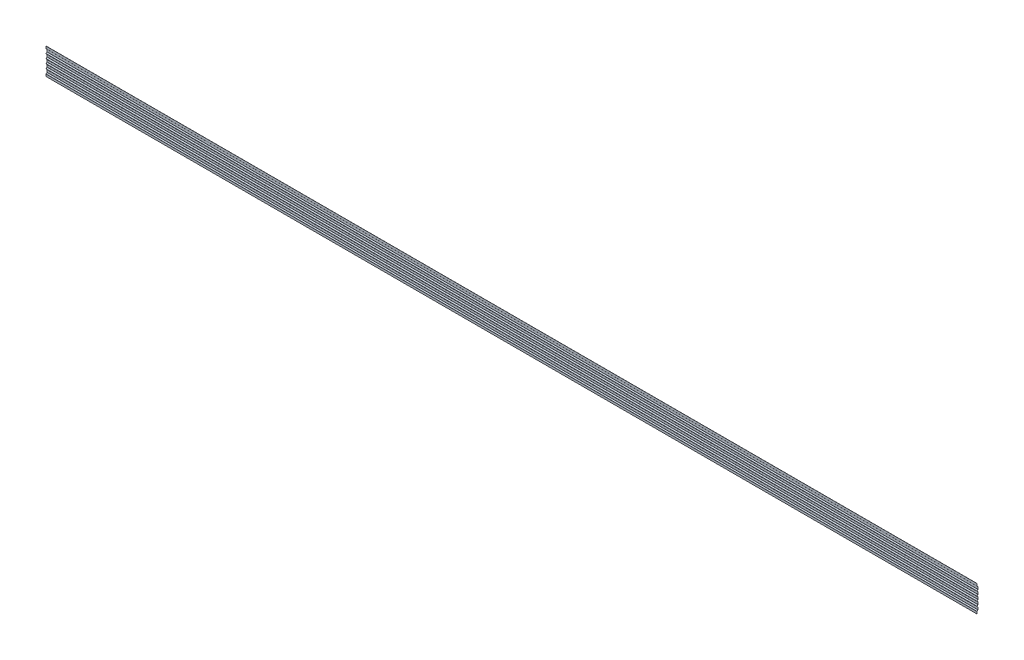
ISO-10303-21;
HEADER;
FILE_DESCRIPTION(('STEP AP214'),'2;1');
FILE_NAME('part.step','',(''),(''),'','','');
FILE_SCHEMA(('AUTOMOTIVE_DESIGN { 1 0 10303 214 1 1 1 1 }'));
ENDSEC;
DATA;
#1=APPLICATION_CONTEXT('core data for automotive mechanical design processes');
#2=APPLICATION_PROTOCOL_DEFINITION('international standard','automotive_design',2000,#1);
#3=PRODUCT_CONTEXT('',#1,'mechanical');
#4=PRODUCT('Part','Part','',(#3));
#5=PRODUCT_RELATED_PRODUCT_CATEGORY('part','',(#4));
#6=PRODUCT_DEFINITION_FORMATION('','',#4);
#7=PRODUCT_DEFINITION_CONTEXT('part definition',#1,'design');
#8=PRODUCT_DEFINITION('design','',#6,#7);
#9=PRODUCT_DEFINITION_SHAPE('','',#8);
#10=(LENGTH_UNIT() NAMED_UNIT(*) SI_UNIT(.MILLI.,.METRE.));
#11=(NAMED_UNIT(*) PLANE_ANGLE_UNIT() SI_UNIT($,.RADIAN.));
#12=(NAMED_UNIT(*) SI_UNIT($,.STERADIAN.) SOLID_ANGLE_UNIT());
#13=UNCERTAINTY_MEASURE_WITH_UNIT(LENGTH_MEASURE(1.E-05),#10,'distance_accuracy_value','');
#14=(GEOMETRIC_REPRESENTATION_CONTEXT(3) GLOBAL_UNCERTAINTY_ASSIGNED_CONTEXT((#13)) GLOBAL_UNIT_ASSIGNED_CONTEXT((#10,
#11,#12)) REPRESENTATION_CONTEXT('',''));
#15=CARTESIAN_POINT('',(0.,0.,0.));
#16=DIRECTION('',(0.,0.,1.));
#17=DIRECTION('',(1.,0.,0.));
#18=AXIS2_PLACEMENT_3D('',#15,#16,#17);
#19=CARTESIAN_POINT('',(4242.5,20.6443650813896,-0.644365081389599));
#20=DIRECTION('',(1.,0.,0.));
#21=DIRECTION('',(0.,0.,-1.));
#22=AXIS2_PLACEMENT_3D('',#19,#20,#21);
#23=PLANE('',#22);
#24=DIRECTION('',(0.,-0.707106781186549,-0.707106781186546));
#25=VECTOR('',#24,1.);
#26=CARTESIAN_POINT('',(4242.5,20.6443650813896,-0.644365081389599));
#27=LINE('',#26,#25);
#28=CARTESIAN_POINT('',(4242.5,20.6443650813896,-0.644365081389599));
#29=VERTEX_POINT('',#28);
#30=CARTESIAN_POINT('',(4242.5,19.7958369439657,-1.49289321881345));
#31=VERTEX_POINT('',#30);
#32=EDGE_CURVE('E11',#29,#31,#27,.T.);
#33=ORIENTED_EDGE('',*,*,#32,.F.);
#34=CARTESIAN_POINT('',(4242.5,19.0887301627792,-2.2));
#35=DIRECTION('',(1.,0.,0.));
#36=DIRECTION('',(0.,0.,-1.));
#37=AXIS2_PLACEMENT_3D('',#34,#35,#36);
#38=CIRCLE('',#37,2.2);
#39=CARTESIAN_POINT('',(4242.5,19.0887301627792,0.));
#40=VERTEX_POINT('',#39);
#41=EDGE_CURVE('E503',#29,#40,#38,.T.);
#42=ORIENTED_EDGE('',*,*,#41,.T.);
#43=DIRECTION('',(0.,0.,1.));
#44=VECTOR('',#43,1.);
#45=CARTESIAN_POINT('',(4242.5,19.0887301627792,-1.2));
#46=LINE('',#45,#44);
#47=CARTESIAN_POINT('',(4242.5,19.0887301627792,-1.2));
#48=VERTEX_POINT('',#47);
#49=EDGE_CURVE('E42',#48,#40,#46,.T.);
#50=ORIENTED_EDGE('',*,*,#49,.F.);
#51=CARTESIAN_POINT('',(4242.5,19.0887301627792,-2.2));
#52=DIRECTION('',(1.,0.,0.));
#53=DIRECTION('',(0.,0.,-1.));
#54=AXIS2_PLACEMENT_3D('',#51,#52,#53);
#55=CIRCLE('',#54,1.);
#56=EDGE_CURVE('E1027',#31,#48,#55,.T.);
#57=ORIENTED_EDGE('',*,*,#56,.F.);
#58=EDGE_LOOP('',(#33,#42,#50,#57));
#59=FACE_BOUND('',#58,.T.);
#60=ADVANCED_FACE('F34',(#59),#23,.T.);
#61=CARTESIAN_POINT('',(4242.5,19.0887301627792,-1.2));
#62=DIRECTION('',(1.,0.,0.));
#63=DIRECTION('',(0.,0.,-1.));
#64=AXIS2_PLACEMENT_3D('',#61,#62,#63);
#65=PLANE('',#64);
#66=DIRECTION('',(0.,-0.707106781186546,0.707106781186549));
#67=VECTOR('',#66,1.);
#68=CARTESIAN_POINT('',(4242.5,20.,0.));
#69=LINE('',#68,#67);
#70=CARTESIAN_POINT('',(4242.5,28.5071067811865,-8.50710678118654));
#71=VERTEX_POINT('',#70);
#72=EDGE_CURVE('E470',#71,#29,#69,.T.);
#73=ORIENTED_EDGE('',*,*,#72,.T.);
#74=ORIENTED_EDGE('',*,*,#32,.T.);
#75=DIRECTION('',(0.,-0.707106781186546,0.707106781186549));
#76=VECTOR('',#75,1.);
#77=CARTESIAN_POINT('',(4242.5,19.1514718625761,-0.848528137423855));
#78=LINE('',#77,#76);
#79=CARTESIAN_POINT('',(4242.5,27.6585786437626,-9.3556349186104));
#80=VERTEX_POINT('',#79);
#81=EDGE_CURVE('E473',#80,#31,#78,.T.);
#82=ORIENTED_EDGE('',*,*,#81,.F.);
#83=DIRECTION('',(0.,0.707106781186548,0.707106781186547));
#84=VECTOR('',#83,1.);
#85=CARTESIAN_POINT('',(4242.5,27.6585786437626,-9.3556349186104));
#86=LINE('',#85,#84);
#87=EDGE_CURVE('E466',#80,#71,#86,.T.);
#88=ORIENTED_EDGE('',*,*,#87,.T.);
#89=EDGE_LOOP('',(#73,#74,#82,#88));
#90=FACE_BOUND('',#89,.T.);
#91=ADVANCED_FACE('F468',(#90),#65,.T.);
#92=CARTESIAN_POINT('',(-4242.5,19.0887301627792,0.));
#93=DIRECTION('',(-1.,0.,0.));
#94=DIRECTION('',(0.,0.,1.));
#95=AXIS2_PLACEMENT_3D('',#92,#93,#94);
#96=PLANE('',#95);
#97=DIRECTION('',(0.,0.,-1.));
#98=VECTOR('',#97,1.);
#99=CARTESIAN_POINT('',(-4242.5,19.0887301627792,0.));
#100=LINE('',#99,#98);
#101=CARTESIAN_POINT('',(-4242.5,19.0887301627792,0.));
#102=VERTEX_POINT('',#101);
#103=CARTESIAN_POINT('',(-4242.5,19.0887301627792,-1.2));
#104=VERTEX_POINT('',#103);
#105=EDGE_CURVE('E265',#102,#104,#100,.T.);
#106=ORIENTED_EDGE('',*,*,#105,.F.);
#107=CARTESIAN_POINT('',(-4242.5,19.0887301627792,-2.2));
#108=DIRECTION('',(1.,0.,0.));
#109=DIRECTION('',(0.,0.,-1.));
#110=AXIS2_PLACEMENT_3D('',#107,#108,#109);
#111=CIRCLE('',#110,2.2);
#112=CARTESIAN_POINT('',(-4242.5,20.6443650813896,-0.644365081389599));
#113=VERTEX_POINT('',#112);
#114=EDGE_CURVE('E705',#113,#102,#111,.T.);
#115=ORIENTED_EDGE('',*,*,#114,.F.);
#116=DIRECTION('',(0.,0.707106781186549,0.707106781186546));
#117=VECTOR('',#116,1.);
#118=CARTESIAN_POINT('',(-4242.5,19.7958369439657,-1.49289321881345));
#119=LINE('',#118,#117);
#120=CARTESIAN_POINT('',(-4242.5,19.7958369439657,-1.49289321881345));
#121=VERTEX_POINT('',#120);
#122=EDGE_CURVE('E258',#121,#113,#119,.T.);
#123=ORIENTED_EDGE('',*,*,#122,.F.);
#124=CARTESIAN_POINT('',(-4242.5,19.0887301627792,-2.2));
#125=DIRECTION('',(1.,0.,0.));
#126=DIRECTION('',(0.,0.,-1.));
#127=AXIS2_PLACEMENT_3D('',#124,#125,#126);
#128=CIRCLE('',#127,1.);
#129=EDGE_CURVE('E518',#121,#104,#128,.T.);
#130=ORIENTED_EDGE('',*,*,#129,.T.);
#131=EDGE_LOOP('',(#106,#115,#123,#130));
#132=FACE_BOUND('',#131,.T.);
#133=ADVANCED_FACE('F1032',(#132),#96,.T.);
#134=CARTESIAN_POINT('',(-4242.5,19.7958369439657,-1.49289321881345));
#135=DIRECTION('',(-1.,0.,0.));
#136=DIRECTION('',(0.,0.,1.));
#137=AXIS2_PLACEMENT_3D('',#134,#135,#136);
#138=PLANE('',#137);
#139=DIRECTION('',(0.,-1.,0.));
#140=VECTOR('',#139,1.);
#141=CARTESIAN_POINT('',(-4242.5,20.,0.));
#142=LINE('',#141,#140);
#143=CARTESIAN_POINT('',(-4242.5,0.,0.));
#144=VERTEX_POINT('',#143);
#145=EDGE_CURVE('E509',#102,#144,#142,.T.);
#146=ORIENTED_EDGE('',*,*,#145,.F.);
#147=ORIENTED_EDGE('',*,*,#105,.T.);
#148=DIRECTION('',(0.,1.,0.));
#149=VECTOR('',#148,1.);
#150=CARTESIAN_POINT('',(-4242.5,20.,-1.2));
#151=LINE('',#150,#149);
#152=CARTESIAN_POINT('',(-4242.5,0.,-1.2));
#153=VERTEX_POINT('',#152);
#154=EDGE_CURVE('E515',#104,#153,#151,.F.);
#155=ORIENTED_EDGE('',*,*,#154,.T.);
#156=DIRECTION('',(0.,0.,1.));
#157=VECTOR('',#156,1.);
#158=CARTESIAN_POINT('',(-4242.5,0.,-1.2));
#159=LINE('',#158,#157);
#160=EDGE_CURVE('E512',#153,#144,#159,.T.);
#161=ORIENTED_EDGE('',*,*,#160,.T.);
#162=EDGE_LOOP('',(#146,#147,#155,#161));
#163=FACE_BOUND('',#162,.T.);
#164=ADVANCED_FACE('F1018',(#163),#138,.T.);
#165=CARTESIAN_POINT('',(4242.5,29.2142135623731,-8.8));
#166=DIRECTION('',(1.,0.,0.));
#167=DIRECTION('',(0.,0.,-1.));
#168=AXIS2_PLACEMENT_3D('',#165,#166,#167);
#169=PLANE('',#168);
#170=DIRECTION('',(0.,0.,-1.));
#171=VECTOR('',#170,1.);
#172=CARTESIAN_POINT('',(4242.5,29.2142135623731,-8.8));
#173=LINE('',#172,#171);
#174=CARTESIAN_POINT('',(4242.5,29.2142135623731,-8.8));
#175=VERTEX_POINT('',#174);
#176=CARTESIAN_POINT('',(4242.5,29.2142135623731,-10.));
#177=VERTEX_POINT('',#176);
#178=EDGE_CURVE('E478',#175,#177,#173,.T.);
#179=ORIENTED_EDGE('',*,*,#178,.F.);
#180=CARTESIAN_POINT('',(4242.5,29.2142135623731,-7.8));
#181=DIRECTION('',(-1.,0.,0.));
#182=DIRECTION('',(0.,0.,1.));
#183=AXIS2_PLACEMENT_3D('',#180,#181,#182);
#184=CIRCLE('',#183,1.);
#185=EDGE_CURVE('E482',#175,#71,#184,.T.);
#186=ORIENTED_EDGE('',*,*,#185,.T.);
#187=ORIENTED_EDGE('',*,*,#87,.F.);
#188=CARTESIAN_POINT('',(4242.5,29.2142135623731,-7.8));
#189=DIRECTION('',(1.,0.,0.));
#190=DIRECTION('',(0.,0.,-1.));
#191=AXIS2_PLACEMENT_3D('',#188,#189,#190);
#192=CIRCLE('',#191,2.2);
#193=EDGE_CURVE('E1039',#177,#80,#192,.F.);
#194=ORIENTED_EDGE('',*,*,#193,.F.);
#195=EDGE_LOOP('',(#179,#186,#187,#194));
#196=FACE_BOUND('',#195,.T.);
#197=ADVANCED_FACE('F484',(#196),#169,.T.);
#198=CARTESIAN_POINT('',(4242.5,27.6585786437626,-9.3556349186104));
#199=DIRECTION('',(1.,0.,0.));
#200=DIRECTION('',(0.,0.,-1.));
#201=AXIS2_PLACEMENT_3D('',#198,#199,#200);
#202=PLANE('',#201);
#203=DIRECTION('',(0.,-1.,0.));
#204=VECTOR('',#203,1.);
#205=CARTESIAN_POINT('',(4242.5,28.8,-8.8));
#206=LINE('',#205,#204);
#207=CARTESIAN_POINT('',(4242.5,49.4357864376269,-8.8));
#208=VERTEX_POINT('',#207);
#209=EDGE_CURVE('E488',#208,#175,#206,.T.);
#210=ORIENTED_EDGE('',*,*,#209,.T.);
#211=ORIENTED_EDGE('',*,*,#178,.T.);
#212=DIRECTION('',(0.,1.,0.));
#213=VECTOR('',#212,1.);
#214=CARTESIAN_POINT('',(4242.5,28.8,-10.));
#215=LINE('',#214,#213);
#216=CARTESIAN_POINT('',(4242.5,49.4357864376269,-10.));
#217=VERTEX_POINT('',#216);
#218=EDGE_CURVE('E1046',#217,#177,#215,.F.);
#219=ORIENTED_EDGE('',*,*,#218,.F.);
#220=DIRECTION('',(0.,0.,1.));
#221=VECTOR('',#220,1.);
#222=CARTESIAN_POINT('',(4242.5,49.4357864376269,-10.));
#223=LINE('',#222,#221);
#224=EDGE_CURVE('E1007',#217,#208,#223,.T.);
#225=ORIENTED_EDGE('',*,*,#224,.T.);
#226=EDGE_LOOP('',(#210,#211,#219,#225));
#227=FACE_BOUND('',#226,.T.);
#228=ADVANCED_FACE('F1222',(#227),#202,.T.);
#229=CARTESIAN_POINT('',(-4242.5,28.5071067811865,-8.50710678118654));
#230=DIRECTION('',(-1.,0.,0.));
#231=DIRECTION('',(0.,0.,1.));
#232=AXIS2_PLACEMENT_3D('',#229,#230,#231);
#233=PLANE('',#232);
#234=DIRECTION('',(0.,-0.707106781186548,-0.707106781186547));
#235=VECTOR('',#234,1.);
#236=CARTESIAN_POINT('',(-4242.5,28.5071067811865,-8.50710678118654));
#237=LINE('',#236,#235);
#238=CARTESIAN_POINT('',(-4242.5,28.5071067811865,-8.50710678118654));
#239=VERTEX_POINT('',#238);
#240=CARTESIAN_POINT('',(-4242.5,27.6585786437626,-9.3556349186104));
#241=VERTEX_POINT('',#240);
#242=EDGE_CURVE('E479',#239,#241,#237,.T.);
#243=ORIENTED_EDGE('',*,*,#242,.F.);
#244=CARTESIAN_POINT('',(-4242.5,29.2142135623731,-7.8));
#245=DIRECTION('',(-1.,0.,0.));
#246=DIRECTION('',(0.,0.,1.));
#247=AXIS2_PLACEMENT_3D('',#244,#245,#246);
#248=CIRCLE('',#247,1.);
#249=CARTESIAN_POINT('',(-4242.5,29.2142135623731,-8.8));
#250=VERTEX_POINT('',#249);
#251=EDGE_CURVE('E495',#250,#239,#248,.T.);
#252=ORIENTED_EDGE('',*,*,#251,.F.);
#253=DIRECTION('',(0.,0.,1.));
#254=VECTOR('',#253,1.);
#255=CARTESIAN_POINT('',(-4242.5,29.2142135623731,-10.));
#256=LINE('',#255,#254);
#257=CARTESIAN_POINT('',(-4242.5,29.2142135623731,-10.));
#258=VERTEX_POINT('',#257);
#259=EDGE_CURVE('E1011',#258,#250,#256,.T.);
#260=ORIENTED_EDGE('',*,*,#259,.F.);
#261=CARTESIAN_POINT('',(-4242.5,29.2142135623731,-7.8));
#262=DIRECTION('',(1.,0.,0.));
#263=DIRECTION('',(0.,0.,-1.));
#264=AXIS2_PLACEMENT_3D('',#261,#262,#263);
#265=CIRCLE('',#264,2.2);
#266=EDGE_CURVE('E522',#258,#241,#265,.F.);
#267=ORIENTED_EDGE('',*,*,#266,.T.);
#268=EDGE_LOOP('',(#243,#252,#260,#267));
#269=FACE_BOUND('',#268,.T.);
#270=ADVANCED_FACE('F1229',(#269),#233,.T.);
#271=CARTESIAN_POINT('',(-4242.5,29.2142135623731,-10.));
#272=DIRECTION('',(-1.,0.,0.));
#273=DIRECTION('',(0.,0.,1.));
#274=AXIS2_PLACEMENT_3D('',#271,#272,#273);
#275=PLANE('',#274);
#276=DIRECTION('',(0.,-0.707106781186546,0.707106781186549));
#277=VECTOR('',#276,1.);
#278=CARTESIAN_POINT('',(-4242.5,20.,0.));
#279=LINE('',#278,#277);
#280=EDGE_CURVE('E703',#239,#113,#279,.T.);
#281=ORIENTED_EDGE('',*,*,#280,.F.);
#282=ORIENTED_EDGE('',*,*,#242,.T.);
#283=DIRECTION('',(0.,-0.707106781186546,0.707106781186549));
#284=VECTOR('',#283,1.);
#285=CARTESIAN_POINT('',(-4242.5,19.1514718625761,-0.848528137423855));
#286=LINE('',#285,#284);
#287=EDGE_CURVE('E520',#241,#121,#286,.T.);
#288=ORIENTED_EDGE('',*,*,#287,.T.);
#289=ORIENTED_EDGE('',*,*,#122,.T.);
#290=EDGE_LOOP('',(#281,#282,#288,#289));
#291=FACE_BOUND('',#290,.T.);
#292=ADVANCED_FACE('F1231',(#291),#275,.T.);
#293=CARTESIAN_POINT('',(4242.5,50.1428932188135,-8.50710678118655));
#294=DIRECTION('',(1.,0.,0.));
#295=DIRECTION('',(0.,0.,-1.));
#296=AXIS2_PLACEMENT_3D('',#293,#294,#295);
#297=PLANE('',#296);
#298=DIRECTION('',(0.,0.70710678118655,-0.707106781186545));
#299=VECTOR('',#298,1.);
#300=CARTESIAN_POINT('',(4242.5,50.1428932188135,-8.50710678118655));
#301=LINE('',#300,#299);
#302=CARTESIAN_POINT('',(4242.5,50.1428932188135,-8.50710678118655));
#303=VERTEX_POINT('',#302);
#304=CARTESIAN_POINT('',(4242.5,50.9914213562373,-9.3556349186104));
#305=VERTEX_POINT('',#304);
#306=EDGE_CURVE('E1009',#303,#305,#301,.T.);
#307=ORIENTED_EDGE('',*,*,#306,.F.);
#308=CARTESIAN_POINT('',(4242.5,49.4357864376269,-7.8));
#309=DIRECTION('',(-1.,0.,0.));
#310=DIRECTION('',(0.,0.,1.));
#311=AXIS2_PLACEMENT_3D('',#308,#309,#310);
#312=CIRCLE('',#311,1.);
#313=EDGE_CURVE('E1217',#303,#208,#312,.T.);
#314=ORIENTED_EDGE('',*,*,#313,.T.);
#315=ORIENTED_EDGE('',*,*,#224,.F.);
#316=CARTESIAN_POINT('',(4242.5,49.4357864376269,-7.8));
#317=DIRECTION('',(1.,0.,0.));
#318=DIRECTION('',(0.,0.,-1.));
#319=AXIS2_PLACEMENT_3D('',#316,#317,#318);
#320=CIRCLE('',#319,2.2);
#321=EDGE_CURVE('E1049',#305,#217,#320,.F.);
#322=ORIENTED_EDGE('',*,*,#321,.F.);
#323=EDGE_LOOP('',(#307,#314,#315,#322));
#324=FACE_BOUND('',#323,.T.);
#325=ADVANCED_FACE('F1244',(#324),#297,.T.);
#326=CARTESIAN_POINT('',(4242.5,49.4357864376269,-10.));
#327=DIRECTION('',(1.,0.,0.));
#328=DIRECTION('',(0.,0.,-1.));
#329=AXIS2_PLACEMENT_3D('',#326,#327,#328);
#330=PLANE('',#329);
#331=DIRECTION('',(0.,-0.707106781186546,-0.707106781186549));
#332=VECTOR('',#331,1.);
#333=CARTESIAN_POINT('',(4242.5,49.85,-8.8));
#334=LINE('',#333,#332);
#335=CARTESIAN_POINT('',(4242.5,58.4443650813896,-0.20563491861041));
#336=VERTEX_POINT('',#335);
#337=EDGE_CURVE('E1214',#336,#303,#334,.T.);
#338=ORIENTED_EDGE('',*,*,#337,.T.);
#339=ORIENTED_EDGE('',*,*,#306,.T.);
#340=DIRECTION('',(0.,-0.707106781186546,-0.707106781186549));
#341=VECTOR('',#340,1.);
#342=CARTESIAN_POINT('',(4242.5,50.6985281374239,-9.64852813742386));
#343=LINE('',#342,#341);
#344=CARTESIAN_POINT('',(4242.5,59.2928932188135,-1.05416305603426));
#345=VERTEX_POINT('',#344);
#346=EDGE_CURVE('E1052',#345,#305,#343,.T.);
#347=ORIENTED_EDGE('',*,*,#346,.F.);
#348=DIRECTION('',(0.,-0.707106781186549,0.707106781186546));
#349=VECTOR('',#348,1.);
#350=CARTESIAN_POINT('',(4242.5,59.2928932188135,-1.05416305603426));
#351=LINE('',#350,#349);
#352=EDGE_CURVE('E999',#345,#336,#351,.T.);
#353=ORIENTED_EDGE('',*,*,#352,.T.);
#354=EDGE_LOOP('',(#338,#339,#347,#353));
#355=FACE_BOUND('',#354,.T.);
#356=ADVANCED_FACE('F1251',(#355),#330,.T.);
#357=CARTESIAN_POINT('',(-4242.5,49.4357864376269,-8.8));
#358=DIRECTION('',(-1.,0.,0.));
#359=DIRECTION('',(0.,0.,1.));
#360=AXIS2_PLACEMENT_3D('',#357,#358,#359);
#361=PLANE('',#360);
#362=DIRECTION('',(0.,0.,-1.));
#363=VECTOR('',#362,1.);
#364=CARTESIAN_POINT('',(-4242.5,49.4357864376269,-8.8));
#365=LINE('',#364,#363);
#366=CARTESIAN_POINT('',(-4242.5,49.4357864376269,-8.8));
#367=VERTEX_POINT('',#366);
#368=CARTESIAN_POINT('',(-4242.5,49.4357864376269,-10.));
#369=VERTEX_POINT('',#368);
#370=EDGE_CURVE('E1005',#367,#369,#365,.T.);
#371=ORIENTED_EDGE('',*,*,#370,.F.);
#372=CARTESIAN_POINT('',(-4242.5,49.4357864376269,-7.8));
#373=DIRECTION('',(-1.,0.,0.));
#374=DIRECTION('',(0.,0.,1.));
#375=AXIS2_PLACEMENT_3D('',#372,#373,#374);
#376=CIRCLE('',#375,1.);
#377=CARTESIAN_POINT('',(-4242.5,50.1428932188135,-8.50710678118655));
#378=VERTEX_POINT('',#377);
#379=EDGE_CURVE('E696',#378,#367,#376,.T.);
#380=ORIENTED_EDGE('',*,*,#379,.F.);
#381=DIRECTION('',(0.,-0.70710678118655,0.707106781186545));
#382=VECTOR('',#381,1.);
#383=CARTESIAN_POINT('',(-4242.5,50.9914213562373,-9.3556349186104));
#384=LINE('',#383,#382);
#385=CARTESIAN_POINT('',(-4242.5,50.9914213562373,-9.3556349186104));
#386=VERTEX_POINT('',#385);
#387=EDGE_CURVE('E1003',#386,#378,#384,.T.);
#388=ORIENTED_EDGE('',*,*,#387,.F.);
#389=CARTESIAN_POINT('',(-4242.5,49.4357864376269,-7.8));
#390=DIRECTION('',(1.,0.,0.));
#391=DIRECTION('',(0.,0.,-1.));
#392=AXIS2_PLACEMENT_3D('',#389,#390,#391);
#393=CIRCLE('',#392,2.2);
#394=EDGE_CURVE('E528',#386,#369,#393,.F.);
#395=ORIENTED_EDGE('',*,*,#394,.T.);
#396=EDGE_LOOP('',(#371,#380,#388,#395));
#397=FACE_BOUND('',#396,.T.);
#398=ADVANCED_FACE('F1580',(#397),#361,.T.);
#399=CARTESIAN_POINT('',(-4242.5,50.9914213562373,-9.3556349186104));
#400=DIRECTION('',(-1.,0.,0.));
#401=DIRECTION('',(0.,0.,1.));
#402=AXIS2_PLACEMENT_3D('',#399,#400,#401);
#403=PLANE('',#402);
#404=DIRECTION('',(0.,-1.,0.));
#405=VECTOR('',#404,1.);
#406=CARTESIAN_POINT('',(-4242.5,28.8,-8.8));
#407=LINE('',#406,#405);
#408=EDGE_CURVE('E699',#367,#250,#407,.T.);
#409=ORIENTED_EDGE('',*,*,#408,.F.);
#410=ORIENTED_EDGE('',*,*,#370,.T.);
#411=DIRECTION('',(0.,1.,0.));
#412=VECTOR('',#411,1.);
#413=CARTESIAN_POINT('',(-4242.5,28.8,-10.));
#414=LINE('',#413,#412);
#415=EDGE_CURVE('E525',#369,#258,#414,.F.);
#416=ORIENTED_EDGE('',*,*,#415,.T.);
#417=ORIENTED_EDGE('',*,*,#259,.T.);
#418=EDGE_LOOP('',(#409,#410,#416,#417));
#419=FACE_BOUND('',#418,.T.);
#420=ADVANCED_FACE('F1578',(#419),#403,.T.);
#421=CARTESIAN_POINT('',(4242.5,61.5556349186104,-0.205634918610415));
#422=DIRECTION('',(1.,0.,0.));
#423=DIRECTION('',(0.,0.,-1.));
#424=AXIS2_PLACEMENT_3D('',#421,#422,#423);
#425=PLANE('',#424);
#426=DIRECTION('',(0.,-0.70710678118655,-0.707106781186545));
#427=VECTOR('',#426,1.);
#428=CARTESIAN_POINT('',(4242.5,61.5556349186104,-0.205634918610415));
#429=LINE('',#428,#427);
#430=CARTESIAN_POINT('',(4242.5,61.5556349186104,-0.205634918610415));
#431=VERTEX_POINT('',#430);
#432=CARTESIAN_POINT('',(4242.5,60.7071067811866,-1.05416305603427));
#433=VERTEX_POINT('',#432);
#434=EDGE_CURVE('E1001',#431,#433,#429,.T.);
#435=ORIENTED_EDGE('',*,*,#434,.F.);
#436=CARTESIAN_POINT('',(4242.5,60.,-1.76126983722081));
#437=DIRECTION('',(1.,0.,0.));
#438=DIRECTION('',(0.,0.,-1.));
#439=AXIS2_PLACEMENT_3D('',#436,#437,#438);
#440=CIRCLE('',#439,2.2);
#441=EDGE_CURVE('E1211',#431,#336,#440,.T.);
#442=ORIENTED_EDGE('',*,*,#441,.T.);
#443=ORIENTED_EDGE('',*,*,#352,.F.);
#444=CARTESIAN_POINT('',(4242.5,60.,-1.76126983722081));
#445=DIRECTION('',(1.,0.,0.));
#446=DIRECTION('',(0.,0.,-1.));
#447=AXIS2_PLACEMENT_3D('',#444,#445,#446);
#448=CIRCLE('',#447,1.);
#449=EDGE_CURVE('E1055',#433,#345,#448,.T.);
#450=ORIENTED_EDGE('',*,*,#449,.F.);
#451=EDGE_LOOP('',(#435,#442,#443,#450));
#452=FACE_BOUND('',#451,.T.);
#453=ADVANCED_FACE('F1258',(#452),#425,.T.);
#454=CARTESIAN_POINT('',(4242.5,59.2928932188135,-1.05416305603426));
#455=DIRECTION('',(1.,0.,0.));
#456=DIRECTION('',(0.,0.,-1.));
#457=AXIS2_PLACEMENT_3D('',#454,#455,#456);
#458=PLANE('',#457);
#459=DIRECTION('',(0.,-0.707106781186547,0.707106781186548));
#460=VECTOR('',#459,1.);
#461=CARTESIAN_POINT('',(4242.5,60.,1.35));
#462=LINE('',#461,#460);
#463=CARTESIAN_POINT('',(4242.5,69.8571067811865,-8.50710678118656));
#464=VERTEX_POINT('',#463);
#465=EDGE_CURVE('E1208',#464,#431,#462,.T.);
#466=ORIENTED_EDGE('',*,*,#465,.T.);
#467=ORIENTED_EDGE('',*,*,#434,.T.);
#468=DIRECTION('',(0.,-0.707106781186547,0.707106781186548));
#469=VECTOR('',#468,1.);
#470=CARTESIAN_POINT('',(4242.5,59.1514718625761,0.501471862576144));
#471=LINE('',#470,#469);
#472=CARTESIAN_POINT('',(4242.5,69.0085786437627,-9.35563491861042));
#473=VERTEX_POINT('',#472);
#474=EDGE_CURVE('E1058',#473,#433,#471,.T.);
#475=ORIENTED_EDGE('',*,*,#474,.F.);
#476=DIRECTION('',(0.,0.707106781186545,0.70710678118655));
#477=VECTOR('',#476,1.);
#478=CARTESIAN_POINT('',(4242.5,69.0085786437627,-9.35563491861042));
#479=LINE('',#478,#477);
#480=EDGE_CURVE('E991',#473,#464,#479,.T.);
#481=ORIENTED_EDGE('',*,*,#480,.T.);
#482=EDGE_LOOP('',(#466,#467,#475,#481));
#483=FACE_BOUND('',#482,.T.);
#484=ADVANCED_FACE('F1265',(#483),#458,.T.);
#485=CARTESIAN_POINT('',(-4242.5,58.4443650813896,-0.20563491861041));
#486=DIRECTION('',(-1.,0.,0.));
#487=DIRECTION('',(0.,0.,1.));
#488=AXIS2_PLACEMENT_3D('',#485,#486,#487);
#489=PLANE('',#488);
#490=DIRECTION('',(0.,0.707106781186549,-0.707106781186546));
#491=VECTOR('',#490,1.);
#492=CARTESIAN_POINT('',(-4242.5,58.4443650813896,-0.20563491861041));
#493=LINE('',#492,#491);
#494=CARTESIAN_POINT('',(-4242.5,58.4443650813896,-0.20563491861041));
#495=VERTEX_POINT('',#494);
#496=CARTESIAN_POINT('',(-4242.5,59.2928932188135,-1.05416305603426));
#497=VERTEX_POINT('',#496);
#498=EDGE_CURVE('E997',#495,#497,#493,.T.);
#499=ORIENTED_EDGE('',*,*,#498,.F.);
#500=CARTESIAN_POINT('',(-4242.5,60.,-1.76126983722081));
#501=DIRECTION('',(1.,0.,0.));
#502=DIRECTION('',(0.,0.,-1.));
#503=AXIS2_PLACEMENT_3D('',#500,#501,#502);
#504=CIRCLE('',#503,2.2);
#505=CARTESIAN_POINT('',(-4242.5,61.5556349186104,-0.205634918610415));
#506=VERTEX_POINT('',#505);
#507=EDGE_CURVE('E690',#506,#495,#504,.T.);
#508=ORIENTED_EDGE('',*,*,#507,.F.);
#509=DIRECTION('',(0.,0.70710678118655,0.707106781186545));
#510=VECTOR('',#509,1.);
#511=CARTESIAN_POINT('',(-4242.5,60.7071067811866,-1.05416305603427));
#512=LINE('',#511,#510);
#513=CARTESIAN_POINT('',(-4242.5,60.7071067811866,-1.05416305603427));
#514=VERTEX_POINT('',#513);
#515=EDGE_CURVE('E995',#514,#506,#512,.T.);
#516=ORIENTED_EDGE('',*,*,#515,.F.);
#517=CARTESIAN_POINT('',(-4242.5,60.,-1.76126983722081));
#518=DIRECTION('',(1.,0.,0.));
#519=DIRECTION('',(0.,0.,-1.));
#520=AXIS2_PLACEMENT_3D('',#517,#518,#519);
#521=CIRCLE('',#520,1.);
#522=EDGE_CURVE('E534',#514,#497,#521,.T.);
#523=ORIENTED_EDGE('',*,*,#522,.T.);
#524=EDGE_LOOP('',(#499,#508,#516,#523));
#525=FACE_BOUND('',#524,.T.);
#526=ADVANCED_FACE('F1584',(#525),#489,.T.);
#527=CARTESIAN_POINT('',(-4242.5,60.7071067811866,-1.05416305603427));
#528=DIRECTION('',(-1.,0.,0.));
#529=DIRECTION('',(0.,0.,1.));
#530=AXIS2_PLACEMENT_3D('',#527,#528,#529);
#531=PLANE('',#530);
#532=DIRECTION('',(0.,-0.707106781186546,-0.707106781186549));
#533=VECTOR('',#532,1.);
#534=CARTESIAN_POINT('',(-4242.5,49.85,-8.8));
#535=LINE('',#534,#533);
#536=EDGE_CURVE('E693',#495,#378,#535,.T.);
#537=ORIENTED_EDGE('',*,*,#536,.F.);
#538=ORIENTED_EDGE('',*,*,#498,.T.);
#539=DIRECTION('',(0.,-0.707106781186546,-0.707106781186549));
#540=VECTOR('',#539,1.);
#541=CARTESIAN_POINT('',(-4242.5,50.6985281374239,-9.64852813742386));
#542=LINE('',#541,#540);
#543=EDGE_CURVE('E531',#497,#386,#542,.T.);
#544=ORIENTED_EDGE('',*,*,#543,.T.);
#545=ORIENTED_EDGE('',*,*,#387,.T.);
#546=EDGE_LOOP('',(#537,#538,#544,#545));
#547=FACE_BOUND('',#546,.T.);
#548=ADVANCED_FACE('F1582',(#547),#531,.T.);
#549=CARTESIAN_POINT('',(4242.5,70.5642135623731,-8.8));
#550=DIRECTION('',(1.,0.,0.));
#551=DIRECTION('',(0.,0.,-1.));
#552=AXIS2_PLACEMENT_3D('',#549,#550,#551);
#553=PLANE('',#552);
#554=DIRECTION('',(0.,0.,-1.));
#555=VECTOR('',#554,1.);
#556=CARTESIAN_POINT('',(4242.5,70.5642135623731,-8.8));
#557=LINE('',#556,#555);
#558=CARTESIAN_POINT('',(4242.5,70.5642135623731,-8.8));
#559=VERTEX_POINT('',#558);
#560=CARTESIAN_POINT('',(4242.5,70.5642135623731,-10.));
#561=VERTEX_POINT('',#560);
#562=EDGE_CURVE('E993',#559,#561,#557,.T.);
#563=ORIENTED_EDGE('',*,*,#562,.F.);
#564=CARTESIAN_POINT('',(4242.5,70.5642135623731,-7.80000000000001));
#565=DIRECTION('',(-1.,0.,0.));
#566=DIRECTION('',(0.,0.,1.));
#567=AXIS2_PLACEMENT_3D('',#564,#565,#566);
#568=CIRCLE('',#567,1.);
#569=EDGE_CURVE('E1205',#559,#464,#568,.T.);
#570=ORIENTED_EDGE('',*,*,#569,.T.);
#571=ORIENTED_EDGE('',*,*,#480,.F.);
#572=CARTESIAN_POINT('',(4242.5,70.5642135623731,-7.80000000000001));
#573=DIRECTION('',(1.,0.,0.));
#574=DIRECTION('',(0.,0.,-1.));
#575=AXIS2_PLACEMENT_3D('',#572,#573,#574);
#576=CIRCLE('',#575,2.2);
#577=EDGE_CURVE('E1061',#561,#473,#576,.F.);
#578=ORIENTED_EDGE('',*,*,#577,.F.);
#579=EDGE_LOOP('',(#563,#570,#571,#578));
#580=FACE_BOUND('',#579,.T.);
#581=ADVANCED_FACE('F1272',(#580),#553,.T.);
#582=CARTESIAN_POINT('',(4242.5,69.0085786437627,-9.35563491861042));
#583=DIRECTION('',(1.,0.,0.));
#584=DIRECTION('',(0.,0.,-1.));
#585=AXIS2_PLACEMENT_3D('',#582,#583,#584);
#586=PLANE('',#585);
#587=DIRECTION('',(0.,-1.,0.));
#588=VECTOR('',#587,1.);
#589=CARTESIAN_POINT('',(4242.5,70.15,-8.8));
#590=LINE('',#589,#588);
#591=CARTESIAN_POINT('',(4242.5,89.4357864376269,-8.8));
#592=VERTEX_POINT('',#591);
#593=EDGE_CURVE('E1202',#592,#559,#590,.T.);
#594=ORIENTED_EDGE('',*,*,#593,.T.);
#595=ORIENTED_EDGE('',*,*,#562,.T.);
#596=DIRECTION('',(0.,-1.,0.));
#597=VECTOR('',#596,1.);
#598=CARTESIAN_POINT('',(4242.5,70.15,-10.));
#599=LINE('',#598,#597);
#600=CARTESIAN_POINT('',(4242.5,89.4357864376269,-10.));
#601=VERTEX_POINT('',#600);
#602=EDGE_CURVE('E1064',#601,#561,#599,.T.);
#603=ORIENTED_EDGE('',*,*,#602,.F.);
#604=DIRECTION('',(0.,0.,1.));
#605=VECTOR('',#604,1.);
#606=CARTESIAN_POINT('',(4242.5,89.4357864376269,-10.));
#607=LINE('',#606,#605);
#608=EDGE_CURVE('E983',#601,#592,#607,.T.);
#609=ORIENTED_EDGE('',*,*,#608,.T.);
#610=EDGE_LOOP('',(#594,#595,#603,#609));
#611=FACE_BOUND('',#610,.T.);
#612=ADVANCED_FACE('F1279',(#611),#586,.T.);
#613=CARTESIAN_POINT('',(-4242.5,69.8571067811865,-8.50710678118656));
#614=DIRECTION('',(-1.,0.,0.));
#615=DIRECTION('',(0.,0.,1.));
#616=AXIS2_PLACEMENT_3D('',#613,#614,#615);
#617=PLANE('',#616);
#618=DIRECTION('',(0.,-0.707106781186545,-0.70710678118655));
#619=VECTOR('',#618,1.);
#620=CARTESIAN_POINT('',(-4242.5,69.8571067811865,-8.50710678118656));
#621=LINE('',#620,#619);
#622=CARTESIAN_POINT('',(-4242.5,69.8571067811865,-8.50710678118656));
#623=VERTEX_POINT('',#622);
#624=CARTESIAN_POINT('',(-4242.5,69.0085786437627,-9.35563491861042));
#625=VERTEX_POINT('',#624);
#626=EDGE_CURVE('E989',#623,#625,#621,.T.);
#627=ORIENTED_EDGE('',*,*,#626,.F.);
#628=CARTESIAN_POINT('',(-4242.5,70.5642135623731,-7.80000000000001));
#629=DIRECTION('',(-1.,0.,0.));
#630=DIRECTION('',(0.,0.,1.));
#631=AXIS2_PLACEMENT_3D('',#628,#629,#630);
#632=CIRCLE('',#631,1.);
#633=CARTESIAN_POINT('',(-4242.5,70.5642135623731,-8.8));
#634=VERTEX_POINT('',#633);
#635=EDGE_CURVE('E684',#634,#623,#632,.T.);
#636=ORIENTED_EDGE('',*,*,#635,.F.);
#637=DIRECTION('',(0.,0.,1.));
#638=VECTOR('',#637,1.);
#639=CARTESIAN_POINT('',(-4242.5,70.5642135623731,-10.));
#640=LINE('',#639,#638);
#641=CARTESIAN_POINT('',(-4242.5,70.5642135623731,-10.));
#642=VERTEX_POINT('',#641);
#643=EDGE_CURVE('E987',#642,#634,#640,.T.);
#644=ORIENTED_EDGE('',*,*,#643,.F.);
#645=CARTESIAN_POINT('',(-4242.5,70.5642135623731,-7.80000000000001));
#646=DIRECTION('',(1.,0.,0.));
#647=DIRECTION('',(0.,0.,-1.));
#648=AXIS2_PLACEMENT_3D('',#645,#646,#647);
#649=CIRCLE('',#648,2.2);
#650=EDGE_CURVE('E540',#642,#625,#649,.F.);
#651=ORIENTED_EDGE('',*,*,#650,.T.);
#652=EDGE_LOOP('',(#627,#636,#644,#651));
#653=FACE_BOUND('',#652,.T.);
#654=ADVANCED_FACE('F1588',(#653),#617,.T.);
#655=CARTESIAN_POINT('',(-4242.5,70.5642135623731,-10.));
#656=DIRECTION('',(-1.,0.,0.));
#657=DIRECTION('',(0.,0.,1.));
#658=AXIS2_PLACEMENT_3D('',#655,#656,#657);
#659=PLANE('',#658);
#660=DIRECTION('',(0.,-0.707106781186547,0.707106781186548));
#661=VECTOR('',#660,1.);
#662=CARTESIAN_POINT('',(-4242.5,60.,1.35));
#663=LINE('',#662,#661);
#664=EDGE_CURVE('E687',#623,#506,#663,.T.);
#665=ORIENTED_EDGE('',*,*,#664,.F.);
#666=ORIENTED_EDGE('',*,*,#626,.T.);
#667=DIRECTION('',(0.,-0.707106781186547,0.707106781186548));
#668=VECTOR('',#667,1.);
#669=CARTESIAN_POINT('',(-4242.5,59.1514718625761,0.501471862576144));
#670=LINE('',#669,#668);
#671=EDGE_CURVE('E537',#625,#514,#670,.T.);
#672=ORIENTED_EDGE('',*,*,#671,.T.);
#673=ORIENTED_EDGE('',*,*,#515,.T.);
#674=EDGE_LOOP('',(#665,#666,#672,#673));
#675=FACE_BOUND('',#674,.T.);
#676=ADVANCED_FACE('F1586',(#675),#659,.T.);
#677=CARTESIAN_POINT('',(4242.5,90.1428932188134,-8.50710678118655));
#678=DIRECTION('',(1.,0.,0.));
#679=DIRECTION('',(0.,0.,-1.));
#680=AXIS2_PLACEMENT_3D('',#677,#678,#679);
#681=PLANE('',#680);
#682=DIRECTION('',(0.,0.707106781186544,-0.707106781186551));
#683=VECTOR('',#682,1.);
#684=CARTESIAN_POINT('',(4242.5,90.1428932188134,-8.50710678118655));
#685=LINE('',#684,#683);
#686=CARTESIAN_POINT('',(4242.5,90.1428932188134,-8.50710678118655));
#687=VERTEX_POINT('',#686);
#688=CARTESIAN_POINT('',(4242.5,90.9914213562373,-9.35563491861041));
#689=VERTEX_POINT('',#688);
#690=EDGE_CURVE('E985',#687,#689,#685,.T.);
#691=ORIENTED_EDGE('',*,*,#690,.F.);
#692=CARTESIAN_POINT('',(4242.5,89.4357864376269,-7.8));
#693=DIRECTION('',(-1.,0.,0.));
#694=DIRECTION('',(0.,0.,1.));
#695=AXIS2_PLACEMENT_3D('',#692,#693,#694);
#696=CIRCLE('',#695,1.);
#697=EDGE_CURVE('E1199',#687,#592,#696,.T.);
#698=ORIENTED_EDGE('',*,*,#697,.T.);
#699=ORIENTED_EDGE('',*,*,#608,.F.);
#700=CARTESIAN_POINT('',(4242.5,89.4357864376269,-7.8));
#701=DIRECTION('',(1.,0.,0.));
#702=DIRECTION('',(0.,0.,-1.));
#703=AXIS2_PLACEMENT_3D('',#700,#701,#702);
#704=CIRCLE('',#703,2.2);
#705=EDGE_CURVE('E1067',#689,#601,#704,.F.);
#706=ORIENTED_EDGE('',*,*,#705,.F.);
#707=EDGE_LOOP('',(#691,#698,#699,#706));
#708=FACE_BOUND('',#707,.T.);
#709=ADVANCED_FACE('F1286',(#708),#681,.T.);
#710=CARTESIAN_POINT('',(4242.5,89.4357864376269,-10.));
#711=DIRECTION('',(1.,0.,0.));
#712=DIRECTION('',(0.,0.,-1.));
#713=AXIS2_PLACEMENT_3D('',#710,#711,#712);
#714=PLANE('',#713);
#715=DIRECTION('',(0.,-0.707106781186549,-0.707106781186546));
#716=VECTOR('',#715,1.);
#717=CARTESIAN_POINT('',(4242.5,89.85,-8.8));
#718=LINE('',#717,#716);
#719=CARTESIAN_POINT('',(4242.5,98.4443650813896,-0.205634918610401));
#720=VERTEX_POINT('',#719);
#721=EDGE_CURVE('E1196',#720,#687,#718,.T.);
#722=ORIENTED_EDGE('',*,*,#721,.T.);
#723=ORIENTED_EDGE('',*,*,#690,.T.);
#724=DIRECTION('',(0.,-0.707106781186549,-0.707106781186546));
#725=VECTOR('',#724,1.);
#726=CARTESIAN_POINT('',(4242.5,90.6985281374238,-9.64852813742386));
#727=LINE('',#726,#725);
#728=CARTESIAN_POINT('',(4242.5,99.2928932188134,-1.05416305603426));
#729=VERTEX_POINT('',#728);
#730=EDGE_CURVE('E1070',#729,#689,#727,.T.);
#731=ORIENTED_EDGE('',*,*,#730,.F.);
#732=DIRECTION('',(0.,-0.707106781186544,0.707106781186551));
#733=VECTOR('',#732,1.);
#734=CARTESIAN_POINT('',(4242.5,99.2928932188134,-1.05416305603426));
#735=LINE('',#734,#733);
#736=EDGE_CURVE('E975',#729,#720,#735,.T.);
#737=ORIENTED_EDGE('',*,*,#736,.T.);
#738=EDGE_LOOP('',(#722,#723,#731,#737));
#739=FACE_BOUND('',#738,.T.);
#740=ADVANCED_FACE('F1293',(#739),#714,.T.);
#741=CARTESIAN_POINT('',(-4242.5,89.4357864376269,-8.8));
#742=DIRECTION('',(-1.,0.,0.));
#743=DIRECTION('',(0.,0.,1.));
#744=AXIS2_PLACEMENT_3D('',#741,#742,#743);
#745=PLANE('',#744);
#746=DIRECTION('',(0.,0.,-1.));
#747=VECTOR('',#746,1.);
#748=CARTESIAN_POINT('',(-4242.5,89.4357864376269,-8.8));
#749=LINE('',#748,#747);
#750=CARTESIAN_POINT('',(-4242.5,89.4357864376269,-8.8));
#751=VERTEX_POINT('',#750);
#752=CARTESIAN_POINT('',(-4242.5,89.4357864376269,-10.));
#753=VERTEX_POINT('',#752);
#754=EDGE_CURVE('E981',#751,#753,#749,.T.);
#755=ORIENTED_EDGE('',*,*,#754,.F.);
#756=CARTESIAN_POINT('',(-4242.5,89.4357864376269,-7.8));
#757=DIRECTION('',(-1.,0.,0.));
#758=DIRECTION('',(0.,0.,1.));
#759=AXIS2_PLACEMENT_3D('',#756,#757,#758);
#760=CIRCLE('',#759,1.);
#761=CARTESIAN_POINT('',(-4242.5,90.1428932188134,-8.50710678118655));
#762=VERTEX_POINT('',#761);
#763=EDGE_CURVE('E678',#762,#751,#760,.T.);
#764=ORIENTED_EDGE('',*,*,#763,.F.);
#765=DIRECTION('',(0.,-0.707106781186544,0.707106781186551));
#766=VECTOR('',#765,1.);
#767=CARTESIAN_POINT('',(-4242.5,90.9914213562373,-9.35563491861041));
#768=LINE('',#767,#766);
#769=CARTESIAN_POINT('',(-4242.5,90.9914213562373,-9.35563491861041));
#770=VERTEX_POINT('',#769);
#771=EDGE_CURVE('E979',#770,#762,#768,.T.);
#772=ORIENTED_EDGE('',*,*,#771,.F.);
#773=CARTESIAN_POINT('',(-4242.5,89.4357864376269,-7.8));
#774=DIRECTION('',(1.,0.,0.));
#775=DIRECTION('',(0.,0.,-1.));
#776=AXIS2_PLACEMENT_3D('',#773,#774,#775);
#777=CIRCLE('',#776,2.2);
#778=EDGE_CURVE('E546',#770,#753,#777,.F.);
#779=ORIENTED_EDGE('',*,*,#778,.T.);
#780=EDGE_LOOP('',(#755,#764,#772,#779));
#781=FACE_BOUND('',#780,.T.);
#782=ADVANCED_FACE('F1592',(#781),#745,.T.);
#783=CARTESIAN_POINT('',(-4242.5,90.9914213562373,-9.35563491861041));
#784=DIRECTION('',(-1.,0.,0.));
#785=DIRECTION('',(0.,0.,1.));
#786=AXIS2_PLACEMENT_3D('',#783,#784,#785);
#787=PLANE('',#786);
#788=DIRECTION('',(0.,-1.,0.));
#789=VECTOR('',#788,1.);
#790=CARTESIAN_POINT('',(-4242.5,70.15,-8.8));
#791=LINE('',#790,#789);
#792=EDGE_CURVE('E681',#751,#634,#791,.T.);
#793=ORIENTED_EDGE('',*,*,#792,.F.);
#794=ORIENTED_EDGE('',*,*,#754,.T.);
#795=DIRECTION('',(0.,-1.,0.));
#796=VECTOR('',#795,1.);
#797=CARTESIAN_POINT('',(-4242.5,70.15,-10.));
#798=LINE('',#797,#796);
#799=EDGE_CURVE('E543',#753,#642,#798,.T.);
#800=ORIENTED_EDGE('',*,*,#799,.T.);
#801=ORIENTED_EDGE('',*,*,#643,.T.);
#802=EDGE_LOOP('',(#793,#794,#800,#801));
#803=FACE_BOUND('',#802,.T.);
#804=ADVANCED_FACE('F1590',(#803),#787,.T.);
#805=CARTESIAN_POINT('',(4242.5,101.55563491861,-0.205634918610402));
#806=DIRECTION('',(1.,0.,0.));
#807=DIRECTION('',(0.,0.,-1.));
#808=AXIS2_PLACEMENT_3D('',#805,#806,#807);
#809=PLANE('',#808);
#810=DIRECTION('',(0.,-0.70710678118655,-0.707106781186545));
#811=VECTOR('',#810,1.);
#812=CARTESIAN_POINT('',(4242.5,101.55563491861,-0.205634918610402));
#813=LINE('',#812,#811);
#814=CARTESIAN_POINT('',(4242.5,101.55563491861,-0.205634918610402));
#815=VERTEX_POINT('',#814);
#816=CARTESIAN_POINT('',(4242.5,100.707106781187,-1.05416305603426));
#817=VERTEX_POINT('',#816);
#818=EDGE_CURVE('E977',#815,#817,#813,.T.);
#819=ORIENTED_EDGE('',*,*,#818,.F.);
#820=CARTESIAN_POINT('',(4242.5,100.,-1.76126983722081));
#821=DIRECTION('',(1.,0.,0.));
#822=DIRECTION('',(0.,0.,-1.));
#823=AXIS2_PLACEMENT_3D('',#820,#821,#822);
#824=CIRCLE('',#823,2.2);
#825=EDGE_CURVE('E1193',#815,#720,#824,.T.);
#826=ORIENTED_EDGE('',*,*,#825,.T.);
#827=ORIENTED_EDGE('',*,*,#736,.F.);
#828=CARTESIAN_POINT('',(4242.5,100.,-1.76126983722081));
#829=DIRECTION('',(1.,0.,0.));
#830=DIRECTION('',(0.,0.,-1.));
#831=AXIS2_PLACEMENT_3D('',#828,#829,#830);
#832=CIRCLE('',#831,1.);
#833=EDGE_CURVE('E1073',#817,#729,#832,.T.);
#834=ORIENTED_EDGE('',*,*,#833,.F.);
#835=EDGE_LOOP('',(#819,#826,#827,#834));
#836=FACE_BOUND('',#835,.T.);
#837=ADVANCED_FACE('F1300',(#836),#809,.T.);
#838=CARTESIAN_POINT('',(4242.5,99.2928932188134,-1.05416305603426));
#839=DIRECTION('',(1.,0.,0.));
#840=DIRECTION('',(0.,0.,-1.));
#841=AXIS2_PLACEMENT_3D('',#838,#839,#840);
#842=PLANE('',#841);
#843=DIRECTION('',(0.,-0.707106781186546,0.707106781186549));
#844=VECTOR('',#843,1.);
#845=CARTESIAN_POINT('',(4242.5,100.,1.35));
#846=LINE('',#845,#844);
#847=CARTESIAN_POINT('',(4242.5,109.857106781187,-8.50710678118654));
#848=VERTEX_POINT('',#847);
#849=EDGE_CURVE('E1190',#848,#815,#846,.T.);
#850=ORIENTED_EDGE('',*,*,#849,.T.);
#851=ORIENTED_EDGE('',*,*,#818,.T.);
#852=DIRECTION('',(0.,-0.707106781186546,0.707106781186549));
#853=VECTOR('',#852,1.);
#854=CARTESIAN_POINT('',(4242.5,99.1514718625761,0.501471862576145));
#855=LINE('',#854,#853);
#856=CARTESIAN_POINT('',(4242.5,109.008578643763,-9.3556349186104));
#857=VERTEX_POINT('',#856);
#858=EDGE_CURVE('E1076',#857,#817,#855,.T.);
#859=ORIENTED_EDGE('',*,*,#858,.F.);
#860=DIRECTION('',(0.,0.70710678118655,0.707106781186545));
#861=VECTOR('',#860,1.);
#862=CARTESIAN_POINT('',(4242.5,109.008578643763,-9.3556349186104));
#863=LINE('',#862,#861);
#864=EDGE_CURVE('E967',#857,#848,#863,.T.);
#865=ORIENTED_EDGE('',*,*,#864,.T.);
#866=EDGE_LOOP('',(#850,#851,#859,#865));
#867=FACE_BOUND('',#866,.T.);
#868=ADVANCED_FACE('F1307',(#867),#842,.T.);
#869=CARTESIAN_POINT('',(-4242.5,98.4443650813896,-0.205634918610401));
#870=DIRECTION('',(-1.,0.,0.));
#871=DIRECTION('',(0.,0.,1.));
#872=AXIS2_PLACEMENT_3D('',#869,#870,#871);
#873=PLANE('',#872);
#874=DIRECTION('',(0.,0.707106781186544,-0.707106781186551));
#875=VECTOR('',#874,1.);
#876=CARTESIAN_POINT('',(-4242.5,98.4443650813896,-0.205634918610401));
#877=LINE('',#876,#875);
#878=CARTESIAN_POINT('',(-4242.5,98.4443650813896,-0.205634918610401));
#879=VERTEX_POINT('',#878);
#880=CARTESIAN_POINT('',(-4242.5,99.2928932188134,-1.05416305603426));
#881=VERTEX_POINT('',#880);
#882=EDGE_CURVE('E973',#879,#881,#877,.T.);
#883=ORIENTED_EDGE('',*,*,#882,.F.);
#884=CARTESIAN_POINT('',(-4242.5,100.,-1.76126983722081));
#885=DIRECTION('',(1.,0.,0.));
#886=DIRECTION('',(0.,0.,-1.));
#887=AXIS2_PLACEMENT_3D('',#884,#885,#886);
#888=CIRCLE('',#887,2.2);
#889=CARTESIAN_POINT('',(-4242.5,101.55563491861,-0.205634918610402));
#890=VERTEX_POINT('',#889);
#891=EDGE_CURVE('E672',#890,#879,#888,.T.);
#892=ORIENTED_EDGE('',*,*,#891,.F.);
#893=DIRECTION('',(0.,0.70710678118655,0.707106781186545));
#894=VECTOR('',#893,1.);
#895=CARTESIAN_POINT('',(-4242.5,100.707106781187,-1.05416305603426));
#896=LINE('',#895,#894);
#897=CARTESIAN_POINT('',(-4242.5,100.707106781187,-1.05416305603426));
#898=VERTEX_POINT('',#897);
#899=EDGE_CURVE('E971',#898,#890,#896,.T.);
#900=ORIENTED_EDGE('',*,*,#899,.F.);
#901=CARTESIAN_POINT('',(-4242.5,100.,-1.76126983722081));
#902=DIRECTION('',(1.,0.,0.));
#903=DIRECTION('',(0.,0.,-1.));
#904=AXIS2_PLACEMENT_3D('',#901,#902,#903);
#905=CIRCLE('',#904,1.);
#906=EDGE_CURVE('E552',#898,#881,#905,.T.);
#907=ORIENTED_EDGE('',*,*,#906,.T.);
#908=EDGE_LOOP('',(#883,#892,#900,#907));
#909=FACE_BOUND('',#908,.T.);
#910=ADVANCED_FACE('F1596',(#909),#873,.T.);
#911=CARTESIAN_POINT('',(-4242.5,100.707106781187,-1.05416305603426));
#912=DIRECTION('',(-1.,0.,0.));
#913=DIRECTION('',(0.,0.,1.));
#914=AXIS2_PLACEMENT_3D('',#911,#912,#913);
#915=PLANE('',#914);
#916=DIRECTION('',(0.,-0.707106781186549,-0.707106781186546));
#917=VECTOR('',#916,1.);
#918=CARTESIAN_POINT('',(-4242.5,89.85,-8.8));
#919=LINE('',#918,#917);
#920=EDGE_CURVE('E675',#879,#762,#919,.T.);
#921=ORIENTED_EDGE('',*,*,#920,.F.);
#922=ORIENTED_EDGE('',*,*,#882,.T.);
#923=DIRECTION('',(0.,-0.707106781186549,-0.707106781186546));
#924=VECTOR('',#923,1.);
#925=CARTESIAN_POINT('',(-4242.5,90.6985281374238,-9.64852813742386));
#926=LINE('',#925,#924);
#927=EDGE_CURVE('E549',#881,#770,#926,.T.);
#928=ORIENTED_EDGE('',*,*,#927,.T.);
#929=ORIENTED_EDGE('',*,*,#771,.T.);
#930=EDGE_LOOP('',(#921,#922,#928,#929));
#931=FACE_BOUND('',#930,.T.);
#932=ADVANCED_FACE('F1594',(#931),#915,.T.);
#933=CARTESIAN_POINT('',(4242.5,110.564213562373,-8.8));
#934=DIRECTION('',(1.,0.,0.));
#935=DIRECTION('',(0.,0.,-1.));
#936=AXIS2_PLACEMENT_3D('',#933,#934,#935);
#937=PLANE('',#936);
#938=DIRECTION('',(0.,0.,-1.));
#939=VECTOR('',#938,1.);
#940=CARTESIAN_POINT('',(4242.5,110.564213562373,-8.8));
#941=LINE('',#940,#939);
#942=CARTESIAN_POINT('',(4242.5,110.564213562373,-8.8));
#943=VERTEX_POINT('',#942);
#944=CARTESIAN_POINT('',(4242.5,110.564213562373,-10.));
#945=VERTEX_POINT('',#944);
#946=EDGE_CURVE('E969',#943,#945,#941,.T.);
#947=ORIENTED_EDGE('',*,*,#946,.F.);
#948=CARTESIAN_POINT('',(4242.5,110.564213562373,-7.8));
#949=DIRECTION('',(-1.,0.,0.));
#950=DIRECTION('',(0.,0.,1.));
#951=AXIS2_PLACEMENT_3D('',#948,#949,#950);
#952=CIRCLE('',#951,1.);
#953=EDGE_CURVE('E1187',#943,#848,#952,.T.);
#954=ORIENTED_EDGE('',*,*,#953,.T.);
#955=ORIENTED_EDGE('',*,*,#864,.F.);
#956=CARTESIAN_POINT('',(4242.5,110.564213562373,-7.8));
#957=DIRECTION('',(1.,0.,0.));
#958=DIRECTION('',(0.,0.,-1.));
#959=AXIS2_PLACEMENT_3D('',#956,#957,#958);
#960=CIRCLE('',#959,2.2);
#961=EDGE_CURVE('E1079',#945,#857,#960,.F.);
#962=ORIENTED_EDGE('',*,*,#961,.F.);
#963=EDGE_LOOP('',(#947,#954,#955,#962));
#964=FACE_BOUND('',#963,.T.);
#965=ADVANCED_FACE('F1314',(#964),#937,.T.);
#966=CARTESIAN_POINT('',(4242.5,109.008578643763,-9.3556349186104));
#967=DIRECTION('',(1.,0.,0.));
#968=DIRECTION('',(0.,0.,-1.));
#969=AXIS2_PLACEMENT_3D('',#966,#967,#968);
#970=PLANE('',#969);
#971=DIRECTION('',(0.,-1.,0.));
#972=VECTOR('',#971,1.);
#973=CARTESIAN_POINT('',(4242.5,110.15,-8.8));
#974=LINE('',#973,#972);
#975=CARTESIAN_POINT('',(4242.5,129.435786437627,-8.8));
#976=VERTEX_POINT('',#975);
#977=EDGE_CURVE('E1184',#976,#943,#974,.T.);
#978=ORIENTED_EDGE('',*,*,#977,.T.);
#979=ORIENTED_EDGE('',*,*,#946,.T.);
#980=DIRECTION('',(0.,1.,0.));
#981=VECTOR('',#980,1.);
#982=CARTESIAN_POINT('',(4242.5,110.15,-10.));
#983=LINE('',#982,#981);
#984=CARTESIAN_POINT('',(4242.5,129.435786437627,-10.));
#985=VERTEX_POINT('',#984);
#986=EDGE_CURVE('E1082',#985,#945,#983,.F.);
#987=ORIENTED_EDGE('',*,*,#986,.F.);
#988=DIRECTION('',(0.,0.,1.));
#989=VECTOR('',#988,1.);
#990=CARTESIAN_POINT('',(4242.5,129.435786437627,-10.));
#991=LINE('',#990,#989);
#992=EDGE_CURVE('E959',#985,#976,#991,.T.);
#993=ORIENTED_EDGE('',*,*,#992,.T.);
#994=EDGE_LOOP('',(#978,#979,#987,#993));
#995=FACE_BOUND('',#994,.T.);
#996=ADVANCED_FACE('F1321',(#995),#970,.T.);
#997=CARTESIAN_POINT('',(-4242.5,109.857106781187,-8.50710678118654));
#998=DIRECTION('',(-1.,0.,0.));
#999=DIRECTION('',(0.,0.,1.));
#1000=AXIS2_PLACEMENT_3D('',#997,#998,#999);
#1001=PLANE('',#1000);
#1002=DIRECTION('',(0.,-0.70710678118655,-0.707106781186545));
#1003=VECTOR('',#1002,1.);
#1004=CARTESIAN_POINT('',(-4242.5,109.857106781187,-8.50710678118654));
#1005=LINE('',#1004,#1003);
#1006=CARTESIAN_POINT('',(-4242.5,109.857106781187,-8.50710678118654));
#1007=VERTEX_POINT('',#1006);
#1008=CARTESIAN_POINT('',(-4242.5,109.008578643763,-9.3556349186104));
#1009=VERTEX_POINT('',#1008);
#1010=EDGE_CURVE('E965',#1007,#1009,#1005,.T.);
#1011=ORIENTED_EDGE('',*,*,#1010,.F.);
#1012=CARTESIAN_POINT('',(-4242.5,110.564213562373,-7.8));
#1013=DIRECTION('',(-1.,0.,0.));
#1014=DIRECTION('',(0.,0.,1.));
#1015=AXIS2_PLACEMENT_3D('',#1012,#1013,#1014);
#1016=CIRCLE('',#1015,1.);
#1017=CARTESIAN_POINT('',(-4242.5,110.564213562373,-8.8));
#1018=VERTEX_POINT('',#1017);
#1019=EDGE_CURVE('E666',#1018,#1007,#1016,.T.);
#1020=ORIENTED_EDGE('',*,*,#1019,.F.);
#1021=DIRECTION('',(0.,0.,1.));
#1022=VECTOR('',#1021,1.);
#1023=CARTESIAN_POINT('',(-4242.5,110.564213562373,-10.));
#1024=LINE('',#1023,#1022);
#1025=CARTESIAN_POINT('',(-4242.5,110.564213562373,-10.));
#1026=VERTEX_POINT('',#1025);
#1027=EDGE_CURVE('E963',#1026,#1018,#1024,.T.);
#1028=ORIENTED_EDGE('',*,*,#1027,.F.);
#1029=CARTESIAN_POINT('',(-4242.5,110.564213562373,-7.8));
#1030=DIRECTION('',(1.,0.,0.));
#1031=DIRECTION('',(0.,0.,-1.));
#1032=AXIS2_PLACEMENT_3D('',#1029,#1030,#1031);
#1033=CIRCLE('',#1032,2.2);
#1034=EDGE_CURVE('E558',#1026,#1009,#1033,.F.);
#1035=ORIENTED_EDGE('',*,*,#1034,.T.);
#1036=EDGE_LOOP('',(#1011,#1020,#1028,#1035));
#1037=FACE_BOUND('',#1036,.T.);
#1038=ADVANCED_FACE('F1600',(#1037),#1001,.T.);
#1039=CARTESIAN_POINT('',(-4242.5,110.564213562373,-10.));
#1040=DIRECTION('',(-1.,0.,0.));
#1041=DIRECTION('',(0.,0.,1.));
#1042=AXIS2_PLACEMENT_3D('',#1039,#1040,#1041);
#1043=PLANE('',#1042);
#1044=DIRECTION('',(0.,-0.707106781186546,0.707106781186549));
#1045=VECTOR('',#1044,1.);
#1046=CARTESIAN_POINT('',(-4242.5,100.,1.35));
#1047=LINE('',#1046,#1045);
#1048=EDGE_CURVE('E669',#1007,#890,#1047,.T.);
#1049=ORIENTED_EDGE('',*,*,#1048,.F.);
#1050=ORIENTED_EDGE('',*,*,#1010,.T.);
#1051=DIRECTION('',(0.,-0.707106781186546,0.707106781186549));
#1052=VECTOR('',#1051,1.);
#1053=CARTESIAN_POINT('',(-4242.5,99.1514718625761,0.501471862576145));
#1054=LINE('',#1053,#1052);
#1055=EDGE_CURVE('E555',#1009,#898,#1054,.T.);
#1056=ORIENTED_EDGE('',*,*,#1055,.T.);
#1057=ORIENTED_EDGE('',*,*,#899,.T.);
#1058=EDGE_LOOP('',(#1049,#1050,#1056,#1057));
#1059=FACE_BOUND('',#1058,.T.);
#1060=ADVANCED_FACE('F1598',(#1059),#1043,.T.);
#1061=CARTESIAN_POINT('',(4242.5,130.142893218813,-8.50710678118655));
#1062=DIRECTION('',(1.,0.,0.));
#1063=DIRECTION('',(0.,0.,-1.));
#1064=AXIS2_PLACEMENT_3D('',#1061,#1062,#1063);
#1065=PLANE('',#1064);
#1066=DIRECTION('',(0.,0.70710678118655,-0.707106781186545));
#1067=VECTOR('',#1066,1.);
#1068=CARTESIAN_POINT('',(4242.5,130.142893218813,-8.50710678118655));
#1069=LINE('',#1068,#1067);
#1070=CARTESIAN_POINT('',(4242.5,130.142893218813,-8.50710678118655));
#1071=VERTEX_POINT('',#1070);
#1072=CARTESIAN_POINT('',(4242.5,130.991421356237,-9.35563491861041));
#1073=VERTEX_POINT('',#1072);
#1074=EDGE_CURVE('E961',#1071,#1073,#1069,.T.);
#1075=ORIENTED_EDGE('',*,*,#1074,.F.);
#1076=CARTESIAN_POINT('',(4242.5,129.435786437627,-7.8));
#1077=DIRECTION('',(-1.,0.,0.));
#1078=DIRECTION('',(0.,0.,1.));
#1079=AXIS2_PLACEMENT_3D('',#1076,#1077,#1078);
#1080=CIRCLE('',#1079,1.);
#1081=EDGE_CURVE('E1181',#1071,#976,#1080,.T.);
#1082=ORIENTED_EDGE('',*,*,#1081,.T.);
#1083=ORIENTED_EDGE('',*,*,#992,.F.);
#1084=CARTESIAN_POINT('',(4242.5,129.435786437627,-7.8));
#1085=DIRECTION('',(1.,0.,0.));
#1086=DIRECTION('',(0.,0.,-1.));
#1087=AXIS2_PLACEMENT_3D('',#1084,#1085,#1086);
#1088=CIRCLE('',#1087,2.2);
#1089=EDGE_CURVE('E1085',#1073,#985,#1088,.F.);
#1090=ORIENTED_EDGE('',*,*,#1089,.F.);
#1091=EDGE_LOOP('',(#1075,#1082,#1083,#1090));
#1092=FACE_BOUND('',#1091,.T.);
#1093=ADVANCED_FACE('F1328',(#1092),#1065,.T.);
#1094=CARTESIAN_POINT('',(4242.5,129.435786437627,-10.));
#1095=DIRECTION('',(1.,0.,0.));
#1096=DIRECTION('',(0.,0.,-1.));
#1097=AXIS2_PLACEMENT_3D('',#1094,#1095,#1096);
#1098=PLANE('',#1097);
#1099=DIRECTION('',(0.,-0.707106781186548,-0.707106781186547));
#1100=VECTOR('',#1099,1.);
#1101=CARTESIAN_POINT('',(4242.5,129.85,-8.8));
#1102=LINE('',#1101,#1100);
#1103=CARTESIAN_POINT('',(4242.5,138.44436508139,-0.205634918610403));
#1104=VERTEX_POINT('',#1103);
#1105=EDGE_CURVE('E1178',#1104,#1071,#1102,.T.);
#1106=ORIENTED_EDGE('',*,*,#1105,.T.);
#1107=ORIENTED_EDGE('',*,*,#1074,.T.);
#1108=DIRECTION('',(0.,-0.707106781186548,-0.707106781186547));
#1109=VECTOR('',#1108,1.);
#1110=CARTESIAN_POINT('',(4242.5,130.698528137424,-9.64852813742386));
#1111=LINE('',#1110,#1109);
#1112=CARTESIAN_POINT('',(4242.5,139.292893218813,-1.05416305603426));
#1113=VERTEX_POINT('',#1112);
#1114=EDGE_CURVE('E1088',#1113,#1073,#1111,.T.);
#1115=ORIENTED_EDGE('',*,*,#1114,.F.);
#1116=DIRECTION('',(0.,-0.70710678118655,0.707106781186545));
#1117=VECTOR('',#1116,1.);
#1118=CARTESIAN_POINT('',(4242.5,139.292893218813,-1.05416305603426));
#1119=LINE('',#1118,#1117);
#1120=EDGE_CURVE('E951',#1113,#1104,#1119,.T.);
#1121=ORIENTED_EDGE('',*,*,#1120,.T.);
#1122=EDGE_LOOP('',(#1106,#1107,#1115,#1121));
#1123=FACE_BOUND('',#1122,.T.);
#1124=ADVANCED_FACE('F1335',(#1123),#1098,.T.);
#1125=CARTESIAN_POINT('',(-4242.5,129.435786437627,-8.8));
#1126=DIRECTION('',(-1.,0.,0.));
#1127=DIRECTION('',(0.,0.,1.));
#1128=AXIS2_PLACEMENT_3D('',#1125,#1126,#1127);
#1129=PLANE('',#1128);
#1130=DIRECTION('',(0.,0.,-1.));
#1131=VECTOR('',#1130,1.);
#1132=CARTESIAN_POINT('',(-4242.5,129.435786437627,-8.8));
#1133=LINE('',#1132,#1131);
#1134=CARTESIAN_POINT('',(-4242.5,129.435786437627,-8.8));
#1135=VERTEX_POINT('',#1134);
#1136=CARTESIAN_POINT('',(-4242.5,129.435786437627,-10.));
#1137=VERTEX_POINT('',#1136);
#1138=EDGE_CURVE('E957',#1135,#1137,#1133,.T.);
#1139=ORIENTED_EDGE('',*,*,#1138,.F.);
#1140=CARTESIAN_POINT('',(-4242.5,129.435786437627,-7.8));
#1141=DIRECTION('',(-1.,0.,0.));
#1142=DIRECTION('',(0.,0.,1.));
#1143=AXIS2_PLACEMENT_3D('',#1140,#1141,#1142);
#1144=CIRCLE('',#1143,1.);
#1145=CARTESIAN_POINT('',(-4242.5,130.142893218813,-8.50710678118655));
#1146=VERTEX_POINT('',#1145);
#1147=EDGE_CURVE('E660',#1146,#1135,#1144,.T.);
#1148=ORIENTED_EDGE('',*,*,#1147,.F.);
#1149=DIRECTION('',(0.,-0.70710678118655,0.707106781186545));
#1150=VECTOR('',#1149,1.);
#1151=CARTESIAN_POINT('',(-4242.5,130.991421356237,-9.35563491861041));
#1152=LINE('',#1151,#1150);
#1153=CARTESIAN_POINT('',(-4242.5,130.991421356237,-9.35563491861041));
#1154=VERTEX_POINT('',#1153);
#1155=EDGE_CURVE('E955',#1154,#1146,#1152,.T.);
#1156=ORIENTED_EDGE('',*,*,#1155,.F.);
#1157=CARTESIAN_POINT('',(-4242.5,129.435786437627,-7.8));
#1158=DIRECTION('',(1.,0.,0.));
#1159=DIRECTION('',(0.,0.,-1.));
#1160=AXIS2_PLACEMENT_3D('',#1157,#1158,#1159);
#1161=CIRCLE('',#1160,2.2);
#1162=EDGE_CURVE('E564',#1154,#1137,#1161,.F.);
#1163=ORIENTED_EDGE('',*,*,#1162,.T.);
#1164=EDGE_LOOP('',(#1139,#1148,#1156,#1163));
#1165=FACE_BOUND('',#1164,.T.);
#1166=ADVANCED_FACE('F1604',(#1165),#1129,.T.);
#1167=CARTESIAN_POINT('',(-4242.5,130.991421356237,-9.35563491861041));
#1168=DIRECTION('',(-1.,0.,0.));
#1169=DIRECTION('',(0.,0.,1.));
#1170=AXIS2_PLACEMENT_3D('',#1167,#1168,#1169);
#1171=PLANE('',#1170);
#1172=DIRECTION('',(0.,-1.,0.));
#1173=VECTOR('',#1172,1.);
#1174=CARTESIAN_POINT('',(-4242.5,110.15,-8.8));
#1175=LINE('',#1174,#1173);
#1176=EDGE_CURVE('E663',#1135,#1018,#1175,.T.);
#1177=ORIENTED_EDGE('',*,*,#1176,.F.);
#1178=ORIENTED_EDGE('',*,*,#1138,.T.);
#1179=DIRECTION('',(0.,1.,0.));
#1180=VECTOR('',#1179,1.);
#1181=CARTESIAN_POINT('',(-4242.5,110.15,-10.));
#1182=LINE('',#1181,#1180);
#1183=EDGE_CURVE('E561',#1137,#1026,#1182,.F.);
#1184=ORIENTED_EDGE('',*,*,#1183,.T.);
#1185=ORIENTED_EDGE('',*,*,#1027,.T.);
#1186=EDGE_LOOP('',(#1177,#1178,#1184,#1185));
#1187=FACE_BOUND('',#1186,.T.);
#1188=ADVANCED_FACE('F1602',(#1187),#1171,.T.);
#1189=CARTESIAN_POINT('',(4242.5,141.55563491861,-0.205634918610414));
#1190=DIRECTION('',(1.,0.,0.));
#1191=DIRECTION('',(0.,0.,-1.));
#1192=AXIS2_PLACEMENT_3D('',#1189,#1190,#1191);
#1193=PLANE('',#1192);
#1194=DIRECTION('',(0.,-0.707106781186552,-0.707106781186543));
#1195=VECTOR('',#1194,1.);
#1196=CARTESIAN_POINT('',(4242.5,141.55563491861,-0.205634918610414));
#1197=LINE('',#1196,#1195);
#1198=CARTESIAN_POINT('',(4242.5,141.55563491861,-0.205634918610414));
#1199=VERTEX_POINT('',#1198);
#1200=CARTESIAN_POINT('',(4242.5,140.707106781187,-1.05416305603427));
#1201=VERTEX_POINT('',#1200);
#1202=EDGE_CURVE('E953',#1199,#1201,#1197,.T.);
#1203=ORIENTED_EDGE('',*,*,#1202,.F.);
#1204=CARTESIAN_POINT('',(4242.5,140.,-1.76126983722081));
#1205=DIRECTION('',(1.,0.,0.));
#1206=DIRECTION('',(0.,0.,-1.));
#1207=AXIS2_PLACEMENT_3D('',#1204,#1205,#1206);
#1208=CIRCLE('',#1207,2.2);
#1209=EDGE_CURVE('E1175',#1199,#1104,#1208,.T.);
#1210=ORIENTED_EDGE('',*,*,#1209,.T.);
#1211=ORIENTED_EDGE('',*,*,#1120,.F.);
#1212=CARTESIAN_POINT('',(4242.5,140.,-1.76126983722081));
#1213=DIRECTION('',(1.,0.,0.));
#1214=DIRECTION('',(0.,0.,-1.));
#1215=AXIS2_PLACEMENT_3D('',#1212,#1213,#1214);
#1216=CIRCLE('',#1215,1.);
#1217=EDGE_CURVE('E1091',#1201,#1113,#1216,.T.);
#1218=ORIENTED_EDGE('',*,*,#1217,.F.);
#1219=EDGE_LOOP('',(#1203,#1210,#1211,#1218));
#1220=FACE_BOUND('',#1219,.T.);
#1221=ADVANCED_FACE('F1342',(#1220),#1193,.T.);
#1222=CARTESIAN_POINT('',(4242.5,139.292893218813,-1.05416305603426));
#1223=DIRECTION('',(1.,0.,0.));
#1224=DIRECTION('',(0.,0.,-1.));
#1225=AXIS2_PLACEMENT_3D('',#1222,#1223,#1224);
#1226=PLANE('',#1225);
#1227=DIRECTION('',(0.,-0.707106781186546,0.707106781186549));
#1228=VECTOR('',#1227,1.);
#1229=CARTESIAN_POINT('',(4242.5,140.,1.35));
#1230=LINE('',#1229,#1228);
#1231=CARTESIAN_POINT('',(4242.5,149.857106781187,-8.50710678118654));
#1232=VERTEX_POINT('',#1231);
#1233=EDGE_CURVE('E1172',#1232,#1199,#1230,.T.);
#1234=ORIENTED_EDGE('',*,*,#1233,.T.);
#1235=ORIENTED_EDGE('',*,*,#1202,.T.);
#1236=DIRECTION('',(0.,-0.707106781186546,0.707106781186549));
#1237=VECTOR('',#1236,1.);
#1238=CARTESIAN_POINT('',(4242.5,139.151471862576,0.501471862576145));
#1239=LINE('',#1238,#1237);
#1240=CARTESIAN_POINT('',(4242.5,149.008578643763,-9.3556349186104));
#1241=VERTEX_POINT('',#1240);
#1242=EDGE_CURVE('E1094',#1241,#1201,#1239,.T.);
#1243=ORIENTED_EDGE('',*,*,#1242,.F.);
#1244=DIRECTION('',(0.,0.70710678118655,0.707106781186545));
#1245=VECTOR('',#1244,1.);
#1246=CARTESIAN_POINT('',(4242.5,149.008578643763,-9.3556349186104));
#1247=LINE('',#1246,#1245);
#1248=EDGE_CURVE('E943',#1241,#1232,#1247,.T.);
#1249=ORIENTED_EDGE('',*,*,#1248,.T.);
#1250=EDGE_LOOP('',(#1234,#1235,#1243,#1249));
#1251=FACE_BOUND('',#1250,.T.);
#1252=ADVANCED_FACE('F1349',(#1251),#1226,.T.);
#1253=CARTESIAN_POINT('',(-4242.5,138.44436508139,-0.205634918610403));
#1254=DIRECTION('',(-1.,0.,0.));
#1255=DIRECTION('',(0.,0.,1.));
#1256=AXIS2_PLACEMENT_3D('',#1253,#1254,#1255);
#1257=PLANE('',#1256);
#1258=DIRECTION('',(0.,0.70710678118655,-0.707106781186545));
#1259=VECTOR('',#1258,1.);
#1260=CARTESIAN_POINT('',(-4242.5,138.44436508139,-0.205634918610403));
#1261=LINE('',#1260,#1259);
#1262=CARTESIAN_POINT('',(-4242.5,138.44436508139,-0.205634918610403));
#1263=VERTEX_POINT('',#1262);
#1264=CARTESIAN_POINT('',(-4242.5,139.292893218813,-1.05416305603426));
#1265=VERTEX_POINT('',#1264);
#1266=EDGE_CURVE('E949',#1263,#1265,#1261,.T.);
#1267=ORIENTED_EDGE('',*,*,#1266,.F.);
#1268=CARTESIAN_POINT('',(-4242.5,140.,-1.76126983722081));
#1269=DIRECTION('',(1.,0.,0.));
#1270=DIRECTION('',(0.,0.,-1.));
#1271=AXIS2_PLACEMENT_3D('',#1268,#1269,#1270);
#1272=CIRCLE('',#1271,2.2);
#1273=CARTESIAN_POINT('',(-4242.5,141.55563491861,-0.205634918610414));
#1274=VERTEX_POINT('',#1273);
#1275=EDGE_CURVE('E654',#1274,#1263,#1272,.T.);
#1276=ORIENTED_EDGE('',*,*,#1275,.F.);
#1277=DIRECTION('',(0.,0.707106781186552,0.707106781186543));
#1278=VECTOR('',#1277,1.);
#1279=CARTESIAN_POINT('',(-4242.5,140.707106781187,-1.05416305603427));
#1280=LINE('',#1279,#1278);
#1281=CARTESIAN_POINT('',(-4242.5,140.707106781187,-1.05416305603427));
#1282=VERTEX_POINT('',#1281);
#1283=EDGE_CURVE('E947',#1282,#1274,#1280,.T.);
#1284=ORIENTED_EDGE('',*,*,#1283,.F.);
#1285=CARTESIAN_POINT('',(-4242.5,140.,-1.76126983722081));
#1286=DIRECTION('',(1.,0.,0.));
#1287=DIRECTION('',(0.,0.,-1.));
#1288=AXIS2_PLACEMENT_3D('',#1285,#1286,#1287);
#1289=CIRCLE('',#1288,1.);
#1290=EDGE_CURVE('E570',#1282,#1265,#1289,.T.);
#1291=ORIENTED_EDGE('',*,*,#1290,.T.);
#1292=EDGE_LOOP('',(#1267,#1276,#1284,#1291));
#1293=FACE_BOUND('',#1292,.T.);
#1294=ADVANCED_FACE('F1608',(#1293),#1257,.T.);
#1295=CARTESIAN_POINT('',(-4242.5,140.707106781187,-1.05416305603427));
#1296=DIRECTION('',(-1.,0.,0.));
#1297=DIRECTION('',(0.,0.,1.));
#1298=AXIS2_PLACEMENT_3D('',#1295,#1296,#1297);
#1299=PLANE('',#1298);
#1300=DIRECTION('',(0.,-0.707106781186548,-0.707106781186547));
#1301=VECTOR('',#1300,1.);
#1302=CARTESIAN_POINT('',(-4242.5,129.85,-8.8));
#1303=LINE('',#1302,#1301);
#1304=EDGE_CURVE('E657',#1263,#1146,#1303,.T.);
#1305=ORIENTED_EDGE('',*,*,#1304,.F.);
#1306=ORIENTED_EDGE('',*,*,#1266,.T.);
#1307=DIRECTION('',(0.,-0.707106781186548,-0.707106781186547));
#1308=VECTOR('',#1307,1.);
#1309=CARTESIAN_POINT('',(-4242.5,130.698528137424,-9.64852813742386));
#1310=LINE('',#1309,#1308);
#1311=EDGE_CURVE('E567',#1265,#1154,#1310,.T.);
#1312=ORIENTED_EDGE('',*,*,#1311,.T.);
#1313=ORIENTED_EDGE('',*,*,#1155,.T.);
#1314=EDGE_LOOP('',(#1305,#1306,#1312,#1313));
#1315=FACE_BOUND('',#1314,.T.);
#1316=ADVANCED_FACE('F1606',(#1315),#1299,.T.);
#1317=CARTESIAN_POINT('',(4242.5,150.564213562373,-8.8));
#1318=DIRECTION('',(1.,0.,0.));
#1319=DIRECTION('',(0.,0.,-1.));
#1320=AXIS2_PLACEMENT_3D('',#1317,#1318,#1319);
#1321=PLANE('',#1320);
#1322=DIRECTION('',(0.,0.,-1.));
#1323=VECTOR('',#1322,1.);
#1324=CARTESIAN_POINT('',(4242.5,150.564213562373,-8.8));
#1325=LINE('',#1324,#1323);
#1326=CARTESIAN_POINT('',(4242.5,150.564213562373,-8.8));
#1327=VERTEX_POINT('',#1326);
#1328=CARTESIAN_POINT('',(4242.5,150.564213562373,-10.));
#1329=VERTEX_POINT('',#1328);
#1330=EDGE_CURVE('E945',#1327,#1329,#1325,.T.);
#1331=ORIENTED_EDGE('',*,*,#1330,.F.);
#1332=CARTESIAN_POINT('',(4242.5,150.564213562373,-7.8));
#1333=DIRECTION('',(-1.,0.,0.));
#1334=DIRECTION('',(0.,0.,1.));
#1335=AXIS2_PLACEMENT_3D('',#1332,#1333,#1334);
#1336=CIRCLE('',#1335,1.);
#1337=EDGE_CURVE('E1169',#1327,#1232,#1336,.T.);
#1338=ORIENTED_EDGE('',*,*,#1337,.T.);
#1339=ORIENTED_EDGE('',*,*,#1248,.F.);
#1340=CARTESIAN_POINT('',(4242.5,150.564213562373,-7.8));
#1341=DIRECTION('',(1.,0.,0.));
#1342=DIRECTION('',(0.,0.,-1.));
#1343=AXIS2_PLACEMENT_3D('',#1340,#1341,#1342);
#1344=CIRCLE('',#1343,2.2);
#1345=EDGE_CURVE('E1097',#1329,#1241,#1344,.F.);
#1346=ORIENTED_EDGE('',*,*,#1345,.F.);
#1347=EDGE_LOOP('',(#1331,#1338,#1339,#1346));
#1348=FACE_BOUND('',#1347,.T.);
#1349=ADVANCED_FACE('F1356',(#1348),#1321,.T.);
#1350=CARTESIAN_POINT('',(4242.5,149.008578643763,-9.3556349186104));
#1351=DIRECTION('',(1.,0.,0.));
#1352=DIRECTION('',(0.,0.,-1.));
#1353=AXIS2_PLACEMENT_3D('',#1350,#1351,#1352);
#1354=PLANE('',#1353);
#1355=DIRECTION('',(0.,-1.,0.));
#1356=VECTOR('',#1355,1.);
#1357=CARTESIAN_POINT('',(4242.5,150.15,-8.8));
#1358=LINE('',#1357,#1356);
#1359=CARTESIAN_POINT('',(4242.5,169.785786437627,-8.8));
#1360=VERTEX_POINT('',#1359);
#1361=EDGE_CURVE('E1166',#1360,#1327,#1358,.T.);
#1362=ORIENTED_EDGE('',*,*,#1361,.T.);
#1363=ORIENTED_EDGE('',*,*,#1330,.T.);
#1364=DIRECTION('',(0.,1.,0.));
#1365=VECTOR('',#1364,1.);
#1366=CARTESIAN_POINT('',(4242.5,150.15,-10.));
#1367=LINE('',#1366,#1365);
#1368=CARTESIAN_POINT('',(4242.5,169.785786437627,-10.));
#1369=VERTEX_POINT('',#1368);
#1370=EDGE_CURVE('E1100',#1369,#1329,#1367,.F.);
#1371=ORIENTED_EDGE('',*,*,#1370,.F.);
#1372=DIRECTION('',(0.,0.,1.));
#1373=VECTOR('',#1372,1.);
#1374=CARTESIAN_POINT('',(4242.5,169.785786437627,-10.));
#1375=LINE('',#1374,#1373);
#1376=EDGE_CURVE('E935',#1369,#1360,#1375,.T.);
#1377=ORIENTED_EDGE('',*,*,#1376,.T.);
#1378=EDGE_LOOP('',(#1362,#1363,#1371,#1377));
#1379=FACE_BOUND('',#1378,.T.);
#1380=ADVANCED_FACE('F1363',(#1379),#1354,.T.);
#1381=CARTESIAN_POINT('',(-4242.5,149.857106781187,-8.50710678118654));
#1382=DIRECTION('',(-1.,0.,0.));
#1383=DIRECTION('',(0.,0.,1.));
#1384=AXIS2_PLACEMENT_3D('',#1381,#1382,#1383);
#1385=PLANE('',#1384);
#1386=DIRECTION('',(0.,-0.70710678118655,-0.707106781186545));
#1387=VECTOR('',#1386,1.);
#1388=CARTESIAN_POINT('',(-4242.5,149.857106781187,-8.50710678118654));
#1389=LINE('',#1388,#1387);
#1390=CARTESIAN_POINT('',(-4242.5,149.857106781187,-8.50710678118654));
#1391=VERTEX_POINT('',#1390);
#1392=CARTESIAN_POINT('',(-4242.5,149.008578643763,-9.3556349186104));
#1393=VERTEX_POINT('',#1392);
#1394=EDGE_CURVE('E941',#1391,#1393,#1389,.T.);
#1395=ORIENTED_EDGE('',*,*,#1394,.F.);
#1396=CARTESIAN_POINT('',(-4242.5,150.564213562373,-7.8));
#1397=DIRECTION('',(-1.,0.,0.));
#1398=DIRECTION('',(0.,0.,1.));
#1399=AXIS2_PLACEMENT_3D('',#1396,#1397,#1398);
#1400=CIRCLE('',#1399,1.);
#1401=CARTESIAN_POINT('',(-4242.5,150.564213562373,-8.8));
#1402=VERTEX_POINT('',#1401);
#1403=EDGE_CURVE('E648',#1402,#1391,#1400,.T.);
#1404=ORIENTED_EDGE('',*,*,#1403,.F.);
#1405=DIRECTION('',(0.,0.,1.));
#1406=VECTOR('',#1405,1.);
#1407=CARTESIAN_POINT('',(-4242.5,150.564213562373,-10.));
#1408=LINE('',#1407,#1406);
#1409=CARTESIAN_POINT('',(-4242.5,150.564213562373,-10.));
#1410=VERTEX_POINT('',#1409);
#1411=EDGE_CURVE('E939',#1410,#1402,#1408,.T.);
#1412=ORIENTED_EDGE('',*,*,#1411,.F.);
#1413=CARTESIAN_POINT('',(-4242.5,150.564213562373,-7.8));
#1414=DIRECTION('',(1.,0.,0.));
#1415=DIRECTION('',(0.,0.,-1.));
#1416=AXIS2_PLACEMENT_3D('',#1413,#1414,#1415);
#1417=CIRCLE('',#1416,2.2);
#1418=EDGE_CURVE('E576',#1410,#1393,#1417,.F.);
#1419=ORIENTED_EDGE('',*,*,#1418,.T.);
#1420=EDGE_LOOP('',(#1395,#1404,#1412,#1419));
#1421=FACE_BOUND('',#1420,.T.);
#1422=ADVANCED_FACE('F1612',(#1421),#1385,.T.);
#1423=CARTESIAN_POINT('',(-4242.5,150.564213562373,-10.));
#1424=DIRECTION('',(-1.,0.,0.));
#1425=DIRECTION('',(0.,0.,1.));
#1426=AXIS2_PLACEMENT_3D('',#1423,#1424,#1425);
#1427=PLANE('',#1426);
#1428=DIRECTION('',(0.,-0.707106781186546,0.707106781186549));
#1429=VECTOR('',#1428,1.);
#1430=CARTESIAN_POINT('',(-4242.5,140.,1.35));
#1431=LINE('',#1430,#1429);
#1432=EDGE_CURVE('E651',#1391,#1274,#1431,.T.);
#1433=ORIENTED_EDGE('',*,*,#1432,.F.);
#1434=ORIENTED_EDGE('',*,*,#1394,.T.);
#1435=DIRECTION('',(0.,-0.707106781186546,0.707106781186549));
#1436=VECTOR('',#1435,1.);
#1437=CARTESIAN_POINT('',(-4242.5,139.151471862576,0.501471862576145));
#1438=LINE('',#1437,#1436);
#1439=EDGE_CURVE('E573',#1393,#1282,#1438,.T.);
#1440=ORIENTED_EDGE('',*,*,#1439,.T.);
#1441=ORIENTED_EDGE('',*,*,#1283,.T.);
#1442=EDGE_LOOP('',(#1433,#1434,#1440,#1441));
#1443=FACE_BOUND('',#1442,.T.);
#1444=ADVANCED_FACE('F1610',(#1443),#1427,.T.);
#1445=CARTESIAN_POINT('',(4242.5,170.492893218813,-8.50710678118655));
#1446=DIRECTION('',(1.,0.,0.));
#1447=DIRECTION('',(0.,0.,-1.));
#1448=AXIS2_PLACEMENT_3D('',#1445,#1446,#1447);
#1449=PLANE('',#1448);
#1450=DIRECTION('',(0.,0.70710678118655,-0.707106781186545));
#1451=VECTOR('',#1450,1.);
#1452=CARTESIAN_POINT('',(4242.5,170.492893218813,-8.50710678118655));
#1453=LINE('',#1452,#1451);
#1454=CARTESIAN_POINT('',(4242.5,170.492893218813,-8.50710678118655));
#1455=VERTEX_POINT('',#1454);
#1456=CARTESIAN_POINT('',(4242.5,171.341421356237,-9.35563491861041));
#1457=VERTEX_POINT('',#1456);
#1458=EDGE_CURVE('E937',#1455,#1457,#1453,.T.);
#1459=ORIENTED_EDGE('',*,*,#1458,.F.);
#1460=CARTESIAN_POINT('',(4242.5,169.785786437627,-7.8));
#1461=DIRECTION('',(-1.,0.,0.));
#1462=DIRECTION('',(0.,0.,1.));
#1463=AXIS2_PLACEMENT_3D('',#1460,#1461,#1462);
#1464=CIRCLE('',#1463,1.);
#1465=EDGE_CURVE('E1163',#1455,#1360,#1464,.T.);
#1466=ORIENTED_EDGE('',*,*,#1465,.T.);
#1467=ORIENTED_EDGE('',*,*,#1376,.F.);
#1468=CARTESIAN_POINT('',(4242.5,169.785786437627,-7.8));
#1469=DIRECTION('',(1.,0.,0.));
#1470=DIRECTION('',(0.,0.,-1.));
#1471=AXIS2_PLACEMENT_3D('',#1468,#1469,#1470);
#1472=CIRCLE('',#1471,2.2);
#1473=EDGE_CURVE('E1103',#1457,#1369,#1472,.F.);
#1474=ORIENTED_EDGE('',*,*,#1473,.F.);
#1475=EDGE_LOOP('',(#1459,#1466,#1467,#1474));
#1476=FACE_BOUND('',#1475,.T.);
#1477=ADVANCED_FACE('F1370',(#1476),#1449,.T.);
#1478=CARTESIAN_POINT('',(4242.5,169.785786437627,-10.));
#1479=DIRECTION('',(1.,0.,0.));
#1480=DIRECTION('',(0.,0.,-1.));
#1481=AXIS2_PLACEMENT_3D('',#1478,#1479,#1480);
#1482=PLANE('',#1481);
#1483=DIRECTION('',(0.,-0.707106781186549,-0.707106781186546));
#1484=VECTOR('',#1483,1.);
#1485=CARTESIAN_POINT('',(4242.5,170.2,-8.8));
#1486=LINE('',#1485,#1484);
#1487=CARTESIAN_POINT('',(4242.5,178.44436508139,-0.555634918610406));
#1488=VERTEX_POINT('',#1487);
#1489=EDGE_CURVE('E1160',#1488,#1455,#1486,.T.);
#1490=ORIENTED_EDGE('',*,*,#1489,.T.);
#1491=ORIENTED_EDGE('',*,*,#1458,.T.);
#1492=DIRECTION('',(0.,-0.707106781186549,-0.707106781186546));
#1493=VECTOR('',#1492,1.);
#1494=CARTESIAN_POINT('',(4242.5,171.048528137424,-9.64852813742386));
#1495=LINE('',#1494,#1493);
#1496=CARTESIAN_POINT('',(4242.5,179.292893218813,-1.40416305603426));
#1497=VERTEX_POINT('',#1496);
#1498=EDGE_CURVE('E1106',#1497,#1457,#1495,.T.);
#1499=ORIENTED_EDGE('',*,*,#1498,.F.);
#1500=DIRECTION('',(0.,-0.707106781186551,0.707106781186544));
#1501=VECTOR('',#1500,1.);
#1502=CARTESIAN_POINT('',(4242.5,179.292893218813,-1.40416305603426));
#1503=LINE('',#1502,#1501);
#1504=EDGE_CURVE('E927',#1497,#1488,#1503,.T.);
#1505=ORIENTED_EDGE('',*,*,#1504,.T.);
#1506=EDGE_LOOP('',(#1490,#1491,#1499,#1505));
#1507=FACE_BOUND('',#1506,.T.);
#1508=ADVANCED_FACE('F1377',(#1507),#1482,.T.);
#1509=CARTESIAN_POINT('',(-4242.5,169.785786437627,-8.8));
#1510=DIRECTION('',(-1.,0.,0.));
#1511=DIRECTION('',(0.,0.,1.));
#1512=AXIS2_PLACEMENT_3D('',#1509,#1510,#1511);
#1513=PLANE('',#1512);
#1514=DIRECTION('',(0.,0.,-1.));
#1515=VECTOR('',#1514,1.);
#1516=CARTESIAN_POINT('',(-4242.5,169.785786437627,-8.8));
#1517=LINE('',#1516,#1515);
#1518=CARTESIAN_POINT('',(-4242.5,169.785786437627,-8.8));
#1519=VERTEX_POINT('',#1518);
#1520=CARTESIAN_POINT('',(-4242.5,169.785786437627,-10.));
#1521=VERTEX_POINT('',#1520);
#1522=EDGE_CURVE('E933',#1519,#1521,#1517,.T.);
#1523=ORIENTED_EDGE('',*,*,#1522,.F.);
#1524=CARTESIAN_POINT('',(-4242.5,169.785786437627,-7.8));
#1525=DIRECTION('',(-1.,0.,0.));
#1526=DIRECTION('',(0.,0.,1.));
#1527=AXIS2_PLACEMENT_3D('',#1524,#1525,#1526);
#1528=CIRCLE('',#1527,1.);
#1529=CARTESIAN_POINT('',(-4242.5,170.492893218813,-8.50710678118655));
#1530=VERTEX_POINT('',#1529);
#1531=EDGE_CURVE('E642',#1530,#1519,#1528,.T.);
#1532=ORIENTED_EDGE('',*,*,#1531,.F.);
#1533=DIRECTION('',(0.,-0.70710678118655,0.707106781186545));
#1534=VECTOR('',#1533,1.);
#1535=CARTESIAN_POINT('',(-4242.5,171.341421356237,-9.35563491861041));
#1536=LINE('',#1535,#1534);
#1537=CARTESIAN_POINT('',(-4242.5,171.341421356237,-9.35563491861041));
#1538=VERTEX_POINT('',#1537);
#1539=EDGE_CURVE('E931',#1538,#1530,#1536,.T.);
#1540=ORIENTED_EDGE('',*,*,#1539,.F.);
#1541=CARTESIAN_POINT('',(-4242.5,169.785786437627,-7.8));
#1542=DIRECTION('',(1.,0.,0.));
#1543=DIRECTION('',(0.,0.,-1.));
#1544=AXIS2_PLACEMENT_3D('',#1541,#1542,#1543);
#1545=CIRCLE('',#1544,2.2);
#1546=EDGE_CURVE('E582',#1538,#1521,#1545,.F.);
#1547=ORIENTED_EDGE('',*,*,#1546,.T.);
#1548=EDGE_LOOP('',(#1523,#1532,#1540,#1547));
#1549=FACE_BOUND('',#1548,.T.);
#1550=ADVANCED_FACE('F1616',(#1549),#1513,.T.);
#1551=CARTESIAN_POINT('',(-4242.5,171.341421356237,-9.35563491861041));
#1552=DIRECTION('',(-1.,0.,0.));
#1553=DIRECTION('',(0.,0.,1.));
#1554=AXIS2_PLACEMENT_3D('',#1551,#1552,#1553);
#1555=PLANE('',#1554);
#1556=DIRECTION('',(0.,-1.,0.));
#1557=VECTOR('',#1556,1.);
#1558=CARTESIAN_POINT('',(-4242.5,150.15,-8.8));
#1559=LINE('',#1558,#1557);
#1560=EDGE_CURVE('E645',#1519,#1402,#1559,.T.);
#1561=ORIENTED_EDGE('',*,*,#1560,.F.);
#1562=ORIENTED_EDGE('',*,*,#1522,.T.);
#1563=DIRECTION('',(0.,1.,0.));
#1564=VECTOR('',#1563,1.);
#1565=CARTESIAN_POINT('',(-4242.5,150.15,-10.));
#1566=LINE('',#1565,#1564);
#1567=EDGE_CURVE('E579',#1521,#1410,#1566,.F.);
#1568=ORIENTED_EDGE('',*,*,#1567,.T.);
#1569=ORIENTED_EDGE('',*,*,#1411,.T.);
#1570=EDGE_LOOP('',(#1561,#1562,#1568,#1569));
#1571=FACE_BOUND('',#1570,.T.);
#1572=ADVANCED_FACE('F1614',(#1571),#1555,.T.);
#1573=CARTESIAN_POINT('',(4242.5,181.55563491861,-0.555634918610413));
#1574=DIRECTION('',(1.,0.,0.));
#1575=DIRECTION('',(0.,0.,-1.));
#1576=AXIS2_PLACEMENT_3D('',#1573,#1574,#1575);
#1577=PLANE('',#1576);
#1578=DIRECTION('',(0.,-0.707106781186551,-0.707106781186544));
#1579=VECTOR('',#1578,1.);
#1580=CARTESIAN_POINT('',(4242.5,181.55563491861,-0.555634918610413));
#1581=LINE('',#1580,#1579);
#1582=CARTESIAN_POINT('',(4242.5,181.55563491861,-0.555634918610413));
#1583=VERTEX_POINT('',#1582);
#1584=CARTESIAN_POINT('',(4242.5,180.707106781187,-1.40416305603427));
#1585=VERTEX_POINT('',#1584);
#1586=EDGE_CURVE('E929',#1583,#1585,#1581,.T.);
#1587=ORIENTED_EDGE('',*,*,#1586,.F.);
#1588=CARTESIAN_POINT('',(4242.5,180.,-2.11126983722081));
#1589=DIRECTION('',(1.,0.,0.));
#1590=DIRECTION('',(0.,0.,-1.));
#1591=AXIS2_PLACEMENT_3D('',#1588,#1589,#1590);
#1592=CIRCLE('',#1591,2.2);
#1593=EDGE_CURVE('E1157',#1583,#1488,#1592,.T.);
#1594=ORIENTED_EDGE('',*,*,#1593,.T.);
#1595=ORIENTED_EDGE('',*,*,#1504,.F.);
#1596=CARTESIAN_POINT('',(4242.5,180.,-2.11126983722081));
#1597=DIRECTION('',(1.,0.,0.));
#1598=DIRECTION('',(0.,0.,-1.));
#1599=AXIS2_PLACEMENT_3D('',#1596,#1597,#1598);
#1600=CIRCLE('',#1599,1.);
#1601=EDGE_CURVE('E1109',#1585,#1497,#1600,.T.);
#1602=ORIENTED_EDGE('',*,*,#1601,.F.);
#1603=EDGE_LOOP('',(#1587,#1594,#1595,#1602));
#1604=FACE_BOUND('',#1603,.T.);
#1605=ADVANCED_FACE('F1384',(#1604),#1577,.T.);
#1606=CARTESIAN_POINT('',(4242.5,179.292893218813,-1.40416305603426));
#1607=DIRECTION('',(1.,0.,0.));
#1608=DIRECTION('',(0.,0.,-1.));
#1609=AXIS2_PLACEMENT_3D('',#1606,#1607,#1608);
#1610=PLANE('',#1609);
#1611=DIRECTION('',(0.,-0.707106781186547,0.707106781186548));
#1612=VECTOR('',#1611,1.);
#1613=CARTESIAN_POINT('',(4242.5,180.,1.));
#1614=LINE('',#1613,#1612);
#1615=CARTESIAN_POINT('',(4242.5,189.507106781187,-8.50710678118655));
#1616=VERTEX_POINT('',#1615);
#1617=EDGE_CURVE('E1154',#1616,#1583,#1614,.T.);
#1618=ORIENTED_EDGE('',*,*,#1617,.T.);
#1619=ORIENTED_EDGE('',*,*,#1586,.T.);
#1620=DIRECTION('',(0.,-0.707106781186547,0.707106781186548));
#1621=VECTOR('',#1620,1.);
#1622=CARTESIAN_POINT('',(4242.5,179.151471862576,0.151471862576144));
#1623=LINE('',#1622,#1621);
#1624=CARTESIAN_POINT('',(4242.5,188.658578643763,-9.3556349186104));
#1625=VERTEX_POINT('',#1624);
#1626=EDGE_CURVE('E1112',#1625,#1585,#1623,.T.);
#1627=ORIENTED_EDGE('',*,*,#1626,.F.);
#1628=DIRECTION('',(0.,0.707106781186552,0.707106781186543));
#1629=VECTOR('',#1628,1.);
#1630=CARTESIAN_POINT('',(4242.5,188.658578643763,-9.3556349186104));
#1631=LINE('',#1630,#1629);
#1632=EDGE_CURVE('E919',#1625,#1616,#1631,.T.);
#1633=ORIENTED_EDGE('',*,*,#1632,.T.);
#1634=EDGE_LOOP('',(#1618,#1619,#1627,#1633));
#1635=FACE_BOUND('',#1634,.T.);
#1636=ADVANCED_FACE('F1391',(#1635),#1610,.T.);
#1637=CARTESIAN_POINT('',(-4242.5,178.44436508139,-0.555634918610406));
#1638=DIRECTION('',(-1.,0.,0.));
#1639=DIRECTION('',(0.,0.,1.));
#1640=AXIS2_PLACEMENT_3D('',#1637,#1638,#1639);
#1641=PLANE('',#1640);
#1642=DIRECTION('',(0.,0.707106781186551,-0.707106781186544));
#1643=VECTOR('',#1642,1.);
#1644=CARTESIAN_POINT('',(-4242.5,178.44436508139,-0.555634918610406));
#1645=LINE('',#1644,#1643);
#1646=CARTESIAN_POINT('',(-4242.5,178.44436508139,-0.555634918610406));
#1647=VERTEX_POINT('',#1646);
#1648=CARTESIAN_POINT('',(-4242.5,179.292893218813,-1.40416305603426));
#1649=VERTEX_POINT('',#1648);
#1650=EDGE_CURVE('E925',#1647,#1649,#1645,.T.);
#1651=ORIENTED_EDGE('',*,*,#1650,.F.);
#1652=CARTESIAN_POINT('',(-4242.5,180.,-2.11126983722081));
#1653=DIRECTION('',(1.,0.,0.));
#1654=DIRECTION('',(0.,0.,-1.));
#1655=AXIS2_PLACEMENT_3D('',#1652,#1653,#1654);
#1656=CIRCLE('',#1655,2.2);
#1657=CARTESIAN_POINT('',(-4242.5,181.55563491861,-0.555634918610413));
#1658=VERTEX_POINT('',#1657);
#1659=EDGE_CURVE('E636',#1658,#1647,#1656,.T.);
#1660=ORIENTED_EDGE('',*,*,#1659,.F.);
#1661=DIRECTION('',(0.,0.707106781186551,0.707106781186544));
#1662=VECTOR('',#1661,1.);
#1663=CARTESIAN_POINT('',(-4242.5,180.707106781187,-1.40416305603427));
#1664=LINE('',#1663,#1662);
#1665=CARTESIAN_POINT('',(-4242.5,180.707106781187,-1.40416305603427));
#1666=VERTEX_POINT('',#1665);
#1667=EDGE_CURVE('E923',#1666,#1658,#1664,.T.);
#1668=ORIENTED_EDGE('',*,*,#1667,.F.);
#1669=CARTESIAN_POINT('',(-4242.5,180.,-2.11126983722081));
#1670=DIRECTION('',(1.,0.,0.));
#1671=DIRECTION('',(0.,0.,-1.));
#1672=AXIS2_PLACEMENT_3D('',#1669,#1670,#1671);
#1673=CIRCLE('',#1672,1.);
#1674=EDGE_CURVE('E588',#1666,#1649,#1673,.T.);
#1675=ORIENTED_EDGE('',*,*,#1674,.T.);
#1676=EDGE_LOOP('',(#1651,#1660,#1668,#1675));
#1677=FACE_BOUND('',#1676,.T.);
#1678=ADVANCED_FACE('F1620',(#1677),#1641,.T.);
#1679=CARTESIAN_POINT('',(-4242.5,180.707106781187,-1.40416305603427));
#1680=DIRECTION('',(-1.,0.,0.));
#1681=DIRECTION('',(0.,0.,1.));
#1682=AXIS2_PLACEMENT_3D('',#1679,#1680,#1681);
#1683=PLANE('',#1682);
#1684=DIRECTION('',(0.,-0.707106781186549,-0.707106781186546));
#1685=VECTOR('',#1684,1.);
#1686=CARTESIAN_POINT('',(-4242.5,170.2,-8.8));
#1687=LINE('',#1686,#1685);
#1688=EDGE_CURVE('E639',#1647,#1530,#1687,.T.);
#1689=ORIENTED_EDGE('',*,*,#1688,.F.);
#1690=ORIENTED_EDGE('',*,*,#1650,.T.);
#1691=DIRECTION('',(0.,-0.707106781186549,-0.707106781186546));
#1692=VECTOR('',#1691,1.);
#1693=CARTESIAN_POINT('',(-4242.5,171.048528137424,-9.64852813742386));
#1694=LINE('',#1693,#1692);
#1695=EDGE_CURVE('E585',#1649,#1538,#1694,.T.);
#1696=ORIENTED_EDGE('',*,*,#1695,.T.);
#1697=ORIENTED_EDGE('',*,*,#1539,.T.);
#1698=EDGE_LOOP('',(#1689,#1690,#1696,#1697));
#1699=FACE_BOUND('',#1698,.T.);
#1700=ADVANCED_FACE('F1618',(#1699),#1683,.T.);
#1701=CARTESIAN_POINT('',(4242.5,190.214213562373,-8.8));
#1702=DIRECTION('',(1.,0.,0.));
#1703=DIRECTION('',(0.,0.,-1.));
#1704=AXIS2_PLACEMENT_3D('',#1701,#1702,#1703);
#1705=PLANE('',#1704);
#1706=DIRECTION('',(0.,0.,-1.));
#1707=VECTOR('',#1706,1.);
#1708=CARTESIAN_POINT('',(4242.5,190.214213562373,-8.8));
#1709=LINE('',#1708,#1707);
#1710=CARTESIAN_POINT('',(4242.5,190.214213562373,-8.8));
#1711=VERTEX_POINT('',#1710);
#1712=CARTESIAN_POINT('',(4242.5,190.214213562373,-10.));
#1713=VERTEX_POINT('',#1712);
#1714=EDGE_CURVE('E921',#1711,#1713,#1709,.T.);
#1715=ORIENTED_EDGE('',*,*,#1714,.F.);
#1716=CARTESIAN_POINT('',(4242.5,190.214213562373,-7.8));
#1717=DIRECTION('',(-1.,0.,0.));
#1718=DIRECTION('',(0.,0.,1.));
#1719=AXIS2_PLACEMENT_3D('',#1716,#1717,#1718);
#1720=CIRCLE('',#1719,1.);
#1721=EDGE_CURVE('E1151',#1711,#1616,#1720,.T.);
#1722=ORIENTED_EDGE('',*,*,#1721,.T.);
#1723=ORIENTED_EDGE('',*,*,#1632,.F.);
#1724=CARTESIAN_POINT('',(4242.5,190.214213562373,-7.8));
#1725=DIRECTION('',(1.,0.,0.));
#1726=DIRECTION('',(0.,0.,-1.));
#1727=AXIS2_PLACEMENT_3D('',#1724,#1725,#1726);
#1728=CIRCLE('',#1727,2.2);
#1729=EDGE_CURVE('E1115',#1713,#1625,#1728,.F.);
#1730=ORIENTED_EDGE('',*,*,#1729,.F.);
#1731=EDGE_LOOP('',(#1715,#1722,#1723,#1730));
#1732=FACE_BOUND('',#1731,.T.);
#1733=ADVANCED_FACE('F1398',(#1732),#1705,.T.);
#1734=CARTESIAN_POINT('',(4242.5,188.658578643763,-9.3556349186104));
#1735=DIRECTION('',(1.,0.,0.));
#1736=DIRECTION('',(0.,0.,-1.));
#1737=AXIS2_PLACEMENT_3D('',#1734,#1735,#1736);
#1738=PLANE('',#1737);
#1739=DIRECTION('',(0.,-1.,0.));
#1740=VECTOR('',#1739,1.);
#1741=CARTESIAN_POINT('',(4242.5,189.8,-8.8));
#1742=LINE('',#1741,#1740);
#1743=CARTESIAN_POINT('',(4242.5,210.785786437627,-8.8));
#1744=VERTEX_POINT('',#1743);
#1745=EDGE_CURVE('E1148',#1744,#1711,#1742,.T.);
#1746=ORIENTED_EDGE('',*,*,#1745,.T.);
#1747=ORIENTED_EDGE('',*,*,#1714,.T.);
#1748=DIRECTION('',(0.,-1.,0.));
#1749=VECTOR('',#1748,1.);
#1750=CARTESIAN_POINT('',(4242.5,189.8,-10.));
#1751=LINE('',#1750,#1749);
#1752=CARTESIAN_POINT('',(4242.5,210.785786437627,-10.));
#1753=VERTEX_POINT('',#1752);
#1754=EDGE_CURVE('E1118',#1753,#1713,#1751,.T.);
#1755=ORIENTED_EDGE('',*,*,#1754,.F.);
#1756=DIRECTION('',(0.,0.,1.));
#1757=VECTOR('',#1756,1.);
#1758=CARTESIAN_POINT('',(4242.5,210.785786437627,-10.));
#1759=LINE('',#1758,#1757);
#1760=EDGE_CURVE('E911',#1753,#1744,#1759,.T.);
#1761=ORIENTED_EDGE('',*,*,#1760,.T.);
#1762=EDGE_LOOP('',(#1746,#1747,#1755,#1761));
#1763=FACE_BOUND('',#1762,.T.);
#1764=ADVANCED_FACE('F1405',(#1763),#1738,.T.);
#1765=CARTESIAN_POINT('',(-4242.5,189.507106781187,-8.50710678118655));
#1766=DIRECTION('',(-1.,0.,0.));
#1767=DIRECTION('',(0.,0.,1.));
#1768=AXIS2_PLACEMENT_3D('',#1765,#1766,#1767);
#1769=PLANE('',#1768);
#1770=DIRECTION('',(0.,-0.707106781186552,-0.707106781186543));
#1771=VECTOR('',#1770,1.);
#1772=CARTESIAN_POINT('',(-4242.5,189.507106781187,-8.50710678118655));
#1773=LINE('',#1772,#1771);
#1774=CARTESIAN_POINT('',(-4242.5,189.507106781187,-8.50710678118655));
#1775=VERTEX_POINT('',#1774);
#1776=CARTESIAN_POINT('',(-4242.5,188.658578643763,-9.3556349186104));
#1777=VERTEX_POINT('',#1776);
#1778=EDGE_CURVE('E917',#1775,#1777,#1773,.T.);
#1779=ORIENTED_EDGE('',*,*,#1778,.F.);
#1780=CARTESIAN_POINT('',(-4242.5,190.214213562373,-7.8));
#1781=DIRECTION('',(-1.,0.,0.));
#1782=DIRECTION('',(0.,0.,1.));
#1783=AXIS2_PLACEMENT_3D('',#1780,#1781,#1782);
#1784=CIRCLE('',#1783,1.);
#1785=CARTESIAN_POINT('',(-4242.5,190.214213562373,-8.8));
#1786=VERTEX_POINT('',#1785);
#1787=EDGE_CURVE('E630',#1786,#1775,#1784,.T.);
#1788=ORIENTED_EDGE('',*,*,#1787,.F.);
#1789=DIRECTION('',(0.,0.,1.));
#1790=VECTOR('',#1789,1.);
#1791=CARTESIAN_POINT('',(-4242.5,190.214213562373,-10.));
#1792=LINE('',#1791,#1790);
#1793=CARTESIAN_POINT('',(-4242.5,190.214213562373,-10.));
#1794=VERTEX_POINT('',#1793);
#1795=EDGE_CURVE('E915',#1794,#1786,#1792,.T.);
#1796=ORIENTED_EDGE('',*,*,#1795,.F.);
#1797=CARTESIAN_POINT('',(-4242.5,190.214213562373,-7.8));
#1798=DIRECTION('',(1.,0.,0.));
#1799=DIRECTION('',(0.,0.,-1.));
#1800=AXIS2_PLACEMENT_3D('',#1797,#1798,#1799);
#1801=CIRCLE('',#1800,2.2);
#1802=EDGE_CURVE('E594',#1794,#1777,#1801,.F.);
#1803=ORIENTED_EDGE('',*,*,#1802,.T.);
#1804=EDGE_LOOP('',(#1779,#1788,#1796,#1803));
#1805=FACE_BOUND('',#1804,.T.);
#1806=ADVANCED_FACE('F1624',(#1805),#1769,.T.);
#1807=CARTESIAN_POINT('',(-4242.5,190.214213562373,-10.));
#1808=DIRECTION('',(-1.,0.,0.));
#1809=DIRECTION('',(0.,0.,1.));
#1810=AXIS2_PLACEMENT_3D('',#1807,#1808,#1809);
#1811=PLANE('',#1810);
#1812=DIRECTION('',(0.,-0.707106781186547,0.707106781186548));
#1813=VECTOR('',#1812,1.);
#1814=CARTESIAN_POINT('',(-4242.5,180.,1.));
#1815=LINE('',#1814,#1813);
#1816=EDGE_CURVE('E633',#1775,#1658,#1815,.T.);
#1817=ORIENTED_EDGE('',*,*,#1816,.F.);
#1818=ORIENTED_EDGE('',*,*,#1778,.T.);
#1819=DIRECTION('',(0.,-0.707106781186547,0.707106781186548));
#1820=VECTOR('',#1819,1.);
#1821=CARTESIAN_POINT('',(-4242.5,179.151471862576,0.151471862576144));
#1822=LINE('',#1821,#1820);
#1823=EDGE_CURVE('E591',#1777,#1666,#1822,.T.);
#1824=ORIENTED_EDGE('',*,*,#1823,.T.);
#1825=ORIENTED_EDGE('',*,*,#1667,.T.);
#1826=EDGE_LOOP('',(#1817,#1818,#1824,#1825));
#1827=FACE_BOUND('',#1826,.T.);
#1828=ADVANCED_FACE('F1622',(#1827),#1811,.T.);
#1829=CARTESIAN_POINT('',(4242.5,211.492893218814,-8.50710678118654));
#1830=DIRECTION('',(1.,0.,0.));
#1831=DIRECTION('',(0.,0.,-1.));
#1832=AXIS2_PLACEMENT_3D('',#1829,#1830,#1831);
#1833=PLANE('',#1832);
#1834=DIRECTION('',(0.,0.70710678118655,-0.707106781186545));
#1835=VECTOR('',#1834,1.);
#1836=CARTESIAN_POINT('',(4242.5,211.492893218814,-8.50710678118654));
#1837=LINE('',#1836,#1835);
#1838=CARTESIAN_POINT('',(4242.5,211.492893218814,-8.50710678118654));
#1839=VERTEX_POINT('',#1838);
#1840=CARTESIAN_POINT('',(4242.5,212.341421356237,-9.3556349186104));
#1841=VERTEX_POINT('',#1840);
#1842=EDGE_CURVE('E913',#1839,#1841,#1837,.T.);
#1843=ORIENTED_EDGE('',*,*,#1842,.F.);
#1844=CARTESIAN_POINT('',(4242.5,210.785786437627,-7.8));
#1845=DIRECTION('',(-1.,0.,0.));
#1846=DIRECTION('',(0.,0.,1.));
#1847=AXIS2_PLACEMENT_3D('',#1844,#1845,#1846);
#1848=CIRCLE('',#1847,1.);
#1849=EDGE_CURVE('E1145',#1839,#1744,#1848,.T.);
#1850=ORIENTED_EDGE('',*,*,#1849,.T.);
#1851=ORIENTED_EDGE('',*,*,#1760,.F.);
#1852=CARTESIAN_POINT('',(4242.5,210.785786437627,-7.8));
#1853=DIRECTION('',(1.,0.,0.));
#1854=DIRECTION('',(0.,0.,-1.));
#1855=AXIS2_PLACEMENT_3D('',#1852,#1853,#1854);
#1856=CIRCLE('',#1855,2.2);
#1857=EDGE_CURVE('E1121',#1841,#1753,#1856,.F.);
#1858=ORIENTED_EDGE('',*,*,#1857,.F.);
#1859=EDGE_LOOP('',(#1843,#1850,#1851,#1858));
#1860=FACE_BOUND('',#1859,.T.);
#1861=ADVANCED_FACE('F1412',(#1860),#1833,.T.);
#1862=CARTESIAN_POINT('',(4242.5,210.785786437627,-10.));
#1863=DIRECTION('',(1.,0.,0.));
#1864=DIRECTION('',(0.,0.,-1.));
#1865=AXIS2_PLACEMENT_3D('',#1862,#1863,#1864);
#1866=PLANE('',#1865);
#1867=DIRECTION('',(0.,-0.707106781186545,-0.70710678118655));
#1868=VECTOR('',#1867,1.);
#1869=CARTESIAN_POINT('',(4242.5,211.2,-8.8));
#1870=LINE('',#1869,#1868);
#1871=CARTESIAN_POINT('',(4242.5,219.35563491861,-0.644365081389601));
#1872=VERTEX_POINT('',#1871);
#1873=EDGE_CURVE('E1142',#1872,#1839,#1870,.T.);
#1874=ORIENTED_EDGE('',*,*,#1873,.T.);
#1875=ORIENTED_EDGE('',*,*,#1842,.T.);
#1876=DIRECTION('',(0.,-0.707106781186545,-0.70710678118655));
#1877=VECTOR('',#1876,1.);
#1878=CARTESIAN_POINT('',(4242.5,212.048528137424,-9.64852813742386));
#1879=LINE('',#1878,#1877);
#1880=CARTESIAN_POINT('',(4242.5,220.204163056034,-1.49289321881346));
#1881=VERTEX_POINT('',#1880);
#1882=EDGE_CURVE('E1124',#1881,#1841,#1879,.T.);
#1883=ORIENTED_EDGE('',*,*,#1882,.F.);
#1884=DIRECTION('',(0.,-0.707106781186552,0.707106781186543));
#1885=VECTOR('',#1884,1.);
#1886=CARTESIAN_POINT('',(4242.5,220.204163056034,-1.49289321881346));
#1887=LINE('',#1886,#1885);
#1888=EDGE_CURVE('E903',#1881,#1872,#1887,.T.);
#1889=ORIENTED_EDGE('',*,*,#1888,.T.);
#1890=EDGE_LOOP('',(#1874,#1875,#1883,#1889));
#1891=FACE_BOUND('',#1890,.T.);
#1892=ADVANCED_FACE('F1419',(#1891),#1866,.T.);
#1893=CARTESIAN_POINT('',(-4242.5,210.785786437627,-8.8));
#1894=DIRECTION('',(-1.,0.,0.));
#1895=DIRECTION('',(0.,0.,1.));
#1896=AXIS2_PLACEMENT_3D('',#1893,#1894,#1895);
#1897=PLANE('',#1896);
#1898=DIRECTION('',(0.,0.,-1.));
#1899=VECTOR('',#1898,1.);
#1900=CARTESIAN_POINT('',(-4242.5,210.785786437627,-8.8));
#1901=LINE('',#1900,#1899);
#1902=CARTESIAN_POINT('',(-4242.5,210.785786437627,-8.8));
#1903=VERTEX_POINT('',#1902);
#1904=CARTESIAN_POINT('',(-4242.5,210.785786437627,-10.));
#1905=VERTEX_POINT('',#1904);
#1906=EDGE_CURVE('E909',#1903,#1905,#1901,.T.);
#1907=ORIENTED_EDGE('',*,*,#1906,.F.);
#1908=CARTESIAN_POINT('',(-4242.5,210.785786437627,-7.8));
#1909=DIRECTION('',(-1.,0.,0.));
#1910=DIRECTION('',(0.,0.,1.));
#1911=AXIS2_PLACEMENT_3D('',#1908,#1909,#1910);
#1912=CIRCLE('',#1911,1.);
#1913=CARTESIAN_POINT('',(-4242.5,211.492893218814,-8.50710678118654));
#1914=VERTEX_POINT('',#1913);
#1915=EDGE_CURVE('E624',#1914,#1903,#1912,.T.);
#1916=ORIENTED_EDGE('',*,*,#1915,.F.);
#1917=DIRECTION('',(0.,-0.70710678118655,0.707106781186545));
#1918=VECTOR('',#1917,1.);
#1919=CARTESIAN_POINT('',(-4242.5,212.341421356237,-9.3556349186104));
#1920=LINE('',#1919,#1918);
#1921=CARTESIAN_POINT('',(-4242.5,212.341421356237,-9.3556349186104));
#1922=VERTEX_POINT('',#1921);
#1923=EDGE_CURVE('E907',#1922,#1914,#1920,.T.);
#1924=ORIENTED_EDGE('',*,*,#1923,.F.);
#1925=CARTESIAN_POINT('',(-4242.5,210.785786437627,-7.8));
#1926=DIRECTION('',(1.,0.,0.));
#1927=DIRECTION('',(0.,0.,-1.));
#1928=AXIS2_PLACEMENT_3D('',#1925,#1926,#1927);
#1929=CIRCLE('',#1928,2.2);
#1930=EDGE_CURVE('E600',#1922,#1905,#1929,.F.);
#1931=ORIENTED_EDGE('',*,*,#1930,.T.);
#1932=EDGE_LOOP('',(#1907,#1916,#1924,#1931));
#1933=FACE_BOUND('',#1932,.T.);
#1934=ADVANCED_FACE('F1628',(#1933),#1897,.T.);
#1935=CARTESIAN_POINT('',(-4242.5,212.341421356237,-9.3556349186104));
#1936=DIRECTION('',(-1.,0.,0.));
#1937=DIRECTION('',(0.,0.,1.));
#1938=AXIS2_PLACEMENT_3D('',#1935,#1936,#1937);
#1939=PLANE('',#1938);
#1940=DIRECTION('',(0.,-1.,0.));
#1941=VECTOR('',#1940,1.);
#1942=CARTESIAN_POINT('',(-4242.5,189.8,-8.8));
#1943=LINE('',#1942,#1941);
#1944=EDGE_CURVE('E627',#1903,#1786,#1943,.T.);
#1945=ORIENTED_EDGE('',*,*,#1944,.F.);
#1946=ORIENTED_EDGE('',*,*,#1906,.T.);
#1947=DIRECTION('',(0.,-1.,0.));
#1948=VECTOR('',#1947,1.);
#1949=CARTESIAN_POINT('',(-4242.5,189.8,-10.));
#1950=LINE('',#1949,#1948);
#1951=EDGE_CURVE('E597',#1905,#1794,#1950,.T.);
#1952=ORIENTED_EDGE('',*,*,#1951,.T.);
#1953=ORIENTED_EDGE('',*,*,#1795,.T.);
#1954=EDGE_LOOP('',(#1945,#1946,#1952,#1953));
#1955=FACE_BOUND('',#1954,.T.);
#1956=ADVANCED_FACE('F1626',(#1955),#1939,.T.);
#1957=CARTESIAN_POINT('',(4242.5,220.911269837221,0.));
#1958=DIRECTION('',(1.,0.,0.));
#1959=DIRECTION('',(0.,0.,-1.));
#1960=AXIS2_PLACEMENT_3D('',#1957,#1958,#1959);
#1961=PLANE('',#1960);
#1962=DIRECTION('',(0.,0.,-1.));
#1963=VECTOR('',#1962,1.);
#1964=CARTESIAN_POINT('',(4242.5,220.911269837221,0.));
#1965=LINE('',#1964,#1963);
#1966=CARTESIAN_POINT('',(4242.5,220.911269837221,0.));
#1967=VERTEX_POINT('',#1966);
#1968=CARTESIAN_POINT('',(4242.5,220.911269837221,-1.2));
#1969=VERTEX_POINT('',#1968);
#1970=EDGE_CURVE('E905',#1967,#1969,#1965,.T.);
#1971=ORIENTED_EDGE('',*,*,#1970,.F.);
#1972=CARTESIAN_POINT('',(4242.5,220.911269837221,-2.2));
#1973=DIRECTION('',(1.,0.,0.));
#1974=DIRECTION('',(0.,0.,-1.));
#1975=AXIS2_PLACEMENT_3D('',#1972,#1973,#1974);
#1976=CIRCLE('',#1975,2.2);
#1977=EDGE_CURVE('E1139',#1967,#1872,#1976,.T.);
#1978=ORIENTED_EDGE('',*,*,#1977,.T.);
#1979=ORIENTED_EDGE('',*,*,#1888,.F.);
#1980=CARTESIAN_POINT('',(4242.5,220.911269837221,-2.2));
#1981=DIRECTION('',(1.,0.,0.));
#1982=DIRECTION('',(0.,0.,-1.));
#1983=AXIS2_PLACEMENT_3D('',#1980,#1981,#1982);
#1984=CIRCLE('',#1983,1.);
#1985=EDGE_CURVE('E1127',#1969,#1881,#1984,.T.);
#1986=ORIENTED_EDGE('',*,*,#1985,.F.);
#1987=EDGE_LOOP('',(#1971,#1978,#1979,#1986));
#1988=FACE_BOUND('',#1987,.T.);
#1989=ADVANCED_FACE('F1426',(#1988),#1961,.T.);
#1990=CARTESIAN_POINT('',(4242.5,220.204163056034,-1.49289321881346));
#1991=DIRECTION('',(1.,0.,0.));
#1992=DIRECTION('',(0.,0.,-1.));
#1993=AXIS2_PLACEMENT_3D('',#1990,#1991,#1992);
#1994=PLANE('',#1993);
#1995=DIRECTION('',(0.,-1.,0.));
#1996=VECTOR('',#1995,1.);
#1997=CARTESIAN_POINT('',(4242.5,240.,0.));
#1998=LINE('',#1997,#1996);
#1999=CARTESIAN_POINT('',(4242.5,240.,0.));
#2000=VERTEX_POINT('',#1999);
#2001=EDGE_CURVE('E1136',#2000,#1967,#1998,.T.);
#2002=ORIENTED_EDGE('',*,*,#2001,.T.);
#2003=ORIENTED_EDGE('',*,*,#1970,.T.);
#2004=DIRECTION('',(0.,1.,0.));
#2005=VECTOR('',#2004,1.);
#2006=CARTESIAN_POINT('',(4242.5,240.,-1.2));
#2007=LINE('',#2006,#2005);
#2008=CARTESIAN_POINT('',(4242.5,240.,-1.2));
#2009=VERTEX_POINT('',#2008);
#2010=EDGE_CURVE('E1130',#2009,#1969,#2007,.F.);
#2011=ORIENTED_EDGE('',*,*,#2010,.F.);
#2012=DIRECTION('',(0.,0.,-1.));
#2013=VECTOR('',#2012,1.);
#2014=CARTESIAN_POINT('',(4242.5,240.,0.));
#2015=LINE('',#2014,#2013);
#2016=EDGE_CURVE('E1133',#2000,#2009,#2015,.T.);
#2017=ORIENTED_EDGE('',*,*,#2016,.F.);
#2018=EDGE_LOOP('',(#2002,#2003,#2011,#2017));
#2019=FACE_BOUND('',#2018,.T.);
#2020=ADVANCED_FACE('F1433',(#2019),#1994,.T.);
#2021=CARTESIAN_POINT('',(-4242.5,219.35563491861,-0.644365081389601));
#2022=DIRECTION('',(-1.,0.,0.));
#2023=DIRECTION('',(0.,0.,1.));
#2024=AXIS2_PLACEMENT_3D('',#2021,#2022,#2023);
#2025=PLANE('',#2024);
#2026=DIRECTION('',(0.,0.707106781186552,-0.707106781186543));
#2027=VECTOR('',#2026,1.);
#2028=CARTESIAN_POINT('',(-4242.5,219.35563491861,-0.644365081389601));
#2029=LINE('',#2028,#2027);
#2030=CARTESIAN_POINT('',(-4242.5,219.35563491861,-0.644365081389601));
#2031=VERTEX_POINT('',#2030);
#2032=CARTESIAN_POINT('',(-4242.5,220.204163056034,-1.49289321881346));
#2033=VERTEX_POINT('',#2032);
#2034=EDGE_CURVE('E901',#2031,#2033,#2029,.T.);
#2035=ORIENTED_EDGE('',*,*,#2034,.F.);
#2036=CARTESIAN_POINT('',(-4242.5,220.911269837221,-2.2));
#2037=DIRECTION('',(1.,0.,0.));
#2038=DIRECTION('',(0.,0.,-1.));
#2039=AXIS2_PLACEMENT_3D('',#2036,#2037,#2038);
#2040=CIRCLE('',#2039,2.2);
#2041=CARTESIAN_POINT('',(-4242.5,220.911269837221,0.));
#2042=VERTEX_POINT('',#2041);
#2043=EDGE_CURVE('E618',#2042,#2031,#2040,.T.);
#2044=ORIENTED_EDGE('',*,*,#2043,.F.);
#2045=DIRECTION('',(0.,0.,1.));
#2046=VECTOR('',#2045,1.);
#2047=CARTESIAN_POINT('',(-4242.5,220.911269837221,-1.2));
#2048=LINE('',#2047,#2046);
#2049=CARTESIAN_POINT('',(-4242.5,220.911269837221,-1.2));
#2050=VERTEX_POINT('',#2049);
#2051=EDGE_CURVE('E899',#2050,#2042,#2048,.T.);
#2052=ORIENTED_EDGE('',*,*,#2051,.F.);
#2053=CARTESIAN_POINT('',(-4242.5,220.911269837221,-2.2));
#2054=DIRECTION('',(1.,0.,0.));
#2055=DIRECTION('',(0.,0.,-1.));
#2056=AXIS2_PLACEMENT_3D('',#2053,#2054,#2055);
#2057=CIRCLE('',#2056,1.);
#2058=EDGE_CURVE('E606',#2050,#2033,#2057,.T.);
#2059=ORIENTED_EDGE('',*,*,#2058,.T.);
#2060=EDGE_LOOP('',(#2035,#2044,#2052,#2059));
#2061=FACE_BOUND('',#2060,.T.);
#2062=ADVANCED_FACE('F1632',(#2061),#2025,.T.);
#2063=CARTESIAN_POINT('',(-4242.5,220.911269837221,-1.2));
#2064=DIRECTION('',(-1.,0.,0.));
#2065=DIRECTION('',(0.,0.,1.));
#2066=AXIS2_PLACEMENT_3D('',#2063,#2064,#2065);
#2067=PLANE('',#2066);
#2068=DIRECTION('',(0.,-0.707106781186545,-0.70710678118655));
#2069=VECTOR('',#2068,1.);
#2070=CARTESIAN_POINT('',(-4242.5,211.2,-8.8));
#2071=LINE('',#2070,#2069);
#2072=EDGE_CURVE('E621',#2031,#1914,#2071,.T.);
#2073=ORIENTED_EDGE('',*,*,#2072,.F.);
#2074=ORIENTED_EDGE('',*,*,#2034,.T.);
#2075=DIRECTION('',(0.,-0.707106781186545,-0.70710678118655));
#2076=VECTOR('',#2075,1.);
#2077=CARTESIAN_POINT('',(-4242.5,212.048528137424,-9.64852813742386));
#2078=LINE('',#2077,#2076);
#2079=EDGE_CURVE('E603',#2033,#1922,#2078,.T.);
#2080=ORIENTED_EDGE('',*,*,#2079,.T.);
#2081=ORIENTED_EDGE('',*,*,#1923,.T.);
#2082=EDGE_LOOP('',(#2073,#2074,#2080,#2081));
#2083=FACE_BOUND('',#2082,.T.);
#2084=ADVANCED_FACE('F1630',(#2083),#2067,.T.);
#2085=CARTESIAN_POINT('',(4242.5,20.,0.));
#2086=DIRECTION('',(0.,0.,-1.));
#2087=DIRECTION('',(-1.,0.,0.));
#2088=AXIS2_PLACEMENT_3D('',#2085,#2086,#2087);
#2089=PLANE('',#2088);
#2090=ORIENTED_EDGE('',*,*,#145,.T.);
#2091=DIRECTION('',(-1.,0.,0.));
#2092=VECTOR('',#2091,1.);
#2093=CARTESIAN_POINT('',(4242.5,0.,0.));
#2094=LINE('',#2093,#2092);
#2095=CARTESIAN_POINT('',(4242.5,0.,0.));
#2096=VERTEX_POINT('',#2095);
#2097=EDGE_CURVE('E897',#2096,#144,#2094,.T.);
#2098=ORIENTED_EDGE('',*,*,#2097,.F.);
#2099=DIRECTION('',(0.,-1.,0.));
#2100=VECTOR('',#2099,1.);
#2101=CARTESIAN_POINT('',(4242.5,20.,0.));
#2102=LINE('',#2101,#2100);
#2103=EDGE_CURVE('E271',#40,#2096,#2102,.T.);
#2104=ORIENTED_EDGE('',*,*,#2103,.F.);
#2105=DIRECTION('',(-1.,0.,0.));
#2106=VECTOR('',#2105,1.);
#2107=CARTESIAN_POINT('',(4242.5,19.0887301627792,0.));
#2108=LINE('',#2107,#2106);
#2109=EDGE_CURVE('E505',#40,#102,#2108,.T.);
#2110=ORIENTED_EDGE('',*,*,#2109,.T.);
#2111=EDGE_LOOP('',(#2090,#2098,#2104,#2110));
#2112=FACE_BOUND('',#2111,.T.);
#2113=ADVANCED_FACE('F1775',(#2112),#2089,.F.);
#2114=CARTESIAN_POINT('',(4242.5,0.,-1.2));
#2115=DIRECTION('',(0.,-1.,0.));
#2116=DIRECTION('',(0.,0.,-1.));
#2117=AXIS2_PLACEMENT_3D('',#2114,#2115,#2116);
#2118=PLANE('',#2117);
#2119=ORIENTED_EDGE('',*,*,#160,.F.);
#2120=DIRECTION('',(-1.,0.,0.));
#2121=VECTOR('',#2120,1.);
#2122=CARTESIAN_POINT('',(4242.5,0.,-1.2));
#2123=LINE('',#2122,#2121);
#2124=CARTESIAN_POINT('',(4242.5,0.,-1.2));
#2125=VERTEX_POINT('',#2124);
#2126=EDGE_CURVE('E895',#2125,#153,#2123,.T.);
#2127=ORIENTED_EDGE('',*,*,#2126,.F.);
#2128=DIRECTION('',(0.,0.,1.));
#2129=VECTOR('',#2128,1.);
#2130=CARTESIAN_POINT('',(4242.5,0.,-1.2));
#2131=LINE('',#2130,#2129);
#2132=EDGE_CURVE('E1041',#2125,#2096,#2131,.T.);
#2133=ORIENTED_EDGE('',*,*,#2132,.T.);
#2134=ORIENTED_EDGE('',*,*,#2097,.T.);
#2135=EDGE_LOOP('',(#2119,#2127,#2133,#2134));
#2136=FACE_BOUND('',#2135,.T.);
#2137=ADVANCED_FACE('F1778',(#2136),#2118,.T.);
#2138=CARTESIAN_POINT('',(4242.5,20.,-1.2));
#2139=DIRECTION('',(0.,0.,-1.));
#2140=DIRECTION('',(-1.,0.,0.));
#2141=AXIS2_PLACEMENT_3D('',#2138,#2139,#2140);
#2142=PLANE('',#2141);
#2143=ORIENTED_EDGE('',*,*,#154,.F.);
#2144=DIRECTION('',(-1.,0.,0.));
#2145=VECTOR('',#2144,1.);
#2146=CARTESIAN_POINT('',(4242.5,19.0887301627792,-1.2));
#2147=LINE('',#2146,#2145);
#2148=EDGE_CURVE('E892',#48,#104,#2147,.T.);
#2149=ORIENTED_EDGE('',*,*,#2148,.F.);
#2150=DIRECTION('',(0.,1.,0.));
#2151=VECTOR('',#2150,1.);
#2152=CARTESIAN_POINT('',(4242.5,20.,-1.2));
#2153=LINE('',#2152,#2151);
#2154=EDGE_CURVE('E1037',#48,#2125,#2153,.F.);
#2155=ORIENTED_EDGE('',*,*,#2154,.T.);
#2156=ORIENTED_EDGE('',*,*,#2126,.T.);
#2157=EDGE_LOOP('',(#2143,#2149,#2155,#2156));
#2158=FACE_BOUND('',#2157,.T.);
#2159=ADVANCED_FACE('F1030',(#2158),#2142,.T.);
#2160=CARTESIAN_POINT('',(4242.5,19.0887301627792,-2.2));
#2161=DIRECTION('',(-1.,0.,0.));
#2162=DIRECTION('',(0.,0.,1.));
#2163=AXIS2_PLACEMENT_3D('',#2160,#2161,#2162);
#2164=CYLINDRICAL_SURFACE('',#2163,1.);
#2165=ORIENTED_EDGE('',*,*,#129,.F.);
#2166=DIRECTION('',(-1.,0.,0.));
#2167=VECTOR('',#2166,1.);
#2168=CARTESIAN_POINT('',(4242.5,19.7958369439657,-1.49289321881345));
#2169=LINE('',#2168,#2167);
#2170=EDGE_CURVE('E889',#31,#121,#2169,.T.);
#2171=ORIENTED_EDGE('',*,*,#2170,.F.);
#2172=ORIENTED_EDGE('',*,*,#56,.T.);
#2173=ORIENTED_EDGE('',*,*,#2148,.T.);
#2174=EDGE_LOOP('',(#2165,#2171,#2172,#2173));
#2175=FACE_BOUND('',#2174,.T.);
#2176=ADVANCED_FACE('F1024',(#2175),#2164,.F.);
#2177=CARTESIAN_POINT('',(4242.5,19.1514718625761,-0.848528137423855));
#2178=DIRECTION('',(0.,-0.707106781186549,-0.707106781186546));
#2179=DIRECTION('',(0.,0.707106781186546,-0.707106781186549));
#2180=AXIS2_PLACEMENT_3D('',#2177,#2178,#2179);
#2181=PLANE('',#2180);
#2182=ORIENTED_EDGE('',*,*,#287,.F.);
#2183=DIRECTION('',(-1.,0.,0.));
#2184=VECTOR('',#2183,1.);
#2185=CARTESIAN_POINT('',(4242.5,27.6585786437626,-9.3556349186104));
#2186=LINE('',#2185,#2184);
#2187=EDGE_CURVE('E886',#80,#241,#2186,.T.);
#2188=ORIENTED_EDGE('',*,*,#2187,.F.);
#2189=ORIENTED_EDGE('',*,*,#81,.T.);
#2190=ORIENTED_EDGE('',*,*,#2170,.T.);
#2191=EDGE_LOOP('',(#2182,#2188,#2189,#2190));
#2192=FACE_BOUND('',#2191,.T.);
#2193=ADVANCED_FACE('F1035',(#2192),#2181,.T.);
#2194=CARTESIAN_POINT('',(4242.5,29.2142135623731,-7.8));
#2195=DIRECTION('',(-1.,0.,0.));
#2196=DIRECTION('',(0.,0.,1.));
#2197=AXIS2_PLACEMENT_3D('',#2194,#2195,#2196);
#2198=CYLINDRICAL_SURFACE('',#2197,2.2);
#2199=ORIENTED_EDGE('',*,*,#266,.F.);
#2200=DIRECTION('',(-1.,0.,0.));
#2201=VECTOR('',#2200,1.);
#2202=CARTESIAN_POINT('',(4242.5,29.2142135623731,-10.));
#2203=LINE('',#2202,#2201);
#2204=EDGE_CURVE('E883',#177,#258,#2203,.T.);
#2205=ORIENTED_EDGE('',*,*,#2204,.F.);
#2206=ORIENTED_EDGE('',*,*,#193,.T.);
#2207=ORIENTED_EDGE('',*,*,#2187,.T.);
#2208=EDGE_LOOP('',(#2199,#2205,#2206,#2207));
#2209=FACE_BOUND('',#2208,.T.);
#2210=ADVANCED_FACE('F1233',(#2209),#2198,.T.);
#2211=CARTESIAN_POINT('',(4242.5,28.8,-10.));
#2212=DIRECTION('',(0.,0.,-1.));
#2213=DIRECTION('',(-1.,0.,0.));
#2214=AXIS2_PLACEMENT_3D('',#2211,#2212,#2213);
#2215=PLANE('',#2214);
#2216=ORIENTED_EDGE('',*,*,#415,.F.);
#2217=DIRECTION('',(-1.,0.,0.));
#2218=VECTOR('',#2217,1.);
#2219=CARTESIAN_POINT('',(4242.5,49.4357864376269,-10.));
#2220=LINE('',#2219,#2218);
#2221=EDGE_CURVE('E880',#217,#369,#2220,.T.);
#2222=ORIENTED_EDGE('',*,*,#2221,.F.);
#2223=ORIENTED_EDGE('',*,*,#218,.T.);
#2224=ORIENTED_EDGE('',*,*,#2204,.T.);
#2225=EDGE_LOOP('',(#2216,#2222,#2223,#2224));
#2226=FACE_BOUND('',#2225,.T.);
#2227=ADVANCED_FACE('F1237',(#2226),#2215,.T.);
#2228=CARTESIAN_POINT('',(4242.5,49.4357864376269,-7.8));
#2229=DIRECTION('',(-1.,0.,0.));
#2230=DIRECTION('',(0.,0.,1.));
#2231=AXIS2_PLACEMENT_3D('',#2228,#2229,#2230);
#2232=CYLINDRICAL_SURFACE('',#2231,2.2);
#2233=ORIENTED_EDGE('',*,*,#394,.F.);
#2234=DIRECTION('',(-1.,0.,0.));
#2235=VECTOR('',#2234,1.);
#2236=CARTESIAN_POINT('',(4242.5,50.9914213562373,-9.3556349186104));
#2237=LINE('',#2236,#2235);
#2238=EDGE_CURVE('E877',#305,#386,#2237,.T.);
#2239=ORIENTED_EDGE('',*,*,#2238,.F.);
#2240=ORIENTED_EDGE('',*,*,#321,.T.);
#2241=ORIENTED_EDGE('',*,*,#2221,.T.);
#2242=EDGE_LOOP('',(#2233,#2239,#2240,#2241));
#2243=FACE_BOUND('',#2242,.T.);
#2244=ADVANCED_FACE('F1242',(#2243),#2232,.T.);
#2245=CARTESIAN_POINT('',(4242.5,50.6985281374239,-9.64852813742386));
#2246=DIRECTION('',(0.,0.707106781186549,-0.707106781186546));
#2247=DIRECTION('',(0.,0.707106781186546,0.707106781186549));
#2248=AXIS2_PLACEMENT_3D('',#2245,#2246,#2247);
#2249=PLANE('',#2248);
#2250=ORIENTED_EDGE('',*,*,#543,.F.);
#2251=DIRECTION('',(-1.,0.,0.));
#2252=VECTOR('',#2251,1.);
#2253=CARTESIAN_POINT('',(4242.5,59.2928932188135,-1.05416305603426));
#2254=LINE('',#2253,#2252);
#2255=EDGE_CURVE('E874',#345,#497,#2254,.T.);
#2256=ORIENTED_EDGE('',*,*,#2255,.F.);
#2257=ORIENTED_EDGE('',*,*,#346,.T.);
#2258=ORIENTED_EDGE('',*,*,#2238,.T.);
#2259=EDGE_LOOP('',(#2250,#2256,#2257,#2258));
#2260=FACE_BOUND('',#2259,.T.);
#2261=ADVANCED_FACE('F1249',(#2260),#2249,.T.);
#2262=CARTESIAN_POINT('',(4242.5,60.,-1.76126983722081));
#2263=DIRECTION('',(-1.,0.,0.));
#2264=DIRECTION('',(0.,0.,1.));
#2265=AXIS2_PLACEMENT_3D('',#2262,#2263,#2264);
#2266=CYLINDRICAL_SURFACE('',#2265,1.);
#2267=ORIENTED_EDGE('',*,*,#522,.F.);
#2268=DIRECTION('',(-1.,0.,0.));
#2269=VECTOR('',#2268,1.);
#2270=CARTESIAN_POINT('',(4242.5,60.7071067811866,-1.05416305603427));
#2271=LINE('',#2270,#2269);
#2272=EDGE_CURVE('E871',#433,#514,#2271,.T.);
#2273=ORIENTED_EDGE('',*,*,#2272,.F.);
#2274=ORIENTED_EDGE('',*,*,#449,.T.);
#2275=ORIENTED_EDGE('',*,*,#2255,.T.);
#2276=EDGE_LOOP('',(#2267,#2273,#2274,#2275));
#2277=FACE_BOUND('',#2276,.T.);
#2278=ADVANCED_FACE('F1256',(#2277),#2266,.F.);
#2279=CARTESIAN_POINT('',(4242.5,59.1514718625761,0.501471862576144));
#2280=DIRECTION('',(0.,-0.707106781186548,-0.707106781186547));
#2281=DIRECTION('',(0.,0.707106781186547,-0.707106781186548));
#2282=AXIS2_PLACEMENT_3D('',#2279,#2280,#2281);
#2283=PLANE('',#2282);
#2284=ORIENTED_EDGE('',*,*,#671,.F.);
#2285=DIRECTION('',(-1.,0.,0.));
#2286=VECTOR('',#2285,1.);
#2287=CARTESIAN_POINT('',(4242.5,69.0085786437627,-9.35563491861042));
#2288=LINE('',#2287,#2286);
#2289=EDGE_CURVE('E868',#473,#625,#2288,.T.);
#2290=ORIENTED_EDGE('',*,*,#2289,.F.);
#2291=ORIENTED_EDGE('',*,*,#474,.T.);
#2292=ORIENTED_EDGE('',*,*,#2272,.T.);
#2293=EDGE_LOOP('',(#2284,#2290,#2291,#2292));
#2294=FACE_BOUND('',#2293,.T.);
#2295=ADVANCED_FACE('F1263',(#2294),#2283,.T.);
#2296=CARTESIAN_POINT('',(4242.5,70.5642135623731,-7.80000000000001));
#2297=DIRECTION('',(-1.,0.,0.));
#2298=DIRECTION('',(0.,0.,1.));
#2299=AXIS2_PLACEMENT_3D('',#2296,#2297,#2298);
#2300=CYLINDRICAL_SURFACE('',#2299,2.2);
#2301=ORIENTED_EDGE('',*,*,#650,.F.);
#2302=DIRECTION('',(-1.,0.,0.));
#2303=VECTOR('',#2302,1.);
#2304=CARTESIAN_POINT('',(4242.5,70.5642135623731,-10.));
#2305=LINE('',#2304,#2303);
#2306=EDGE_CURVE('E865',#561,#642,#2305,.T.);
#2307=ORIENTED_EDGE('',*,*,#2306,.F.);
#2308=ORIENTED_EDGE('',*,*,#577,.T.);
#2309=ORIENTED_EDGE('',*,*,#2289,.T.);
#2310=EDGE_LOOP('',(#2301,#2307,#2308,#2309));
#2311=FACE_BOUND('',#2310,.T.);
#2312=ADVANCED_FACE('F1270',(#2311),#2300,.T.);
#2313=CARTESIAN_POINT('',(4242.5,70.15,-10.));
#2314=DIRECTION('',(0.,0.,-1.));
#2315=DIRECTION('',(0.,1.,0.));
#2316=AXIS2_PLACEMENT_3D('',#2313,#2314,#2315);
#2317=PLANE('',#2316);
#2318=ORIENTED_EDGE('',*,*,#799,.F.);
#2319=DIRECTION('',(-1.,0.,0.));
#2320=VECTOR('',#2319,1.);
#2321=CARTESIAN_POINT('',(4242.5,89.4357864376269,-10.));
#2322=LINE('',#2321,#2320);
#2323=EDGE_CURVE('E862',#601,#753,#2322,.T.);
#2324=ORIENTED_EDGE('',*,*,#2323,.F.);
#2325=ORIENTED_EDGE('',*,*,#602,.T.);
#2326=ORIENTED_EDGE('',*,*,#2306,.T.);
#2327=EDGE_LOOP('',(#2318,#2324,#2325,#2326));
#2328=FACE_BOUND('',#2327,.T.);
#2329=ADVANCED_FACE('F1277',(#2328),#2317,.T.);
#2330=CARTESIAN_POINT('',(4242.5,89.4357864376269,-7.8));
#2331=DIRECTION('',(-1.,0.,0.));
#2332=DIRECTION('',(0.,0.,1.));
#2333=AXIS2_PLACEMENT_3D('',#2330,#2331,#2332);
#2334=CYLINDRICAL_SURFACE('',#2333,2.2);
#2335=ORIENTED_EDGE('',*,*,#778,.F.);
#2336=DIRECTION('',(-1.,0.,0.));
#2337=VECTOR('',#2336,1.);
#2338=CARTESIAN_POINT('',(4242.5,90.9914213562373,-9.35563491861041));
#2339=LINE('',#2338,#2337);
#2340=EDGE_CURVE('E859',#689,#770,#2339,.T.);
#2341=ORIENTED_EDGE('',*,*,#2340,.F.);
#2342=ORIENTED_EDGE('',*,*,#705,.T.);
#2343=ORIENTED_EDGE('',*,*,#2323,.T.);
#2344=EDGE_LOOP('',(#2335,#2341,#2342,#2343));
#2345=FACE_BOUND('',#2344,.T.);
#2346=ADVANCED_FACE('F1284',(#2345),#2334,.T.);
#2347=CARTESIAN_POINT('',(4242.5,90.6985281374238,-9.64852813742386));
#2348=DIRECTION('',(0.,0.707106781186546,-0.707106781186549));
#2349=DIRECTION('',(0.,0.707106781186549,0.707106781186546));
#2350=AXIS2_PLACEMENT_3D('',#2347,#2348,#2349);
#2351=PLANE('',#2350);
#2352=ORIENTED_EDGE('',*,*,#927,.F.);
#2353=DIRECTION('',(-1.,0.,0.));
#2354=VECTOR('',#2353,1.);
#2355=CARTESIAN_POINT('',(4242.5,99.2928932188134,-1.05416305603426));
#2356=LINE('',#2355,#2354);
#2357=EDGE_CURVE('E856',#729,#881,#2356,.T.);
#2358=ORIENTED_EDGE('',*,*,#2357,.F.);
#2359=ORIENTED_EDGE('',*,*,#730,.T.);
#2360=ORIENTED_EDGE('',*,*,#2340,.T.);
#2361=EDGE_LOOP('',(#2352,#2358,#2359,#2360));
#2362=FACE_BOUND('',#2361,.T.);
#2363=ADVANCED_FACE('F1291',(#2362),#2351,.T.);
#2364=CARTESIAN_POINT('',(4242.5,100.,-1.76126983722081));
#2365=DIRECTION('',(-1.,0.,0.));
#2366=DIRECTION('',(0.,0.,1.));
#2367=AXIS2_PLACEMENT_3D('',#2364,#2365,#2366);
#2368=CYLINDRICAL_SURFACE('',#2367,1.);
#2369=ORIENTED_EDGE('',*,*,#906,.F.);
#2370=DIRECTION('',(-1.,0.,0.));
#2371=VECTOR('',#2370,1.);
#2372=CARTESIAN_POINT('',(4242.5,100.707106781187,-1.05416305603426));
#2373=LINE('',#2372,#2371);
#2374=EDGE_CURVE('E853',#817,#898,#2373,.T.);
#2375=ORIENTED_EDGE('',*,*,#2374,.F.);
#2376=ORIENTED_EDGE('',*,*,#833,.T.);
#2377=ORIENTED_EDGE('',*,*,#2357,.T.);
#2378=EDGE_LOOP('',(#2369,#2375,#2376,#2377));
#2379=FACE_BOUND('',#2378,.T.);
#2380=ADVANCED_FACE('F1298',(#2379),#2368,.F.);
#2381=CARTESIAN_POINT('',(4242.5,99.1514718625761,0.501471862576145));
#2382=DIRECTION('',(0.,-0.707106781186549,-0.707106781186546));
#2383=DIRECTION('',(0.,0.707106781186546,-0.707106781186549));
#2384=AXIS2_PLACEMENT_3D('',#2381,#2382,#2383);
#2385=PLANE('',#2384);
#2386=ORIENTED_EDGE('',*,*,#1055,.F.);
#2387=DIRECTION('',(-1.,0.,0.));
#2388=VECTOR('',#2387,1.);
#2389=CARTESIAN_POINT('',(4242.5,109.008578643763,-9.3556349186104));
#2390=LINE('',#2389,#2388);
#2391=EDGE_CURVE('E850',#857,#1009,#2390,.T.);
#2392=ORIENTED_EDGE('',*,*,#2391,.F.);
#2393=ORIENTED_EDGE('',*,*,#858,.T.);
#2394=ORIENTED_EDGE('',*,*,#2374,.T.);
#2395=EDGE_LOOP('',(#2386,#2392,#2393,#2394));
#2396=FACE_BOUND('',#2395,.T.);
#2397=ADVANCED_FACE('F1305',(#2396),#2385,.T.);
#2398=CARTESIAN_POINT('',(4242.5,110.564213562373,-7.8));
#2399=DIRECTION('',(-1.,0.,0.));
#2400=DIRECTION('',(0.,0.,1.));
#2401=AXIS2_PLACEMENT_3D('',#2398,#2399,#2400);
#2402=CYLINDRICAL_SURFACE('',#2401,2.2);
#2403=ORIENTED_EDGE('',*,*,#1034,.F.);
#2404=DIRECTION('',(-1.,0.,0.));
#2405=VECTOR('',#2404,1.);
#2406=CARTESIAN_POINT('',(4242.5,110.564213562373,-10.));
#2407=LINE('',#2406,#2405);
#2408=EDGE_CURVE('E847',#945,#1026,#2407,.T.);
#2409=ORIENTED_EDGE('',*,*,#2408,.F.);
#2410=ORIENTED_EDGE('',*,*,#961,.T.);
#2411=ORIENTED_EDGE('',*,*,#2391,.T.);
#2412=EDGE_LOOP('',(#2403,#2409,#2410,#2411));
#2413=FACE_BOUND('',#2412,.T.);
#2414=ADVANCED_FACE('F1312',(#2413),#2402,.T.);
#2415=CARTESIAN_POINT('',(4242.5,110.15,-10.));
#2416=DIRECTION('',(0.,0.,-1.));
#2417=DIRECTION('',(-1.,0.,0.));
#2418=AXIS2_PLACEMENT_3D('',#2415,#2416,#2417);
#2419=PLANE('',#2418);
#2420=ORIENTED_EDGE('',*,*,#1183,.F.);
#2421=DIRECTION('',(-1.,0.,0.));
#2422=VECTOR('',#2421,1.);
#2423=CARTESIAN_POINT('',(4242.5,129.435786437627,-10.));
#2424=LINE('',#2423,#2422);
#2425=EDGE_CURVE('E844',#985,#1137,#2424,.T.);
#2426=ORIENTED_EDGE('',*,*,#2425,.F.);
#2427=ORIENTED_EDGE('',*,*,#986,.T.);
#2428=ORIENTED_EDGE('',*,*,#2408,.T.);
#2429=EDGE_LOOP('',(#2420,#2426,#2427,#2428));
#2430=FACE_BOUND('',#2429,.T.);
#2431=ADVANCED_FACE('F1319',(#2430),#2419,.T.);
#2432=CARTESIAN_POINT('',(4242.5,129.435786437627,-7.8));
#2433=DIRECTION('',(-1.,0.,0.));
#2434=DIRECTION('',(0.,0.,1.));
#2435=AXIS2_PLACEMENT_3D('',#2432,#2433,#2434);
#2436=CYLINDRICAL_SURFACE('',#2435,2.2);
#2437=ORIENTED_EDGE('',*,*,#1162,.F.);
#2438=DIRECTION('',(-1.,0.,0.));
#2439=VECTOR('',#2438,1.);
#2440=CARTESIAN_POINT('',(4242.5,130.991421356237,-9.35563491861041));
#2441=LINE('',#2440,#2439);
#2442=EDGE_CURVE('E841',#1073,#1154,#2441,.T.);
#2443=ORIENTED_EDGE('',*,*,#2442,.F.);
#2444=ORIENTED_EDGE('',*,*,#1089,.T.);
#2445=ORIENTED_EDGE('',*,*,#2425,.T.);
#2446=EDGE_LOOP('',(#2437,#2443,#2444,#2445));
#2447=FACE_BOUND('',#2446,.T.);
#2448=ADVANCED_FACE('F1326',(#2447),#2436,.T.);
#2449=CARTESIAN_POINT('',(4242.5,130.698528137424,-9.64852813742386));
#2450=DIRECTION('',(0.,0.707106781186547,-0.707106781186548));
#2451=DIRECTION('',(0.,0.707106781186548,0.707106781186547));
#2452=AXIS2_PLACEMENT_3D('',#2449,#2450,#2451);
#2453=PLANE('',#2452);
#2454=ORIENTED_EDGE('',*,*,#1311,.F.);
#2455=DIRECTION('',(-1.,0.,0.));
#2456=VECTOR('',#2455,1.);
#2457=CARTESIAN_POINT('',(4242.5,139.292893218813,-1.05416305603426));
#2458=LINE('',#2457,#2456);
#2459=EDGE_CURVE('E838',#1113,#1265,#2458,.T.);
#2460=ORIENTED_EDGE('',*,*,#2459,.F.);
#2461=ORIENTED_EDGE('',*,*,#1114,.T.);
#2462=ORIENTED_EDGE('',*,*,#2442,.T.);
#2463=EDGE_LOOP('',(#2454,#2460,#2461,#2462));
#2464=FACE_BOUND('',#2463,.T.);
#2465=ADVANCED_FACE('F1333',(#2464),#2453,.T.);
#2466=CARTESIAN_POINT('',(4242.5,140.,-1.76126983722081));
#2467=DIRECTION('',(-1.,0.,0.));
#2468=DIRECTION('',(0.,0.,1.));
#2469=AXIS2_PLACEMENT_3D('',#2466,#2467,#2468);
#2470=CYLINDRICAL_SURFACE('',#2469,1.);
#2471=ORIENTED_EDGE('',*,*,#1290,.F.);
#2472=DIRECTION('',(-1.,0.,0.));
#2473=VECTOR('',#2472,1.);
#2474=CARTESIAN_POINT('',(4242.5,140.707106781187,-1.05416305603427));
#2475=LINE('',#2474,#2473);
#2476=EDGE_CURVE('E835',#1201,#1282,#2475,.T.);
#2477=ORIENTED_EDGE('',*,*,#2476,.F.);
#2478=ORIENTED_EDGE('',*,*,#1217,.T.);
#2479=ORIENTED_EDGE('',*,*,#2459,.T.);
#2480=EDGE_LOOP('',(#2471,#2477,#2478,#2479));
#2481=FACE_BOUND('',#2480,.T.);
#2482=ADVANCED_FACE('F1340',(#2481),#2470,.F.);
#2483=CARTESIAN_POINT('',(4242.5,139.151471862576,0.501471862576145));
#2484=DIRECTION('',(0.,-0.707106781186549,-0.707106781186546));
#2485=DIRECTION('',(0.,0.707106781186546,-0.707106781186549));
#2486=AXIS2_PLACEMENT_3D('',#2483,#2484,#2485);
#2487=PLANE('',#2486);
#2488=ORIENTED_EDGE('',*,*,#1439,.F.);
#2489=DIRECTION('',(-1.,0.,0.));
#2490=VECTOR('',#2489,1.);
#2491=CARTESIAN_POINT('',(4242.5,149.008578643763,-9.3556349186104));
#2492=LINE('',#2491,#2490);
#2493=EDGE_CURVE('E832',#1241,#1393,#2492,.T.);
#2494=ORIENTED_EDGE('',*,*,#2493,.F.);
#2495=ORIENTED_EDGE('',*,*,#1242,.T.);
#2496=ORIENTED_EDGE('',*,*,#2476,.T.);
#2497=EDGE_LOOP('',(#2488,#2494,#2495,#2496));
#2498=FACE_BOUND('',#2497,.T.);
#2499=ADVANCED_FACE('F1347',(#2498),#2487,.T.);
#2500=CARTESIAN_POINT('',(4242.5,150.564213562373,-7.8));
#2501=DIRECTION('',(-1.,0.,0.));
#2502=DIRECTION('',(0.,0.,1.));
#2503=AXIS2_PLACEMENT_3D('',#2500,#2501,#2502);
#2504=CYLINDRICAL_SURFACE('',#2503,2.2);
#2505=ORIENTED_EDGE('',*,*,#1418,.F.);
#2506=DIRECTION('',(-1.,0.,0.));
#2507=VECTOR('',#2506,1.);
#2508=CARTESIAN_POINT('',(4242.5,150.564213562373,-10.));
#2509=LINE('',#2508,#2507);
#2510=EDGE_CURVE('E829',#1329,#1410,#2509,.T.);
#2511=ORIENTED_EDGE('',*,*,#2510,.F.);
#2512=ORIENTED_EDGE('',*,*,#1345,.T.);
#2513=ORIENTED_EDGE('',*,*,#2493,.T.);
#2514=EDGE_LOOP('',(#2505,#2511,#2512,#2513));
#2515=FACE_BOUND('',#2514,.T.);
#2516=ADVANCED_FACE('F1354',(#2515),#2504,.T.);
#2517=CARTESIAN_POINT('',(4242.5,150.15,-10.));
#2518=DIRECTION('',(0.,0.,-1.));
#2519=DIRECTION('',(-1.,0.,0.));
#2520=AXIS2_PLACEMENT_3D('',#2517,#2518,#2519);
#2521=PLANE('',#2520);
#2522=ORIENTED_EDGE('',*,*,#1567,.F.);
#2523=DIRECTION('',(-1.,0.,0.));
#2524=VECTOR('',#2523,1.);
#2525=CARTESIAN_POINT('',(4242.5,169.785786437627,-10.));
#2526=LINE('',#2525,#2524);
#2527=EDGE_CURVE('E826',#1369,#1521,#2526,.T.);
#2528=ORIENTED_EDGE('',*,*,#2527,.F.);
#2529=ORIENTED_EDGE('',*,*,#1370,.T.);
#2530=ORIENTED_EDGE('',*,*,#2510,.T.);
#2531=EDGE_LOOP('',(#2522,#2528,#2529,#2530));
#2532=FACE_BOUND('',#2531,.T.);
#2533=ADVANCED_FACE('F1361',(#2532),#2521,.T.);
#2534=CARTESIAN_POINT('',(4242.5,169.785786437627,-7.8));
#2535=DIRECTION('',(-1.,0.,0.));
#2536=DIRECTION('',(0.,0.,1.));
#2537=AXIS2_PLACEMENT_3D('',#2534,#2535,#2536);
#2538=CYLINDRICAL_SURFACE('',#2537,2.2);
#2539=ORIENTED_EDGE('',*,*,#1546,.F.);
#2540=DIRECTION('',(-1.,0.,0.));
#2541=VECTOR('',#2540,1.);
#2542=CARTESIAN_POINT('',(4242.5,171.341421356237,-9.35563491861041));
#2543=LINE('',#2542,#2541);
#2544=EDGE_CURVE('E823',#1457,#1538,#2543,.T.);
#2545=ORIENTED_EDGE('',*,*,#2544,.F.);
#2546=ORIENTED_EDGE('',*,*,#1473,.T.);
#2547=ORIENTED_EDGE('',*,*,#2527,.T.);
#2548=EDGE_LOOP('',(#2539,#2545,#2546,#2547));
#2549=FACE_BOUND('',#2548,.T.);
#2550=ADVANCED_FACE('F1368',(#2549),#2538,.T.);
#2551=CARTESIAN_POINT('',(4242.5,171.048528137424,-9.64852813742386));
#2552=DIRECTION('',(0.,0.707106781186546,-0.707106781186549));
#2553=DIRECTION('',(0.,0.707106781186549,0.707106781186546));
#2554=AXIS2_PLACEMENT_3D('',#2551,#2552,#2553);
#2555=PLANE('',#2554);
#2556=ORIENTED_EDGE('',*,*,#1695,.F.);
#2557=DIRECTION('',(-1.,0.,0.));
#2558=VECTOR('',#2557,1.);
#2559=CARTESIAN_POINT('',(4242.5,179.292893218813,-1.40416305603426));
#2560=LINE('',#2559,#2558);
#2561=EDGE_CURVE('E820',#1497,#1649,#2560,.T.);
#2562=ORIENTED_EDGE('',*,*,#2561,.F.);
#2563=ORIENTED_EDGE('',*,*,#1498,.T.);
#2564=ORIENTED_EDGE('',*,*,#2544,.T.);
#2565=EDGE_LOOP('',(#2556,#2562,#2563,#2564));
#2566=FACE_BOUND('',#2565,.T.);
#2567=ADVANCED_FACE('F1375',(#2566),#2555,.T.);
#2568=CARTESIAN_POINT('',(4242.5,180.,-2.11126983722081));
#2569=DIRECTION('',(-1.,0.,0.));
#2570=DIRECTION('',(0.,0.,1.));
#2571=AXIS2_PLACEMENT_3D('',#2568,#2569,#2570);
#2572=CYLINDRICAL_SURFACE('',#2571,1.);
#2573=ORIENTED_EDGE('',*,*,#1674,.F.);
#2574=DIRECTION('',(-1.,0.,0.));
#2575=VECTOR('',#2574,1.);
#2576=CARTESIAN_POINT('',(4242.5,180.707106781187,-1.40416305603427));
#2577=LINE('',#2576,#2575);
#2578=EDGE_CURVE('E817',#1585,#1666,#2577,.T.);
#2579=ORIENTED_EDGE('',*,*,#2578,.F.);
#2580=ORIENTED_EDGE('',*,*,#1601,.T.);
#2581=ORIENTED_EDGE('',*,*,#2561,.T.);
#2582=EDGE_LOOP('',(#2573,#2579,#2580,#2581));
#2583=FACE_BOUND('',#2582,.T.);
#2584=ADVANCED_FACE('F1382',(#2583),#2572,.F.);
#2585=CARTESIAN_POINT('',(4242.5,179.151471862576,0.151471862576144));
#2586=DIRECTION('',(0.,-0.707106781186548,-0.707106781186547));
#2587=DIRECTION('',(0.,0.707106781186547,-0.707106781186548));
#2588=AXIS2_PLACEMENT_3D('',#2585,#2586,#2587);
#2589=PLANE('',#2588);
#2590=ORIENTED_EDGE('',*,*,#1823,.F.);
#2591=DIRECTION('',(-1.,0.,0.));
#2592=VECTOR('',#2591,1.);
#2593=CARTESIAN_POINT('',(4242.5,188.658578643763,-9.3556349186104));
#2594=LINE('',#2593,#2592);
#2595=EDGE_CURVE('E814',#1625,#1777,#2594,.T.);
#2596=ORIENTED_EDGE('',*,*,#2595,.F.);
#2597=ORIENTED_EDGE('',*,*,#1626,.T.);
#2598=ORIENTED_EDGE('',*,*,#2578,.T.);
#2599=EDGE_LOOP('',(#2590,#2596,#2597,#2598));
#2600=FACE_BOUND('',#2599,.T.);
#2601=ADVANCED_FACE('F1389',(#2600),#2589,.T.);
#2602=CARTESIAN_POINT('',(4242.5,190.214213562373,-7.8));
#2603=DIRECTION('',(-1.,0.,0.));
#2604=DIRECTION('',(0.,0.,1.));
#2605=AXIS2_PLACEMENT_3D('',#2602,#2603,#2604);
#2606=CYLINDRICAL_SURFACE('',#2605,2.2);
#2607=ORIENTED_EDGE('',*,*,#1802,.F.);
#2608=DIRECTION('',(-1.,0.,0.));
#2609=VECTOR('',#2608,1.);
#2610=CARTESIAN_POINT('',(4242.5,190.214213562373,-10.));
#2611=LINE('',#2610,#2609);
#2612=EDGE_CURVE('E811',#1713,#1794,#2611,.T.);
#2613=ORIENTED_EDGE('',*,*,#2612,.F.);
#2614=ORIENTED_EDGE('',*,*,#1729,.T.);
#2615=ORIENTED_EDGE('',*,*,#2595,.T.);
#2616=EDGE_LOOP('',(#2607,#2613,#2614,#2615));
#2617=FACE_BOUND('',#2616,.T.);
#2618=ADVANCED_FACE('F1396',(#2617),#2606,.T.);
#2619=CARTESIAN_POINT('',(4242.5,189.8,-10.));
#2620=DIRECTION('',(0.,0.,-1.));
#2621=DIRECTION('',(0.,1.,0.));
#2622=AXIS2_PLACEMENT_3D('',#2619,#2620,#2621);
#2623=PLANE('',#2622);
#2624=ORIENTED_EDGE('',*,*,#1951,.F.);
#2625=DIRECTION('',(-1.,0.,0.));
#2626=VECTOR('',#2625,1.);
#2627=CARTESIAN_POINT('',(4242.5,210.785786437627,-10.));
#2628=LINE('',#2627,#2626);
#2629=EDGE_CURVE('E808',#1753,#1905,#2628,.T.);
#2630=ORIENTED_EDGE('',*,*,#2629,.F.);
#2631=ORIENTED_EDGE('',*,*,#1754,.T.);
#2632=ORIENTED_EDGE('',*,*,#2612,.T.);
#2633=EDGE_LOOP('',(#2624,#2630,#2631,#2632));
#2634=FACE_BOUND('',#2633,.T.);
#2635=ADVANCED_FACE('F1403',(#2634),#2623,.T.);
#2636=CARTESIAN_POINT('',(4242.5,210.785786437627,-7.8));
#2637=DIRECTION('',(-1.,0.,0.));
#2638=DIRECTION('',(0.,0.,1.));
#2639=AXIS2_PLACEMENT_3D('',#2636,#2637,#2638);
#2640=CYLINDRICAL_SURFACE('',#2639,2.2);
#2641=ORIENTED_EDGE('',*,*,#1930,.F.);
#2642=DIRECTION('',(-1.,0.,0.));
#2643=VECTOR('',#2642,1.);
#2644=CARTESIAN_POINT('',(4242.5,212.341421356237,-9.3556349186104));
#2645=LINE('',#2644,#2643);
#2646=EDGE_CURVE('E805',#1841,#1922,#2645,.T.);
#2647=ORIENTED_EDGE('',*,*,#2646,.F.);
#2648=ORIENTED_EDGE('',*,*,#1857,.T.);
#2649=ORIENTED_EDGE('',*,*,#2629,.T.);
#2650=EDGE_LOOP('',(#2641,#2647,#2648,#2649));
#2651=FACE_BOUND('',#2650,.T.);
#2652=ADVANCED_FACE('F1410',(#2651),#2640,.T.);
#2653=CARTESIAN_POINT('',(4242.5,212.048528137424,-9.64852813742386));
#2654=DIRECTION('',(0.,0.70710678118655,-0.707106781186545));
#2655=DIRECTION('',(0.,0.707106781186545,0.70710678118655));
#2656=AXIS2_PLACEMENT_3D('',#2653,#2654,#2655);
#2657=PLANE('',#2656);
#2658=ORIENTED_EDGE('',*,*,#2079,.F.);
#2659=DIRECTION('',(-1.,0.,0.));
#2660=VECTOR('',#2659,1.);
#2661=CARTESIAN_POINT('',(4242.5,220.204163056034,-1.49289321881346));
#2662=LINE('',#2661,#2660);
#2663=EDGE_CURVE('E802',#1881,#2033,#2662,.T.);
#2664=ORIENTED_EDGE('',*,*,#2663,.F.);
#2665=ORIENTED_EDGE('',*,*,#1882,.T.);
#2666=ORIENTED_EDGE('',*,*,#2646,.T.);
#2667=EDGE_LOOP('',(#2658,#2664,#2665,#2666));
#2668=FACE_BOUND('',#2667,.T.);
#2669=ADVANCED_FACE('F1417',(#2668),#2657,.T.);
#2670=CARTESIAN_POINT('',(4242.5,220.911269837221,-2.2));
#2671=DIRECTION('',(-1.,0.,0.));
#2672=DIRECTION('',(0.,0.,1.));
#2673=AXIS2_PLACEMENT_3D('',#2670,#2671,#2672);
#2674=CYLINDRICAL_SURFACE('',#2673,1.);
#2675=ORIENTED_EDGE('',*,*,#2058,.F.);
#2676=DIRECTION('',(-1.,0.,0.));
#2677=VECTOR('',#2676,1.);
#2678=CARTESIAN_POINT('',(4242.5,220.911269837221,-1.2));
#2679=LINE('',#2678,#2677);
#2680=EDGE_CURVE('E799',#1969,#2050,#2679,.T.);
#2681=ORIENTED_EDGE('',*,*,#2680,.F.);
#2682=ORIENTED_EDGE('',*,*,#1985,.T.);
#2683=ORIENTED_EDGE('',*,*,#2663,.T.);
#2684=EDGE_LOOP('',(#2675,#2681,#2682,#2683));
#2685=FACE_BOUND('',#2684,.T.);
#2686=ADVANCED_FACE('F1424',(#2685),#2674,.F.);
#2687=CARTESIAN_POINT('',(4242.5,240.,-1.2));
#2688=DIRECTION('',(0.,0.,-1.));
#2689=DIRECTION('',(-1.,0.,0.));
#2690=AXIS2_PLACEMENT_3D('',#2687,#2688,#2689);
#2691=PLANE('',#2690);
#2692=DIRECTION('',(0.,1.,0.));
#2693=VECTOR('',#2692,1.);
#2694=CARTESIAN_POINT('',(-4242.5,240.,-1.2));
#2695=LINE('',#2694,#2693);
#2696=CARTESIAN_POINT('',(-4242.5,240.,-1.2));
#2697=VERTEX_POINT('',#2696);
#2698=EDGE_CURVE('E609',#2697,#2050,#2695,.F.);
#2699=ORIENTED_EDGE('',*,*,#2698,.F.);
#2700=DIRECTION('',(-1.,0.,0.));
#2701=VECTOR('',#2700,1.);
#2702=CARTESIAN_POINT('',(4242.5,240.,-1.2));
#2703=LINE('',#2702,#2701);
#2704=EDGE_CURVE('E797',#2009,#2697,#2703,.T.);
#2705=ORIENTED_EDGE('',*,*,#2704,.F.);
#2706=ORIENTED_EDGE('',*,*,#2010,.T.);
#2707=ORIENTED_EDGE('',*,*,#2680,.T.);
#2708=EDGE_LOOP('',(#2699,#2705,#2706,#2707));
#2709=FACE_BOUND('',#2708,.T.);
#2710=ADVANCED_FACE('F1430',(#2709),#2691,.T.);
#2711=CARTESIAN_POINT('',(4242.5,240.,0.));
#2712=DIRECTION('',(0.,1.,0.));
#2713=DIRECTION('',(0.,0.,1.));
#2714=AXIS2_PLACEMENT_3D('',#2711,#2712,#2713);
#2715=PLANE('',#2714);
#2716=DIRECTION('',(0.,0.,-1.));
#2717=VECTOR('',#2716,1.);
#2718=CARTESIAN_POINT('',(-4242.5,240.,0.));
#2719=LINE('',#2718,#2717);
#2720=CARTESIAN_POINT('',(-4242.5,240.,0.));
#2721=VERTEX_POINT('',#2720);
#2722=EDGE_CURVE('E612',#2721,#2697,#2719,.T.);
#2723=ORIENTED_EDGE('',*,*,#2722,.F.);
#2724=DIRECTION('',(-1.,0.,0.));
#2725=VECTOR('',#2724,1.);
#2726=CARTESIAN_POINT('',(4242.5,240.,0.));
#2727=LINE('',#2726,#2725);
#2728=EDGE_CURVE('E795',#2000,#2721,#2727,.T.);
#2729=ORIENTED_EDGE('',*,*,#2728,.F.);
#2730=ORIENTED_EDGE('',*,*,#2016,.T.);
#2731=ORIENTED_EDGE('',*,*,#2704,.T.);
#2732=EDGE_LOOP('',(#2723,#2729,#2730,#2731));
#2733=FACE_BOUND('',#2732,.T.);
#2734=ADVANCED_FACE('F1436',(#2733),#2715,.T.);
#2735=CARTESIAN_POINT('',(4242.5,240.,0.));
#2736=DIRECTION('',(0.,0.,-1.));
#2737=DIRECTION('',(-1.,0.,0.));
#2738=AXIS2_PLACEMENT_3D('',#2735,#2736,#2737);
#2739=PLANE('',#2738);
#2740=DIRECTION('',(0.,-1.,0.));
#2741=VECTOR('',#2740,1.);
#2742=CARTESIAN_POINT('',(-4242.5,240.,0.));
#2743=LINE('',#2742,#2741);
#2744=EDGE_CURVE('E615',#2721,#2042,#2743,.T.);
#2745=ORIENTED_EDGE('',*,*,#2744,.T.);
#2746=DIRECTION('',(-1.,0.,0.));
#2747=VECTOR('',#2746,1.);
#2748=CARTESIAN_POINT('',(4242.5,220.911269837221,0.));
#2749=LINE('',#2748,#2747);
#2750=EDGE_CURVE('E792',#1967,#2042,#2749,.T.);
#2751=ORIENTED_EDGE('',*,*,#2750,.F.);
#2752=ORIENTED_EDGE('',*,*,#2001,.F.);
#2753=ORIENTED_EDGE('',*,*,#2728,.T.);
#2754=EDGE_LOOP('',(#2745,#2751,#2752,#2753));
#2755=FACE_BOUND('',#2754,.T.);
#2756=ADVANCED_FACE('F1441',(#2755),#2739,.F.);
#2757=CARTESIAN_POINT('',(4242.5,220.911269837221,-2.2));
#2758=DIRECTION('',(-1.,0.,0.));
#2759=DIRECTION('',(0.,0.,1.));
#2760=AXIS2_PLACEMENT_3D('',#2757,#2758,#2759);
#2761=CYLINDRICAL_SURFACE('',#2760,2.2);
#2762=ORIENTED_EDGE('',*,*,#2043,.T.);
#2763=DIRECTION('',(-1.,0.,0.));
#2764=VECTOR('',#2763,1.);
#2765=CARTESIAN_POINT('',(4242.5,219.35563491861,-0.644365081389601));
#2766=LINE('',#2765,#2764);
#2767=EDGE_CURVE('E789',#1872,#2031,#2766,.T.);
#2768=ORIENTED_EDGE('',*,*,#2767,.F.);
#2769=ORIENTED_EDGE('',*,*,#1977,.F.);
#2770=ORIENTED_EDGE('',*,*,#2750,.T.);
#2771=EDGE_LOOP('',(#2762,#2768,#2769,#2770));
#2772=FACE_BOUND('',#2771,.T.);
#2773=ADVANCED_FACE('F1446',(#2772),#2761,.T.);
#2774=CARTESIAN_POINT('',(4242.5,211.2,-8.8));
#2775=DIRECTION('',(0.,0.70710678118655,-0.707106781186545));
#2776=DIRECTION('',(0.,0.707106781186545,0.70710678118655));
#2777=AXIS2_PLACEMENT_3D('',#2774,#2775,#2776);
#2778=PLANE('',#2777);
#2779=ORIENTED_EDGE('',*,*,#2072,.T.);
#2780=DIRECTION('',(-1.,0.,0.));
#2781=VECTOR('',#2780,1.);
#2782=CARTESIAN_POINT('',(4242.5,211.492893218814,-8.50710678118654));
#2783=LINE('',#2782,#2781);
#2784=EDGE_CURVE('E786',#1839,#1914,#2783,.T.);
#2785=ORIENTED_EDGE('',*,*,#2784,.F.);
#2786=ORIENTED_EDGE('',*,*,#1873,.F.);
#2787=ORIENTED_EDGE('',*,*,#2767,.T.);
#2788=EDGE_LOOP('',(#2779,#2785,#2786,#2787));
#2789=FACE_BOUND('',#2788,.T.);
#2790=ADVANCED_FACE('F1451',(#2789),#2778,.F.);
#2791=CARTESIAN_POINT('',(4242.5,210.785786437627,-7.8));
#2792=DIRECTION('',(-1.,0.,0.));
#2793=DIRECTION('',(0.,0.,1.));
#2794=AXIS2_PLACEMENT_3D('',#2791,#2792,#2793);
#2795=CYLINDRICAL_SURFACE('',#2794,1.);
#2796=ORIENTED_EDGE('',*,*,#1915,.T.);
#2797=DIRECTION('',(-1.,0.,0.));
#2798=VECTOR('',#2797,1.);
#2799=CARTESIAN_POINT('',(4242.5,210.785786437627,-8.8));
#2800=LINE('',#2799,#2798);
#2801=EDGE_CURVE('E783',#1744,#1903,#2800,.T.);
#2802=ORIENTED_EDGE('',*,*,#2801,.F.);
#2803=ORIENTED_EDGE('',*,*,#1849,.F.);
#2804=ORIENTED_EDGE('',*,*,#2784,.T.);
#2805=EDGE_LOOP('',(#2796,#2802,#2803,#2804));
#2806=FACE_BOUND('',#2805,.T.);
#2807=ADVANCED_FACE('F1456',(#2806),#2795,.F.);
#2808=CARTESIAN_POINT('',(4242.5,189.8,-8.8));
#2809=DIRECTION('',(0.,0.,-1.));
#2810=DIRECTION('',(0.,1.,0.));
#2811=AXIS2_PLACEMENT_3D('',#2808,#2809,#2810);
#2812=PLANE('',#2811);
#2813=ORIENTED_EDGE('',*,*,#1944,.T.);
#2814=DIRECTION('',(-1.,0.,0.));
#2815=VECTOR('',#2814,1.);
#2816=CARTESIAN_POINT('',(4242.5,190.214213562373,-8.8));
#2817=LINE('',#2816,#2815);
#2818=EDGE_CURVE('E780',#1711,#1786,#2817,.T.);
#2819=ORIENTED_EDGE('',*,*,#2818,.F.);
#2820=ORIENTED_EDGE('',*,*,#1745,.F.);
#2821=ORIENTED_EDGE('',*,*,#2801,.T.);
#2822=EDGE_LOOP('',(#2813,#2819,#2820,#2821));
#2823=FACE_BOUND('',#2822,.T.);
#2824=ADVANCED_FACE('F1461',(#2823),#2812,.F.);
#2825=CARTESIAN_POINT('',(4242.5,190.214213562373,-7.8));
#2826=DIRECTION('',(-1.,0.,0.));
#2827=DIRECTION('',(0.,0.,1.));
#2828=AXIS2_PLACEMENT_3D('',#2825,#2826,#2827);
#2829=CYLINDRICAL_SURFACE('',#2828,1.);
#2830=ORIENTED_EDGE('',*,*,#1787,.T.);
#2831=DIRECTION('',(-1.,0.,0.));
#2832=VECTOR('',#2831,1.);
#2833=CARTESIAN_POINT('',(4242.5,189.507106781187,-8.50710678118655));
#2834=LINE('',#2833,#2832);
#2835=EDGE_CURVE('E777',#1616,#1775,#2834,.T.);
#2836=ORIENTED_EDGE('',*,*,#2835,.F.);
#2837=ORIENTED_EDGE('',*,*,#1721,.F.);
#2838=ORIENTED_EDGE('',*,*,#2818,.T.);
#2839=EDGE_LOOP('',(#2830,#2836,#2837,#2838));
#2840=FACE_BOUND('',#2839,.T.);
#2841=ADVANCED_FACE('F1466',(#2840),#2829,.F.);
#2842=CARTESIAN_POINT('',(4242.5,180.,1.));
#2843=DIRECTION('',(0.,-0.707106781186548,-0.707106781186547));
#2844=DIRECTION('',(0.,0.707106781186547,-0.707106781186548));
#2845=AXIS2_PLACEMENT_3D('',#2842,#2843,#2844);
#2846=PLANE('',#2845);
#2847=ORIENTED_EDGE('',*,*,#1816,.T.);
#2848=DIRECTION('',(-1.,0.,0.));
#2849=VECTOR('',#2848,1.);
#2850=CARTESIAN_POINT('',(4242.5,181.55563491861,-0.555634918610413));
#2851=LINE('',#2850,#2849);
#2852=EDGE_CURVE('E774',#1583,#1658,#2851,.T.);
#2853=ORIENTED_EDGE('',*,*,#2852,.F.);
#2854=ORIENTED_EDGE('',*,*,#1617,.F.);
#2855=ORIENTED_EDGE('',*,*,#2835,.T.);
#2856=EDGE_LOOP('',(#2847,#2853,#2854,#2855));
#2857=FACE_BOUND('',#2856,.T.);
#2858=ADVANCED_FACE('F1471',(#2857),#2846,.F.);
#2859=CARTESIAN_POINT('',(4242.5,180.,-2.11126983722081));
#2860=DIRECTION('',(-1.,0.,0.));
#2861=DIRECTION('',(0.,0.,1.));
#2862=AXIS2_PLACEMENT_3D('',#2859,#2860,#2861);
#2863=CYLINDRICAL_SURFACE('',#2862,2.2);
#2864=ORIENTED_EDGE('',*,*,#1659,.T.);
#2865=DIRECTION('',(-1.,0.,0.));
#2866=VECTOR('',#2865,1.);
#2867=CARTESIAN_POINT('',(4242.5,178.44436508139,-0.555634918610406));
#2868=LINE('',#2867,#2866);
#2869=EDGE_CURVE('E771',#1488,#1647,#2868,.T.);
#2870=ORIENTED_EDGE('',*,*,#2869,.F.);
#2871=ORIENTED_EDGE('',*,*,#1593,.F.);
#2872=ORIENTED_EDGE('',*,*,#2852,.T.);
#2873=EDGE_LOOP('',(#2864,#2870,#2871,#2872));
#2874=FACE_BOUND('',#2873,.T.);
#2875=ADVANCED_FACE('F1476',(#2874),#2863,.T.);
#2876=CARTESIAN_POINT('',(4242.5,170.2,-8.8));
#2877=DIRECTION('',(0.,0.707106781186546,-0.707106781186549));
#2878=DIRECTION('',(0.,0.707106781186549,0.707106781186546));
#2879=AXIS2_PLACEMENT_3D('',#2876,#2877,#2878);
#2880=PLANE('',#2879);
#2881=ORIENTED_EDGE('',*,*,#1688,.T.);
#2882=DIRECTION('',(-1.,0.,0.));
#2883=VECTOR('',#2882,1.);
#2884=CARTESIAN_POINT('',(4242.5,170.492893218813,-8.50710678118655));
#2885=LINE('',#2884,#2883);
#2886=EDGE_CURVE('E768',#1455,#1530,#2885,.T.);
#2887=ORIENTED_EDGE('',*,*,#2886,.F.);
#2888=ORIENTED_EDGE('',*,*,#1489,.F.);
#2889=ORIENTED_EDGE('',*,*,#2869,.T.);
#2890=EDGE_LOOP('',(#2881,#2887,#2888,#2889));
#2891=FACE_BOUND('',#2890,.T.);
#2892=ADVANCED_FACE('F1481',(#2891),#2880,.F.);
#2893=CARTESIAN_POINT('',(4242.5,169.785786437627,-7.8));
#2894=DIRECTION('',(-1.,0.,0.));
#2895=DIRECTION('',(0.,0.,1.));
#2896=AXIS2_PLACEMENT_3D('',#2893,#2894,#2895);
#2897=CYLINDRICAL_SURFACE('',#2896,1.);
#2898=ORIENTED_EDGE('',*,*,#1531,.T.);
#2899=DIRECTION('',(-1.,0.,0.));
#2900=VECTOR('',#2899,1.);
#2901=CARTESIAN_POINT('',(4242.5,169.785786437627,-8.8));
#2902=LINE('',#2901,#2900);
#2903=EDGE_CURVE('E765',#1360,#1519,#2902,.T.);
#2904=ORIENTED_EDGE('',*,*,#2903,.F.);
#2905=ORIENTED_EDGE('',*,*,#1465,.F.);
#2906=ORIENTED_EDGE('',*,*,#2886,.T.);
#2907=EDGE_LOOP('',(#2898,#2904,#2905,#2906));
#2908=FACE_BOUND('',#2907,.T.);
#2909=ADVANCED_FACE('F1486',(#2908),#2897,.F.);
#2910=CARTESIAN_POINT('',(4242.5,150.15,-8.8));
#2911=DIRECTION('',(0.,0.,-1.));
#2912=DIRECTION('',(-1.,0.,0.));
#2913=AXIS2_PLACEMENT_3D('',#2910,#2911,#2912);
#2914=PLANE('',#2913);
#2915=ORIENTED_EDGE('',*,*,#1560,.T.);
#2916=DIRECTION('',(-1.,0.,0.));
#2917=VECTOR('',#2916,1.);
#2918=CARTESIAN_POINT('',(4242.5,150.564213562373,-8.8));
#2919=LINE('',#2918,#2917);
#2920=EDGE_CURVE('E762',#1327,#1402,#2919,.T.);
#2921=ORIENTED_EDGE('',*,*,#2920,.F.);
#2922=ORIENTED_EDGE('',*,*,#1361,.F.);
#2923=ORIENTED_EDGE('',*,*,#2903,.T.);
#2924=EDGE_LOOP('',(#2915,#2921,#2922,#2923));
#2925=FACE_BOUND('',#2924,.T.);
#2926=ADVANCED_FACE('F1491',(#2925),#2914,.F.);
#2927=CARTESIAN_POINT('',(4242.5,150.564213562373,-7.8));
#2928=DIRECTION('',(-1.,0.,0.));
#2929=DIRECTION('',(0.,0.,1.));
#2930=AXIS2_PLACEMENT_3D('',#2927,#2928,#2929);
#2931=CYLINDRICAL_SURFACE('',#2930,1.);
#2932=ORIENTED_EDGE('',*,*,#1403,.T.);
#2933=DIRECTION('',(-1.,0.,0.));
#2934=VECTOR('',#2933,1.);
#2935=CARTESIAN_POINT('',(4242.5,149.857106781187,-8.50710678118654));
#2936=LINE('',#2935,#2934);
#2937=EDGE_CURVE('E759',#1232,#1391,#2936,.T.);
#2938=ORIENTED_EDGE('',*,*,#2937,.F.);
#2939=ORIENTED_EDGE('',*,*,#1337,.F.);
#2940=ORIENTED_EDGE('',*,*,#2920,.T.);
#2941=EDGE_LOOP('',(#2932,#2938,#2939,#2940));
#2942=FACE_BOUND('',#2941,.T.);
#2943=ADVANCED_FACE('F1496',(#2942),#2931,.F.);
#2944=CARTESIAN_POINT('',(4242.5,140.,1.35));
#2945=DIRECTION('',(0.,-0.707106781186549,-0.707106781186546));
#2946=DIRECTION('',(0.,0.707106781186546,-0.707106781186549));
#2947=AXIS2_PLACEMENT_3D('',#2944,#2945,#2946);
#2948=PLANE('',#2947);
#2949=ORIENTED_EDGE('',*,*,#1432,.T.);
#2950=DIRECTION('',(-1.,0.,0.));
#2951=VECTOR('',#2950,1.);
#2952=CARTESIAN_POINT('',(4242.5,141.55563491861,-0.205634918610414));
#2953=LINE('',#2952,#2951);
#2954=EDGE_CURVE('E756',#1199,#1274,#2953,.T.);
#2955=ORIENTED_EDGE('',*,*,#2954,.F.);
#2956=ORIENTED_EDGE('',*,*,#1233,.F.);
#2957=ORIENTED_EDGE('',*,*,#2937,.T.);
#2958=EDGE_LOOP('',(#2949,#2955,#2956,#2957));
#2959=FACE_BOUND('',#2958,.T.);
#2960=ADVANCED_FACE('F1501',(#2959),#2948,.F.);
#2961=CARTESIAN_POINT('',(4242.5,140.,-1.76126983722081));
#2962=DIRECTION('',(-1.,0.,0.));
#2963=DIRECTION('',(0.,0.,1.));
#2964=AXIS2_PLACEMENT_3D('',#2961,#2962,#2963);
#2965=CYLINDRICAL_SURFACE('',#2964,2.2);
#2966=ORIENTED_EDGE('',*,*,#1275,.T.);
#2967=DIRECTION('',(-1.,0.,0.));
#2968=VECTOR('',#2967,1.);
#2969=CARTESIAN_POINT('',(4242.5,138.44436508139,-0.205634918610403));
#2970=LINE('',#2969,#2968);
#2971=EDGE_CURVE('E753',#1104,#1263,#2970,.T.);
#2972=ORIENTED_EDGE('',*,*,#2971,.F.);
#2973=ORIENTED_EDGE('',*,*,#1209,.F.);
#2974=ORIENTED_EDGE('',*,*,#2954,.T.);
#2975=EDGE_LOOP('',(#2966,#2972,#2973,#2974));
#2976=FACE_BOUND('',#2975,.T.);
#2977=ADVANCED_FACE('F1506',(#2976),#2965,.T.);
#2978=CARTESIAN_POINT('',(4242.5,129.85,-8.8));
#2979=DIRECTION('',(0.,0.707106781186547,-0.707106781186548));
#2980=DIRECTION('',(0.,0.707106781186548,0.707106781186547));
#2981=AXIS2_PLACEMENT_3D('',#2978,#2979,#2980);
#2982=PLANE('',#2981);
#2983=ORIENTED_EDGE('',*,*,#1304,.T.);
#2984=DIRECTION('',(-1.,0.,0.));
#2985=VECTOR('',#2984,1.);
#2986=CARTESIAN_POINT('',(4242.5,130.142893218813,-8.50710678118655));
#2987=LINE('',#2986,#2985);
#2988=EDGE_CURVE('E750',#1071,#1146,#2987,.T.);
#2989=ORIENTED_EDGE('',*,*,#2988,.F.);
#2990=ORIENTED_EDGE('',*,*,#1105,.F.);
#2991=ORIENTED_EDGE('',*,*,#2971,.T.);
#2992=EDGE_LOOP('',(#2983,#2989,#2990,#2991));
#2993=FACE_BOUND('',#2992,.T.);
#2994=ADVANCED_FACE('F1511',(#2993),#2982,.F.);
#2995=CARTESIAN_POINT('',(4242.5,129.435786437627,-7.8));
#2996=DIRECTION('',(-1.,0.,0.));
#2997=DIRECTION('',(0.,0.,1.));
#2998=AXIS2_PLACEMENT_3D('',#2995,#2996,#2997);
#2999=CYLINDRICAL_SURFACE('',#2998,1.);
#3000=ORIENTED_EDGE('',*,*,#1147,.T.);
#3001=DIRECTION('',(-1.,0.,0.));
#3002=VECTOR('',#3001,1.);
#3003=CARTESIAN_POINT('',(4242.5,129.435786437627,-8.8));
#3004=LINE('',#3003,#3002);
#3005=EDGE_CURVE('E747',#976,#1135,#3004,.T.);
#3006=ORIENTED_EDGE('',*,*,#3005,.F.);
#3007=ORIENTED_EDGE('',*,*,#1081,.F.);
#3008=ORIENTED_EDGE('',*,*,#2988,.T.);
#3009=EDGE_LOOP('',(#3000,#3006,#3007,#3008));
#3010=FACE_BOUND('',#3009,.T.);
#3011=ADVANCED_FACE('F1516',(#3010),#2999,.F.);
#3012=CARTESIAN_POINT('',(4242.5,110.15,-8.8));
#3013=DIRECTION('',(0.,0.,-1.));
#3014=DIRECTION('',(-1.,0.,0.));
#3015=AXIS2_PLACEMENT_3D('',#3012,#3013,#3014);
#3016=PLANE('',#3015);
#3017=ORIENTED_EDGE('',*,*,#1176,.T.);
#3018=DIRECTION('',(-1.,0.,0.));
#3019=VECTOR('',#3018,1.);
#3020=CARTESIAN_POINT('',(4242.5,110.564213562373,-8.8));
#3021=LINE('',#3020,#3019);
#3022=EDGE_CURVE('E744',#943,#1018,#3021,.T.);
#3023=ORIENTED_EDGE('',*,*,#3022,.F.);
#3024=ORIENTED_EDGE('',*,*,#977,.F.);
#3025=ORIENTED_EDGE('',*,*,#3005,.T.);
#3026=EDGE_LOOP('',(#3017,#3023,#3024,#3025));
#3027=FACE_BOUND('',#3026,.T.);
#3028=ADVANCED_FACE('F1521',(#3027),#3016,.F.);
#3029=CARTESIAN_POINT('',(4242.5,110.564213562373,-7.8));
#3030=DIRECTION('',(-1.,0.,0.));
#3031=DIRECTION('',(0.,0.,1.));
#3032=AXIS2_PLACEMENT_3D('',#3029,#3030,#3031);
#3033=CYLINDRICAL_SURFACE('',#3032,1.);
#3034=ORIENTED_EDGE('',*,*,#1019,.T.);
#3035=DIRECTION('',(-1.,0.,0.));
#3036=VECTOR('',#3035,1.);
#3037=CARTESIAN_POINT('',(4242.5,109.857106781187,-8.50710678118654));
#3038=LINE('',#3037,#3036);
#3039=EDGE_CURVE('E741',#848,#1007,#3038,.T.);
#3040=ORIENTED_EDGE('',*,*,#3039,.F.);
#3041=ORIENTED_EDGE('',*,*,#953,.F.);
#3042=ORIENTED_EDGE('',*,*,#3022,.T.);
#3043=EDGE_LOOP('',(#3034,#3040,#3041,#3042));
#3044=FACE_BOUND('',#3043,.T.);
#3045=ADVANCED_FACE('F1526',(#3044),#3033,.F.);
#3046=CARTESIAN_POINT('',(4242.5,100.,1.35));
#3047=DIRECTION('',(0.,-0.707106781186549,-0.707106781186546));
#3048=DIRECTION('',(0.,0.707106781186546,-0.707106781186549));
#3049=AXIS2_PLACEMENT_3D('',#3046,#3047,#3048);
#3050=PLANE('',#3049);
#3051=ORIENTED_EDGE('',*,*,#1048,.T.);
#3052=DIRECTION('',(-1.,0.,0.));
#3053=VECTOR('',#3052,1.);
#3054=CARTESIAN_POINT('',(4242.5,101.55563491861,-0.205634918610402));
#3055=LINE('',#3054,#3053);
#3056=EDGE_CURVE('E738',#815,#890,#3055,.T.);
#3057=ORIENTED_EDGE('',*,*,#3056,.F.);
#3058=ORIENTED_EDGE('',*,*,#849,.F.);
#3059=ORIENTED_EDGE('',*,*,#3039,.T.);
#3060=EDGE_LOOP('',(#3051,#3057,#3058,#3059));
#3061=FACE_BOUND('',#3060,.T.);
#3062=ADVANCED_FACE('F1531',(#3061),#3050,.F.);
#3063=CARTESIAN_POINT('',(4242.5,100.,-1.76126983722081));
#3064=DIRECTION('',(-1.,0.,0.));
#3065=DIRECTION('',(0.,0.,1.));
#3066=AXIS2_PLACEMENT_3D('',#3063,#3064,#3065);
#3067=CYLINDRICAL_SURFACE('',#3066,2.2);
#3068=ORIENTED_EDGE('',*,*,#891,.T.);
#3069=DIRECTION('',(-1.,0.,0.));
#3070=VECTOR('',#3069,1.);
#3071=CARTESIAN_POINT('',(4242.5,98.4443650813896,-0.205634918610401));
#3072=LINE('',#3071,#3070);
#3073=EDGE_CURVE('E735',#720,#879,#3072,.T.);
#3074=ORIENTED_EDGE('',*,*,#3073,.F.);
#3075=ORIENTED_EDGE('',*,*,#825,.F.);
#3076=ORIENTED_EDGE('',*,*,#3056,.T.);
#3077=EDGE_LOOP('',(#3068,#3074,#3075,#3076));
#3078=FACE_BOUND('',#3077,.T.);
#3079=ADVANCED_FACE('F1536',(#3078),#3067,.T.);
#3080=CARTESIAN_POINT('',(4242.5,89.85,-8.8));
#3081=DIRECTION('',(0.,0.707106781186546,-0.707106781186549));
#3082=DIRECTION('',(0.,0.707106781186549,0.707106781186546));
#3083=AXIS2_PLACEMENT_3D('',#3080,#3081,#3082);
#3084=PLANE('',#3083);
#3085=ORIENTED_EDGE('',*,*,#920,.T.);
#3086=DIRECTION('',(-1.,0.,0.));
#3087=VECTOR('',#3086,1.);
#3088=CARTESIAN_POINT('',(4242.5,90.1428932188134,-8.50710678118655));
#3089=LINE('',#3088,#3087);
#3090=EDGE_CURVE('E732',#687,#762,#3089,.T.);
#3091=ORIENTED_EDGE('',*,*,#3090,.F.);
#3092=ORIENTED_EDGE('',*,*,#721,.F.);
#3093=ORIENTED_EDGE('',*,*,#3073,.T.);
#3094=EDGE_LOOP('',(#3085,#3091,#3092,#3093));
#3095=FACE_BOUND('',#3094,.T.);
#3096=ADVANCED_FACE('F1541',(#3095),#3084,.F.);
#3097=CARTESIAN_POINT('',(4242.5,89.4357864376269,-7.8));
#3098=DIRECTION('',(-1.,0.,0.));
#3099=DIRECTION('',(0.,0.,1.));
#3100=AXIS2_PLACEMENT_3D('',#3097,#3098,#3099);
#3101=CYLINDRICAL_SURFACE('',#3100,1.);
#3102=ORIENTED_EDGE('',*,*,#763,.T.);
#3103=DIRECTION('',(-1.,0.,0.));
#3104=VECTOR('',#3103,1.);
#3105=CARTESIAN_POINT('',(4242.5,89.4357864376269,-8.8));
#3106=LINE('',#3105,#3104);
#3107=EDGE_CURVE('E729',#592,#751,#3106,.T.);
#3108=ORIENTED_EDGE('',*,*,#3107,.F.);
#3109=ORIENTED_EDGE('',*,*,#697,.F.);
#3110=ORIENTED_EDGE('',*,*,#3090,.T.);
#3111=EDGE_LOOP('',(#3102,#3108,#3109,#3110));
#3112=FACE_BOUND('',#3111,.T.);
#3113=ADVANCED_FACE('F1546',(#3112),#3101,.F.);
#3114=CARTESIAN_POINT('',(4242.5,70.15,-8.8));
#3115=DIRECTION('',(0.,0.,-1.));
#3116=DIRECTION('',(0.,1.,0.));
#3117=AXIS2_PLACEMENT_3D('',#3114,#3115,#3116);
#3118=PLANE('',#3117);
#3119=ORIENTED_EDGE('',*,*,#792,.T.);
#3120=DIRECTION('',(-1.,0.,0.));
#3121=VECTOR('',#3120,1.);
#3122=CARTESIAN_POINT('',(4242.5,70.5642135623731,-8.8));
#3123=LINE('',#3122,#3121);
#3124=EDGE_CURVE('E726',#559,#634,#3123,.T.);
#3125=ORIENTED_EDGE('',*,*,#3124,.F.);
#3126=ORIENTED_EDGE('',*,*,#593,.F.);
#3127=ORIENTED_EDGE('',*,*,#3107,.T.);
#3128=EDGE_LOOP('',(#3119,#3125,#3126,#3127));
#3129=FACE_BOUND('',#3128,.T.);
#3130=ADVANCED_FACE('F1551',(#3129),#3118,.F.);
#3131=CARTESIAN_POINT('',(4242.5,70.5642135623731,-7.80000000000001));
#3132=DIRECTION('',(-1.,0.,0.));
#3133=DIRECTION('',(0.,0.,1.));
#3134=AXIS2_PLACEMENT_3D('',#3131,#3132,#3133);
#3135=CYLINDRICAL_SURFACE('',#3134,1.);
#3136=ORIENTED_EDGE('',*,*,#635,.T.);
#3137=DIRECTION('',(-1.,0.,0.));
#3138=VECTOR('',#3137,1.);
#3139=CARTESIAN_POINT('',(4242.5,69.8571067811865,-8.50710678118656));
#3140=LINE('',#3139,#3138);
#3141=EDGE_CURVE('E723',#464,#623,#3140,.T.);
#3142=ORIENTED_EDGE('',*,*,#3141,.F.);
#3143=ORIENTED_EDGE('',*,*,#569,.F.);
#3144=ORIENTED_EDGE('',*,*,#3124,.T.);
#3145=EDGE_LOOP('',(#3136,#3142,#3143,#3144));
#3146=FACE_BOUND('',#3145,.T.);
#3147=ADVANCED_FACE('F1556',(#3146),#3135,.F.);
#3148=CARTESIAN_POINT('',(4242.5,60.,1.35));
#3149=DIRECTION('',(0.,-0.707106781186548,-0.707106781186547));
#3150=DIRECTION('',(0.,0.707106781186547,-0.707106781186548));
#3151=AXIS2_PLACEMENT_3D('',#3148,#3149,#3150);
#3152=PLANE('',#3151);
#3153=ORIENTED_EDGE('',*,*,#664,.T.);
#3154=DIRECTION('',(-1.,0.,0.));
#3155=VECTOR('',#3154,1.);
#3156=CARTESIAN_POINT('',(4242.5,61.5556349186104,-0.205634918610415));
#3157=LINE('',#3156,#3155);
#3158=EDGE_CURVE('E720',#431,#506,#3157,.T.);
#3159=ORIENTED_EDGE('',*,*,#3158,.F.);
#3160=ORIENTED_EDGE('',*,*,#465,.F.);
#3161=ORIENTED_EDGE('',*,*,#3141,.T.);
#3162=EDGE_LOOP('',(#3153,#3159,#3160,#3161));
#3163=FACE_BOUND('',#3162,.T.);
#3164=ADVANCED_FACE('F1561',(#3163),#3152,.F.);
#3165=CARTESIAN_POINT('',(4242.5,60.,-1.76126983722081));
#3166=DIRECTION('',(-1.,0.,0.));
#3167=DIRECTION('',(0.,0.,1.));
#3168=AXIS2_PLACEMENT_3D('',#3165,#3166,#3167);
#3169=CYLINDRICAL_SURFACE('',#3168,2.2);
#3170=ORIENTED_EDGE('',*,*,#507,.T.);
#3171=DIRECTION('',(-1.,0.,0.));
#3172=VECTOR('',#3171,1.);
#3173=CARTESIAN_POINT('',(4242.5,58.4443650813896,-0.20563491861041));
#3174=LINE('',#3173,#3172);
#3175=EDGE_CURVE('E717',#336,#495,#3174,.T.);
#3176=ORIENTED_EDGE('',*,*,#3175,.F.);
#3177=ORIENTED_EDGE('',*,*,#441,.F.);
#3178=ORIENTED_EDGE('',*,*,#3158,.T.);
#3179=EDGE_LOOP('',(#3170,#3176,#3177,#3178));
#3180=FACE_BOUND('',#3179,.T.);
#3181=ADVANCED_FACE('F1566',(#3180),#3169,.T.);
#3182=CARTESIAN_POINT('',(4242.5,49.85,-8.8));
#3183=DIRECTION('',(0.,0.707106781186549,-0.707106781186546));
#3184=DIRECTION('',(0.,0.707106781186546,0.707106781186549));
#3185=AXIS2_PLACEMENT_3D('',#3182,#3183,#3184);
#3186=PLANE('',#3185);
#3187=ORIENTED_EDGE('',*,*,#536,.T.);
#3188=DIRECTION('',(-1.,0.,0.));
#3189=VECTOR('',#3188,1.);
#3190=CARTESIAN_POINT('',(4242.5,50.1428932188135,-8.50710678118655));
#3191=LINE('',#3190,#3189);
#3192=EDGE_CURVE('E714',#303,#378,#3191,.T.);
#3193=ORIENTED_EDGE('',*,*,#3192,.F.);
#3194=ORIENTED_EDGE('',*,*,#337,.F.);
#3195=ORIENTED_EDGE('',*,*,#3175,.T.);
#3196=EDGE_LOOP('',(#3187,#3193,#3194,#3195));
#3197=FACE_BOUND('',#3196,.T.);
#3198=ADVANCED_FACE('F1571',(#3197),#3186,.F.);
#3199=CARTESIAN_POINT('',(4242.5,49.4357864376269,-7.8));
#3200=DIRECTION('',(-1.,0.,0.));
#3201=DIRECTION('',(0.,0.,1.));
#3202=AXIS2_PLACEMENT_3D('',#3199,#3200,#3201);
#3203=CYLINDRICAL_SURFACE('',#3202,1.);
#3204=ORIENTED_EDGE('',*,*,#379,.T.);
#3205=DIRECTION('',(-1.,0.,0.));
#3206=VECTOR('',#3205,1.);
#3207=CARTESIAN_POINT('',(4242.5,49.4357864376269,-8.8));
#3208=LINE('',#3207,#3206);
#3209=EDGE_CURVE('E711',#208,#367,#3208,.T.);
#3210=ORIENTED_EDGE('',*,*,#3209,.F.);
#3211=ORIENTED_EDGE('',*,*,#313,.F.);
#3212=ORIENTED_EDGE('',*,*,#3192,.T.);
#3213=EDGE_LOOP('',(#3204,#3210,#3211,#3212));
#3214=FACE_BOUND('',#3213,.T.);
#3215=ADVANCED_FACE('F1576',(#3214),#3203,.F.);
#3216=CARTESIAN_POINT('',(4242.5,28.8,-8.8));
#3217=DIRECTION('',(0.,0.,-1.));
#3218=DIRECTION('',(-1.,0.,0.));
#3219=AXIS2_PLACEMENT_3D('',#3216,#3217,#3218);
#3220=PLANE('',#3219);
#3221=ORIENTED_EDGE('',*,*,#408,.T.);
#3222=DIRECTION('',(-1.,0.,0.));
#3223=VECTOR('',#3222,1.);
#3224=CARTESIAN_POINT('',(4242.5,29.2142135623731,-8.8));
#3225=LINE('',#3224,#3223);
#3226=EDGE_CURVE('E497',#175,#250,#3225,.T.);
#3227=ORIENTED_EDGE('',*,*,#3226,.F.);
#3228=ORIENTED_EDGE('',*,*,#209,.F.);
#3229=ORIENTED_EDGE('',*,*,#3209,.T.);
#3230=EDGE_LOOP('',(#3221,#3227,#3228,#3229));
#3231=FACE_BOUND('',#3230,.T.);
#3232=ADVANCED_FACE('F1226',(#3231),#3220,.F.);
#3233=CARTESIAN_POINT('',(4242.5,29.2142135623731,-7.8));
#3234=DIRECTION('',(-1.,0.,0.));
#3235=DIRECTION('',(0.,0.,1.));
#3236=AXIS2_PLACEMENT_3D('',#3233,#3234,#3235);
#3237=CYLINDRICAL_SURFACE('',#3236,1.);
#3238=ORIENTED_EDGE('',*,*,#251,.T.);
#3239=DIRECTION('',(-1.,0.,0.));
#3240=VECTOR('',#3239,1.);
#3241=CARTESIAN_POINT('',(4242.5,28.5071067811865,-8.50710678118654));
#3242=LINE('',#3241,#3240);
#3243=EDGE_CURVE('E492',#71,#239,#3242,.T.);
#3244=ORIENTED_EDGE('',*,*,#3243,.F.);
#3245=ORIENTED_EDGE('',*,*,#185,.F.);
#3246=ORIENTED_EDGE('',*,*,#3226,.T.);
#3247=EDGE_LOOP('',(#3238,#3244,#3245,#3246));
#3248=FACE_BOUND('',#3247,.T.);
#3249=ADVANCED_FACE('F493',(#3248),#3237,.F.);
#3250=CARTESIAN_POINT('',(4242.5,20.,0.));
#3251=DIRECTION('',(0.,-0.707106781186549,-0.707106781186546));
#3252=DIRECTION('',(0.,0.707106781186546,-0.707106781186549));
#3253=AXIS2_PLACEMENT_3D('',#3250,#3251,#3252);
#3254=PLANE('',#3253);
#3255=ORIENTED_EDGE('',*,*,#280,.T.);
#3256=DIRECTION('',(-1.,0.,0.));
#3257=VECTOR('',#3256,1.);
#3258=CARTESIAN_POINT('',(4242.5,20.6443650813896,-0.644365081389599));
#3259=LINE('',#3258,#3257);
#3260=EDGE_CURVE('E498',#29,#113,#3259,.T.);
#3261=ORIENTED_EDGE('',*,*,#3260,.F.);
#3262=ORIENTED_EDGE('',*,*,#72,.F.);
#3263=ORIENTED_EDGE('',*,*,#3243,.T.);
#3264=EDGE_LOOP('',(#3255,#3261,#3262,#3263));
#3265=FACE_BOUND('',#3264,.T.);
#3266=ADVANCED_FACE('F500',(#3265),#3254,.F.);
#3267=CARTESIAN_POINT('',(4242.5,19.0887301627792,-2.2));
#3268=DIRECTION('',(-1.,0.,0.));
#3269=DIRECTION('',(0.,0.,1.));
#3270=AXIS2_PLACEMENT_3D('',#3267,#3268,#3269);
#3271=CYLINDRICAL_SURFACE('',#3270,2.2);
#3272=ORIENTED_EDGE('',*,*,#114,.T.);
#3273=ORIENTED_EDGE('',*,*,#2109,.F.);
#3274=ORIENTED_EDGE('',*,*,#41,.F.);
#3275=ORIENTED_EDGE('',*,*,#3260,.T.);
#3276=EDGE_LOOP('',(#3272,#3273,#3274,#3275));
#3277=FACE_BOUND('',#3276,.T.);
#3278=ADVANCED_FACE('F1641',(#3277),#3271,.T.);
#3279=CARTESIAN_POINT('',(4242.5,19.0887301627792,-2.2));
#3280=DIRECTION('',(1.,0.,0.));
#3281=DIRECTION('',(0.,0.,-1.));
#3282=AXIS2_PLACEMENT_3D('',#3279,#3280,#3281);
#3283=PLANE('',#3282);
#3284=ORIENTED_EDGE('',*,*,#2103,.T.);
#3285=ORIENTED_EDGE('',*,*,#2132,.F.);
#3286=ORIENTED_EDGE('',*,*,#2154,.F.);
#3287=ORIENTED_EDGE('',*,*,#49,.T.);
#3288=EDGE_LOOP('',(#3284,#3285,#3286,#3287));
#3289=FACE_BOUND('',#3288,.T.);
#3290=ADVANCED_FACE('F1636',(#3289),#3283,.T.);
#3291=CARTESIAN_POINT('',(-4242.5,19.0887301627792,-2.2));
#3292=DIRECTION('',(1.,0.,0.));
#3293=DIRECTION('',(0.,0.,-1.));
#3294=AXIS2_PLACEMENT_3D('',#3291,#3292,#3293);
#3295=PLANE('',#3294);
#3296=ORIENTED_EDGE('',*,*,#2698,.T.);
#3297=ORIENTED_EDGE('',*,*,#2051,.T.);
#3298=ORIENTED_EDGE('',*,*,#2744,.F.);
#3299=ORIENTED_EDGE('',*,*,#2722,.T.);
#3300=EDGE_LOOP('',(#3296,#3297,#3298,#3299));
#3301=FACE_BOUND('',#3300,.T.);
#3302=ADVANCED_FACE('F1634',(#3301),#3295,.F.);
#3303=CLOSED_SHELL('',(#60,#91,#133,#164,#197,#228,#270,#292,#325,#356,#398,#420,#453,#484,#526,
#548,#581,#612,#654,#676,#709,#740,#782,#804,#837,#868,#910,#932,#965,#996,#1038,#1060,#1093,
#1124,#1166,#1188,#1221,#1252,#1294,#1316,#1349,#1380,#1422,#1444,#1477,#1508,#1550,#1572,#1605,
#1636,#1678,#1700,#1733,#1764,#1806,#1828,#1861,#1892,#1934,#1956,#1989,#2020,#2062,#2084,#2113,
#2137,#2159,#2176,#2193,#2210,#2227,#2244,#2261,#2278,#2295,#2312,#2329,#2346,#2363,#2380,#2397,
#2414,#2431,#2448,#2465,#2482,#2499,#2516,#2533,#2550,#2567,#2584,#2601,#2618,#2635,#2652,#2669,
#2686,#2710,#2734,#2756,#2773,#2790,#2807,#2824,#2841,#2858,#2875,#2892,#2909,#2926,#2943,#2960,
#2977,#2994,#3011,#3028,#3045,#3062,#3079,#3096,#3113,#3130,#3147,#3164,#3181,#3198,#3215,#3232,
#3249,#3266,#3278,#3290,#3302));
#3304=MANIFOLD_SOLID_BREP('B2',#3303);
#3305=ADVANCED_BREP_SHAPE_REPRESENTATION('',(#18,#3304),#14);
#3306=SHAPE_DEFINITION_REPRESENTATION(#9,#3305);
ENDSEC;
END-ISO-10303-21;
